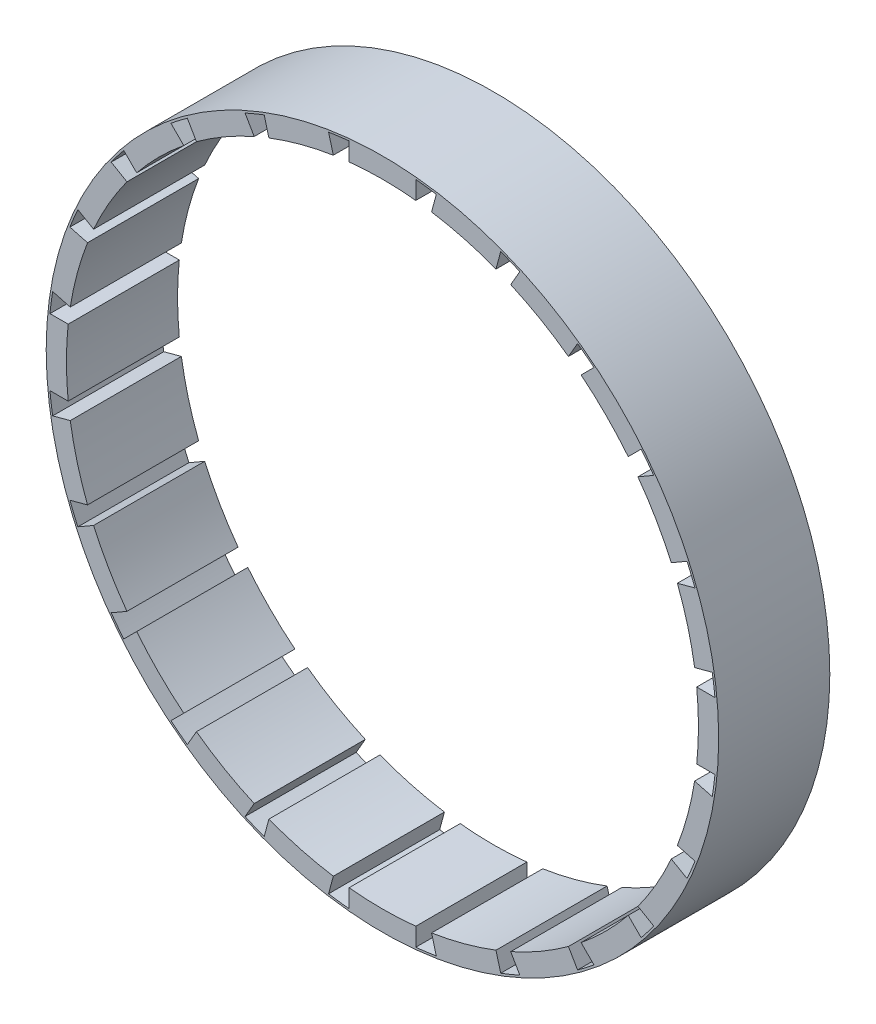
ISO-10303-21;
HEADER;
FILE_DESCRIPTION(('STEP AP214'),'2;1');
FILE_NAME('part.step','',(''),(''),'','','');
FILE_SCHEMA(('AUTOMOTIVE_DESIGN { 1 0 10303 214 1 1 1 1 }'));
ENDSEC;
DATA;
#1=APPLICATION_CONTEXT('core data for automotive mechanical design processes');
#2=APPLICATION_PROTOCOL_DEFINITION('international standard','automotive_design',2000,#1);
#3=PRODUCT_CONTEXT('',#1,'mechanical');
#4=PRODUCT('Part','Part','',(#3));
#5=PRODUCT_RELATED_PRODUCT_CATEGORY('part','',(#4));
#6=PRODUCT_DEFINITION_FORMATION('','',#4);
#7=PRODUCT_DEFINITION_CONTEXT('part definition',#1,'design');
#8=PRODUCT_DEFINITION('design','',#6,#7);
#9=PRODUCT_DEFINITION_SHAPE('','',#8);
#10=(LENGTH_UNIT() NAMED_UNIT(*) SI_UNIT(.MILLI.,.METRE.));
#11=(NAMED_UNIT(*) PLANE_ANGLE_UNIT() SI_UNIT($,.RADIAN.));
#12=(NAMED_UNIT(*) SI_UNIT($,.STERADIAN.) SOLID_ANGLE_UNIT());
#13=UNCERTAINTY_MEASURE_WITH_UNIT(LENGTH_MEASURE(1.E-05),#10,'distance_accuracy_value','');
#14=(GEOMETRIC_REPRESENTATION_CONTEXT(3) GLOBAL_UNCERTAINTY_ASSIGNED_CONTEXT((#13)) GLOBAL_UNIT_ASSIGNED_CONTEXT((#10,
#11,#12)) REPRESENTATION_CONTEXT('',''));
#15=CARTESIAN_POINT('',(0.,0.,0.));
#16=DIRECTION('',(0.,0.,1.));
#17=DIRECTION('',(1.,0.,0.));
#18=AXIS2_PLACEMENT_3D('',#15,#16,#17);
#19=CARTESIAN_POINT('',(0.,0.,-0.635));
#20=DIRECTION('',(0.,0.,-1.));
#21=DIRECTION('',(-1.,0.,0.));
#22=AXIS2_PLACEMENT_3D('',#19,#20,#21);
#23=CYLINDRICAL_SURFACE('',#22,73.025);
#24=CARTESIAN_POINT('',(0.,0.,-0.635));
#25=DIRECTION('',(0.,0.,-1.));
#26=DIRECTION('',(-1.,0.,0.));
#27=AXIS2_PLACEMENT_3D('',#24,#25,#26);
#28=CIRCLE('',#27,73.025);
#29=CARTESIAN_POINT('',(-73.025,0.,-0.635));
#30=VERTEX_POINT('',#29);
#31=EDGE_CURVE('E895',#30,#30,#28,.F.);
#32=ORIENTED_EDGE('',*,*,#31,.F.);
#33=EDGE_LOOP('',(#32));
#34=FACE_BOUND('',#33,.T.);
#35=CARTESIAN_POINT('',(0.,0.,-24.765));
#36=DIRECTION('',(0.,0.,-1.));
#37=DIRECTION('',(-1.,0.,0.));
#38=AXIS2_PLACEMENT_3D('',#35,#36,#37);
#39=CIRCLE('',#38,73.025);
#40=CARTESIAN_POINT('',(-73.025,0.,-24.765));
#41=VERTEX_POINT('',#40);
#42=EDGE_CURVE('E20',#41,#41,#39,.F.);
#43=ORIENTED_EDGE('',*,*,#42,.T.);
#44=EDGE_LOOP('',(#43));
#45=FACE_BOUND('',#44,.T.);
#46=ADVANCED_FACE('F16',(#34,#45),#23,.T.);
#47=CARTESIAN_POINT('',(0.,0.,-24.765));
#48=DIRECTION('',(0.,0.,1.));
#49=DIRECTION('',(0.,-1.,0.));
#50=AXIS2_PLACEMENT_3D('',#47,#48,#49);
#51=CYLINDRICAL_SURFACE('',#50,68.63);
#52=CARTESIAN_POINT('',(0.,0.,-24.765));
#53=DIRECTION('',(0.,0.,1.));
#54=DIRECTION('',(0.,-1.,0.));
#55=AXIS2_PLACEMENT_3D('',#52,#53,#54);
#56=CIRCLE('',#55,68.63);
#57=CARTESIAN_POINT('',(-55.4836756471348,-40.3935469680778,-24.765));
#58=VERTEX_POINT('',#57);
#59=CARTESIAN_POINT('',(-62.7236756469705,-27.8534991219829,-24.765));
#60=VERTEX_POINT('',#59);
#61=EDGE_CURVE('E650',#58,#60,#56,.F.);
#62=ORIENTED_EDGE('',*,*,#61,.T.);
#63=DIRECTION('',(0.,0.,-1.));
#64=VECTOR('',#63,1.);
#65=CARTESIAN_POINT('',(-62.723675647,-27.853499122,-12.7));
#66=LINE('',#65,#64);
#67=CARTESIAN_POINT('',(-62.7236756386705,-27.8534991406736,-0.635));
#68=VERTEX_POINT('',#67);
#69=EDGE_CURVE('E1083',#68,#60,#66,.T.);
#70=ORIENTED_EDGE('',*,*,#69,.F.);
#71=CARTESIAN_POINT('',(0.,0.,-0.635));
#72=DIRECTION('',(0.,0.,1.));
#73=DIRECTION('',(0.,-1.,0.));
#74=AXIS2_PLACEMENT_3D('',#71,#72,#73);
#75=CIRCLE('',#74,68.63);
#76=CARTESIAN_POINT('',(-55.4836756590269,-40.393546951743,-0.635000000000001));
#77=VERTEX_POINT('',#76);
#78=EDGE_CURVE('E898',#77,#68,#75,.F.);
#79=ORIENTED_EDGE('',*,*,#78,.F.);
#80=DIRECTION('',(0.,0.,-1.));
#81=VECTOR('',#80,1.);
#82=CARTESIAN_POINT('',(-55.483675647,-40.393546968,-12.7));
#83=LINE('',#82,#81);
#84=EDGE_CURVE('E1205',#77,#58,#83,.T.);
#85=ORIENTED_EDGE('',*,*,#84,.T.);
#86=EDGE_LOOP('',(#62,#70,#79,#85));
#87=FACE_BOUND('',#86,.T.);
#88=ADVANCED_FACE('F1734',(#87),#51,.F.);
#89=CARTESIAN_POINT('',(-62.723675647,-27.853499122,-24.765));
#90=DIRECTION('',(-0.499999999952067,0.866025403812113,0.));
#91=DIRECTION('',(-0.866025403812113,-0.499999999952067,0.));
#92=AXIS2_PLACEMENT_3D('',#89,#90,#91);
#93=PLANE('',#92);
#94=DIRECTION('',(0.,0.,1.));
#95=VECTOR('',#94,1.);
#96=CARTESIAN_POINT('',(-66.1519998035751,-29.8328429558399,-12.7));
#97=LINE('',#96,#95);
#98=CARTESIAN_POINT('',(-66.1519997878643,-29.8328429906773,-0.635));
#99=VERTEX_POINT('',#98);
#100=CARTESIAN_POINT('',(-66.151999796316,-29.8328429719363,-24.765));
#101=VERTEX_POINT('',#100);
#102=EDGE_CURVE('E1085',#99,#101,#97,.F.);
#103=ORIENTED_EDGE('',*,*,#102,.F.);
#104=DIRECTION('',(-0.866025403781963,-0.500000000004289,0.));
#105=VECTOR('',#104,1.);
#106=CARTESIAN_POINT('',(-62.7236756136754,-27.8534991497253,-0.635));
#107=LINE('',#106,#105);
#108=EDGE_CURVE('E900',#68,#99,#107,.T.);
#109=ORIENTED_EDGE('',*,*,#108,.F.);
#110=ORIENTED_EDGE('',*,*,#69,.T.);
#111=DIRECTION('',(-0.866025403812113,-0.499999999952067,0.));
#112=VECTOR('',#111,1.);
#113=CARTESIAN_POINT('',(-62.723675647,-27.853499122,-24.765));
#114=LINE('',#113,#112);
#115=EDGE_CURVE('E653',#60,#101,#114,.T.);
#116=ORIENTED_EDGE('',*,*,#115,.T.);
#117=EDGE_LOOP('',(#103,#109,#110,#116));
#118=FACE_BOUND('',#117,.T.);
#119=ADVANCED_FACE('F1729',(#118),#93,.T.);
#120=CARTESIAN_POINT('',(0.,0.,-0.635));
#121=DIRECTION('',(0.,0.,-1.));
#122=DIRECTION('',(-1.,0.,0.));
#123=AXIS2_PLACEMENT_3D('',#120,#121,#122);
#124=CYLINDRICAL_SURFACE('',#123,72.5678);
#125=DIRECTION('',(0.,0.,1.));
#126=VECTOR('',#125,1.);
#127=CARTESIAN_POINT('',(-67.871533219,-25.681522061,-12.7));
#128=LINE('',#127,#126);
#129=CARTESIAN_POINT('',(-67.8715332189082,-25.6815220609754,-24.765));
#130=VERTEX_POINT('',#129);
#131=CARTESIAN_POINT('',(-67.8715332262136,-25.6815220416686,-0.635));
#132=VERTEX_POINT('',#131);
#133=EDGE_CURVE('E1087',#130,#132,#128,.T.);
#134=ORIENTED_EDGE('',*,*,#133,.T.);
#135=CARTESIAN_POINT('',(0.,0.,-0.635));
#136=DIRECTION('',(0.,0.,-1.));
#137=DIRECTION('',(-1.,0.,0.));
#138=AXIS2_PLACEMENT_3D('',#135,#136,#137);
#139=CIRCLE('',#138,72.5678);
#140=EDGE_CURVE('E902',#99,#132,#139,.T.);
#141=ORIENTED_EDGE('',*,*,#140,.F.);
#142=ORIENTED_EDGE('',*,*,#102,.T.);
#143=CARTESIAN_POINT('',(0.,0.,-24.765));
#144=DIRECTION('',(0.,0.,-1.));
#145=DIRECTION('',(-1.,0.,0.));
#146=AXIS2_PLACEMENT_3D('',#143,#144,#145);
#147=CIRCLE('',#146,72.5678);
#148=EDGE_CURVE('E656',#101,#130,#147,.T.);
#149=ORIENTED_EDGE('',*,*,#148,.T.);
#150=EDGE_LOOP('',(#134,#141,#142,#149));
#151=FACE_BOUND('',#150,.T.);
#152=ADVANCED_FACE('F1724',(#151),#124,.F.);
#153=CARTESIAN_POINT('',(-67.871533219,-25.681522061,-0.635));
#154=DIRECTION('',(-0.2588190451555,0.965925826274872,0.));
#155=DIRECTION('',(0.965925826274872,0.2588190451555,0.));
#156=AXIS2_PLACEMENT_3D('',#153,#154,#155);
#157=PLANE('',#156);
#158=DIRECTION('',(0.965925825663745,0.258819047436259,0.));
#159=VECTOR('',#158,1.);
#160=CARTESIAN_POINT('',(-67.871533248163,-25.6815220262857,-0.635));
#161=LINE('',#160,#159);
#162=CARTESIAN_POINT('',(-64.0477345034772,-24.656938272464,-0.635));
#163=VERTEX_POINT('',#162);
#164=EDGE_CURVE('E904',#132,#163,#161,.T.);
#165=ORIENTED_EDGE('',*,*,#164,.F.);
#166=ORIENTED_EDGE('',*,*,#133,.F.);
#167=DIRECTION('',(0.965925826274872,0.2588190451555,0.));
#168=VECTOR('',#167,1.);
#169=CARTESIAN_POINT('',(-67.871533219,-25.681522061,-24.765));
#170=LINE('',#169,#168);
#171=CARTESIAN_POINT('',(-64.0477344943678,-24.6569382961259,-24.765));
#172=VERTEX_POINT('',#171);
#173=EDGE_CURVE('E659',#130,#172,#170,.T.);
#174=ORIENTED_EDGE('',*,*,#173,.T.);
#175=DIRECTION('',(0.,0.,1.));
#176=VECTOR('',#175,1.);
#177=CARTESIAN_POINT('',(-64.0477344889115,-24.656938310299,-12.7));
#178=LINE('',#177,#176);
#179=EDGE_CURVE('E1090',#163,#172,#178,.F.);
#180=ORIENTED_EDGE('',*,*,#179,.F.);
#181=EDGE_LOOP('',(#165,#166,#174,#180));
#182=FACE_BOUND('',#181,.T.);
#183=ADVANCED_FACE('F1721',(#182),#157,.F.);
#184=CARTESIAN_POINT('',(0.,0.,-24.765));
#185=DIRECTION('',(0.,0.,1.));
#186=DIRECTION('',(0.,-1.,0.));
#187=AXIS2_PLACEMENT_3D('',#184,#185,#186);
#188=CYLINDRICAL_SURFACE('',#187,68.63);
#189=CARTESIAN_POINT('',(0.,0.,-24.765));
#190=DIRECTION('',(0.,0.,1.));
#191=DIRECTION('',(0.,-1.,0.));
#192=AXIS2_PLACEMENT_3D('',#189,#190,#191);
#193=CIRCLE('',#192,68.63);
#194=CARTESIAN_POINT('',(-67.7954342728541,-10.6703323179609,-24.765));
#195=VERTEX_POINT('',#194);
#196=EDGE_CURVE('E662',#172,#195,#193,.F.);
#197=ORIENTED_EDGE('',*,*,#196,.T.);
#198=DIRECTION('',(0.,0.,-1.));
#199=VECTOR('',#198,1.);
#200=CARTESIAN_POINT('',(-67.795434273,-10.670332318,-12.7));
#201=LINE('',#200,#199);
#202=CARTESIAN_POINT('',(-67.7954342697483,-10.6703323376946,-0.635));
#203=VERTEX_POINT('',#202);
#204=EDGE_CURVE('E1092',#203,#195,#201,.T.);
#205=ORIENTED_EDGE('',*,*,#204,.F.);
#206=CARTESIAN_POINT('',(0.,0.,-0.635));
#207=DIRECTION('',(0.,0.,1.));
#208=DIRECTION('',(0.,-1.,0.));
#209=AXIS2_PLACEMENT_3D('',#206,#207,#208);
#210=CIRCLE('',#209,68.63);
#211=EDGE_CURVE('E906',#163,#203,#210,.F.);
#212=ORIENTED_EDGE('',*,*,#211,.F.);
#213=ORIENTED_EDGE('',*,*,#179,.T.);
#214=EDGE_LOOP('',(#197,#205,#212,#213));
#215=FACE_BOUND('',#214,.T.);
#216=ADVANCED_FACE('F1715',(#215),#188,.F.);
#217=CARTESIAN_POINT('',(-67.795434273,-10.670332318,-24.765));
#218=DIRECTION('',(-0.2588190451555,0.965925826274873,0.));
#219=DIRECTION('',(-0.965925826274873,-0.2588190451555,0.));
#220=AXIS2_PLACEMENT_3D('',#217,#218,#219);
#221=PLANE('',#220);
#222=DIRECTION('',(0.,0.,1.));
#223=VECTOR('',#222,1.);
#224=CARTESIAN_POINT('',(-71.6192329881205,-11.6949161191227,-12.7));
#225=LINE('',#224,#223);
#226=CARTESIAN_POINT('',(-71.6192329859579,-11.6949161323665,-0.635));
#227=VERTEX_POINT('',#226);
#228=CARTESIAN_POINT('',(-71.6192329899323,-11.6949161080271,-24.765));
#229=VERTEX_POINT('',#228);
#230=EDGE_CURVE('E1094',#227,#229,#225,.F.);
#231=ORIENTED_EDGE('',*,*,#230,.F.);
#232=DIRECTION('',(-0.965925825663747,-0.258819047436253,0.));
#233=VECTOR('',#232,1.);
#234=CARTESIAN_POINT('',(-67.795434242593,-10.6703323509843,-0.635));
#235=LINE('',#234,#233);
#236=EDGE_CURVE('E908',#203,#227,#235,.T.);
#237=ORIENTED_EDGE('',*,*,#236,.F.);
#238=ORIENTED_EDGE('',*,*,#204,.T.);
#239=DIRECTION('',(-0.965925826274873,-0.2588190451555,0.));
#240=VECTOR('',#239,1.);
#241=CARTESIAN_POINT('',(-67.795434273,-10.670332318,-24.765));
#242=LINE('',#241,#240);
#243=EDGE_CURVE('E665',#195,#229,#242,.T.);
#244=ORIENTED_EDGE('',*,*,#243,.T.);
#245=EDGE_LOOP('',(#231,#237,#238,#244));
#246=FACE_BOUND('',#245,.T.);
#247=ADVANCED_FACE('F1710',(#246),#221,.T.);
#248=CARTESIAN_POINT('',(0.,0.,-0.635));
#249=DIRECTION('',(0.,0.,-1.));
#250=DIRECTION('',(-1.,0.,0.));
#251=AXIS2_PLACEMENT_3D('',#248,#249,#250);
#252=CYLINDRICAL_SURFACE('',#251,72.5678);
#253=ORIENTED_EDGE('',*,*,#230,.T.);
#254=CARTESIAN_POINT('',(0.,0.,-24.765));
#255=DIRECTION('',(0.,0.,-1.));
#256=DIRECTION('',(-1.,0.,0.));
#257=AXIS2_PLACEMENT_3D('',#254,#255,#256);
#258=CIRCLE('',#257,72.5678);
#259=CARTESIAN_POINT('',(-72.2057338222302,-7.24,-24.765));
#260=VERTEX_POINT('',#259);
#261=EDGE_CURVE('E668',#229,#260,#258,.T.);
#262=ORIENTED_EDGE('',*,*,#261,.T.);
#263=DIRECTION('',(0.,0.,1.));
#264=VECTOR('',#263,1.);
#265=CARTESIAN_POINT('',(-72.205733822,-7.24,-12.7));
#266=LINE('',#265,#264);
#267=CARTESIAN_POINT('',(-72.2057338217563,-7.24000000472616,-0.635));
#268=VERTEX_POINT('',#267);
#269=EDGE_CURVE('E1096',#260,#268,#266,.T.);
#270=ORIENTED_EDGE('',*,*,#269,.T.);
#271=CARTESIAN_POINT('',(0.,0.,-0.635));
#272=DIRECTION('',(0.,0.,-1.));
#273=DIRECTION('',(-1.,0.,0.));
#274=AXIS2_PLACEMENT_3D('',#271,#272,#273);
#275=CIRCLE('',#274,72.5678);
#276=EDGE_CURVE('E910',#227,#268,#275,.T.);
#277=ORIENTED_EDGE('',*,*,#276,.F.);
#278=EDGE_LOOP('',(#253,#262,#270,#277));
#279=FACE_BOUND('',#278,.T.);
#280=ADVANCED_FACE('F1705',(#279),#252,.F.);
#281=CARTESIAN_POINT('',(-72.205733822,-7.24,-0.635));
#282=DIRECTION('',(0.,1.,0.));
#283=DIRECTION('',(1.,0.,0.));
#284=AXIS2_PLACEMENT_3D('',#281,#282,#283);
#285=PLANE('',#284);
#286=DIRECTION('',(1.,-9.73950499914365E-09,0.));
#287=VECTOR('',#286,1.);
#288=CARTESIAN_POINT('',(-72.2057337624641,-7.24000000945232,-0.635));
#289=LINE('',#288,#287);
#290=CARTESIAN_POINT('',(-68.2470460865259,-7.2400000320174,-0.635));
#291=VERTEX_POINT('',#290);
#292=EDGE_CURVE('E912',#268,#291,#289,.T.);
#293=ORIENTED_EDGE('',*,*,#292,.F.);
#294=ORIENTED_EDGE('',*,*,#269,.F.);
#295=DIRECTION('',(1.,0.,0.));
#296=VECTOR('',#295,1.);
#297=CARTESIAN_POINT('',(-72.205733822,-7.24,-24.765));
#298=LINE('',#297,#296);
#299=CARTESIAN_POINT('',(-68.2470460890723,-7.24000000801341,-24.765));
#300=VERTEX_POINT('',#299);
#301=EDGE_CURVE('E671',#260,#300,#298,.T.);
#302=ORIENTED_EDGE('',*,*,#301,.T.);
#303=DIRECTION('',(0.,0.,1.));
#304=VECTOR('',#303,1.);
#305=CARTESIAN_POINT('',(-68.2470460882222,-7.24000001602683,-12.7));
#306=LINE('',#305,#304);
#307=EDGE_CURVE('E1099',#291,#300,#306,.F.);
#308=ORIENTED_EDGE('',*,*,#307,.F.);
#309=EDGE_LOOP('',(#293,#294,#302,#308));
#310=FACE_BOUND('',#309,.T.);
#311=ADVANCED_FACE('F1702',(#310),#285,.F.);
#312=CARTESIAN_POINT('',(0.,0.,-24.765));
#313=DIRECTION('',(0.,0.,1.));
#314=DIRECTION('',(0.,-1.,0.));
#315=AXIS2_PLACEMENT_3D('',#312,#313,#314);
#316=CYLINDRICAL_SURFACE('',#315,68.63);
#317=CARTESIAN_POINT('',(0.,0.,-24.765));
#318=DIRECTION('',(0.,0.,1.));
#319=DIRECTION('',(0.,-1.,0.));
#320=AXIS2_PLACEMENT_3D('',#317,#318,#319);
#321=CIRCLE('',#320,68.63);
#322=CARTESIAN_POINT('',(-68.2470460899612,7.24,-24.765));
#323=VERTEX_POINT('',#322);
#324=EDGE_CURVE('E674',#300,#323,#321,.F.);
#325=ORIENTED_EDGE('',*,*,#324,.T.);
#326=DIRECTION('',(0.,0.,-1.));
#327=VECTOR('',#326,1.);
#328=CARTESIAN_POINT('',(-68.24704609,7.24,-12.7));
#329=LINE('',#328,#327);
#330=CARTESIAN_POINT('',(-68.2470460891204,7.24000000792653,-0.635));
#331=VERTEX_POINT('',#330);
#332=EDGE_CURVE('E1101',#331,#323,#329,.T.);
#333=ORIENTED_EDGE('',*,*,#332,.F.);
#334=CARTESIAN_POINT('',(0.,0.,-0.635));
#335=DIRECTION('',(0.,0.,1.));
#336=DIRECTION('',(0.,-1.,0.));
#337=AXIS2_PLACEMENT_3D('',#334,#335,#336);
#338=CIRCLE('',#337,68.63);
#339=EDGE_CURVE('E914',#291,#331,#338,.F.);
#340=ORIENTED_EDGE('',*,*,#339,.F.);
#341=ORIENTED_EDGE('',*,*,#307,.T.);
#342=EDGE_LOOP('',(#325,#333,#340,#341));
#343=FACE_BOUND('',#342,.T.);
#344=ADVANCED_FACE('F1696',(#343),#316,.F.);
#345=CARTESIAN_POINT('',(-68.24704609,7.24,-24.765));
#346=DIRECTION('',(0.,1.,0.));
#347=DIRECTION('',(-1.,0.,0.));
#348=AXIS2_PLACEMENT_3D('',#345,#346,#347);
#349=PLANE('',#348);
#350=DIRECTION('',(0.,0.,1.));
#351=VECTOR('',#350,1.);
#352=CARTESIAN_POINT('',(-72.2057338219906,7.24000000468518,-12.7));
#353=LINE('',#352,#351);
#354=CARTESIAN_POINT('',(-72.2057338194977,7.24000002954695,-0.635));
#355=VERTEX_POINT('',#354);
#356=CARTESIAN_POINT('',(-72.2057338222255,7.24000000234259,-24.765));
#357=VERTEX_POINT('',#356);
#358=EDGE_CURVE('E1103',#355,#357,#353,.F.);
#359=ORIENTED_EDGE('',*,*,#358,.F.);
#360=DIRECTION('',(-1.,9.73950149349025E-09,0.));
#361=VECTOR('',#360,1.);
#362=CARTESIAN_POINT('',(-68.2470461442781,7.24000001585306,-0.635));
#363=LINE('',#362,#361);
#364=EDGE_CURVE('E916',#331,#355,#363,.T.);
#365=ORIENTED_EDGE('',*,*,#364,.F.);
#366=ORIENTED_EDGE('',*,*,#332,.T.);
#367=DIRECTION('',(-1.,0.,0.));
#368=VECTOR('',#367,1.);
#369=CARTESIAN_POINT('',(-68.24704609,7.24,-24.765));
#370=LINE('',#369,#368);
#371=EDGE_CURVE('E677',#323,#357,#370,.T.);
#372=ORIENTED_EDGE('',*,*,#371,.T.);
#373=EDGE_LOOP('',(#359,#365,#366,#372));
#374=FACE_BOUND('',#373,.T.);
#375=ADVANCED_FACE('F1691',(#374),#349,.T.);
#376=CARTESIAN_POINT('',(0.,0.,-0.635));
#377=DIRECTION('',(0.,0.,-1.));
#378=DIRECTION('',(-1.,0.,0.));
#379=AXIS2_PLACEMENT_3D('',#376,#377,#378);
#380=CYLINDRICAL_SURFACE('',#379,72.5678);
#381=DIRECTION('',(0.,0.,1.));
#382=VECTOR('',#381,1.);
#383=CARTESIAN_POINT('',(-71.619232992,11.694916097,-12.7));
#384=LINE('',#383,#382);
#385=CARTESIAN_POINT('',(-71.6192329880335,11.6949161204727,-24.765));
#386=VERTEX_POINT('',#385);
#387=CARTESIAN_POINT('',(-71.6192329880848,11.6949161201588,-0.635));
#388=VERTEX_POINT('',#387);
#389=EDGE_CURVE('E1105',#386,#388,#384,.T.);
#390=ORIENTED_EDGE('',*,*,#389,.T.);
#391=CARTESIAN_POINT('',(0.,0.,-0.635));
#392=DIRECTION('',(0.,0.,-1.));
#393=DIRECTION('',(-1.,0.,0.));
#394=AXIS2_PLACEMENT_3D('',#391,#392,#393);
#395=CIRCLE('',#394,72.5678);
#396=EDGE_CURVE('E918',#355,#388,#395,.T.);
#397=ORIENTED_EDGE('',*,*,#396,.F.);
#398=ORIENTED_EDGE('',*,*,#358,.T.);
#399=CARTESIAN_POINT('',(0.,0.,-24.765));
#400=DIRECTION('',(0.,0.,-1.));
#401=DIRECTION('',(-1.,0.,0.));
#402=AXIS2_PLACEMENT_3D('',#399,#400,#401);
#403=CIRCLE('',#402,72.5678);
#404=EDGE_CURVE('E680',#357,#386,#403,.T.);
#405=ORIENTED_EDGE('',*,*,#404,.T.);
#406=EDGE_LOOP('',(#390,#397,#398,#405));
#407=FACE_BOUND('',#406,.T.);
#408=ADVANCED_FACE('F1686',(#407),#380,.F.);
#409=CARTESIAN_POINT('',(-71.619232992,11.694916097,-0.635));
#410=DIRECTION('',(0.2588190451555,0.965925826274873,0.));
#411=DIRECTION('',(0.965925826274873,-0.2588190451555,0.));
#412=AXIS2_PLACEMENT_3D('',#409,#410,#411);
#413=PLANE('',#412);
#414=DIRECTION('',(0.96592582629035,-0.258819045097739,0.));
#415=VECTOR('',#414,1.);
#416=CARTESIAN_POINT('',(-1.87384987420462,-6.99330293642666,-0.635));
#417=LINE('',#416,#415);
#418=CARTESIAN_POINT('',(-67.7954342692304,10.6703323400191,-0.635));
#419=VERTEX_POINT('',#418);
#420=EDGE_CURVE('E920',#388,#419,#417,.T.);
#421=ORIENTED_EDGE('',*,*,#420,.F.);
#422=ORIENTED_EDGE('',*,*,#389,.F.);
#423=DIRECTION('',(0.965925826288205,-0.258819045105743,0.));
#424=VECTOR('',#423,1.);
#425=CARTESIAN_POINT('',(-1.8738498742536,-6.99330293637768,-24.765));
#426=LINE('',#425,#424);
#427=CARTESIAN_POINT('',(-67.7954342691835,10.6703323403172,-24.765));
#428=VERTEX_POINT('',#427);
#429=EDGE_CURVE('E683',#386,#428,#426,.T.);
#430=ORIENTED_EDGE('',*,*,#429,.T.);
#431=DIRECTION('',(0.,0.,1.));
#432=VECTOR('',#431,1.);
#433=CARTESIAN_POINT('',(-67.7954342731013,10.6703323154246,-12.7));
#434=LINE('',#433,#432);
#435=EDGE_CURVE('E1108',#419,#428,#434,.F.);
#436=ORIENTED_EDGE('',*,*,#435,.F.);
#437=EDGE_LOOP('',(#421,#422,#430,#436));
#438=FACE_BOUND('',#437,.T.);
#439=ADVANCED_FACE('F1683',(#438),#413,.F.);
#440=CARTESIAN_POINT('',(0.,0.,-24.765));
#441=DIRECTION('',(0.,0.,1.));
#442=DIRECTION('',(0.,-1.,0.));
#443=AXIS2_PLACEMENT_3D('',#440,#441,#442);
#444=CYLINDRICAL_SURFACE('',#443,68.63);
#445=CARTESIAN_POINT('',(0.,0.,-24.765));
#446=DIRECTION('',(0.,0.,1.));
#447=DIRECTION('',(0.,-1.,0.));
#448=AXIS2_PLACEMENT_3D('',#445,#446,#447);
#449=CIRCLE('',#448,68.63);
#450=CARTESIAN_POINT('',(-64.0477345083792,24.6569382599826,-24.765));
#451=VERTEX_POINT('',#450);
#452=EDGE_CURVE('E684',#428,#451,#449,.F.);
#453=ORIENTED_EDGE('',*,*,#452,.T.);
#454=DIRECTION('',(0.,0.,-1.));
#455=VECTOR('',#454,1.);
#456=CARTESIAN_POINT('',(-64.0477345,24.656938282,-12.7));
#457=LINE('',#456,#455);
#458=CARTESIAN_POINT('',(-64.0477345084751,24.6569382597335,-0.635));
#459=VERTEX_POINT('',#458);
#460=EDGE_CURVE('E1110',#459,#451,#457,.T.);
#461=ORIENTED_EDGE('',*,*,#460,.F.);
#462=CARTESIAN_POINT('',(0.,0.,-0.635));
#463=DIRECTION('',(0.,0.,1.));
#464=DIRECTION('',(0.,-1.,0.));
#465=AXIS2_PLACEMENT_3D('',#462,#463,#464);
#466=CIRCLE('',#465,68.63);
#467=EDGE_CURVE('E921',#419,#459,#466,.F.);
#468=ORIENTED_EDGE('',*,*,#467,.F.);
#469=ORIENTED_EDGE('',*,*,#435,.T.);
#470=EDGE_LOOP('',(#453,#461,#468,#469));
#471=FACE_BOUND('',#470,.T.);
#472=ADVANCED_FACE('F1677',(#471),#444,.F.);
#473=CARTESIAN_POINT('',(-64.0477345,24.656938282,-24.765));
#474=DIRECTION('',(0.2588190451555,0.965925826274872,0.));
#475=DIRECTION('',(-0.965925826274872,0.2588190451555,0.));
#476=AXIS2_PLACEMENT_3D('',#473,#474,#475);
#477=PLANE('',#476);
#478=DIRECTION('',(0.,0.,1.));
#479=VECTOR('',#478,1.);
#480=CARTESIAN_POINT('',(-67.8715332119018,25.6815220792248,-12.7));
#481=LINE('',#480,#479);
#482=CARTESIAN_POINT('',(-67.8715332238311,25.6815220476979,-0.635));
#483=VERTEX_POINT('',#482);
#484=CARTESIAN_POINT('',(-67.8715332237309,25.6815220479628,-24.765));
#485=VERTEX_POINT('',#484);
#486=EDGE_CURVE('E1112',#483,#485,#481,.F.);
#487=ORIENTED_EDGE('',*,*,#486,.F.);
#488=DIRECTION('',(-0.96592582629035,0.258819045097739,0.));
#489=VECTOR('',#488,1.);
#490=CARTESIAN_POINT('',(1.87384987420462,6.99330293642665,-0.635));
#491=LINE('',#490,#489);
#492=EDGE_CURVE('E923',#459,#483,#491,.T.);
#493=ORIENTED_EDGE('',*,*,#492,.F.);
#494=ORIENTED_EDGE('',*,*,#460,.T.);
#495=DIRECTION('',(-0.965925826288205,0.258819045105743,0.));
#496=VECTOR('',#495,1.);
#497=CARTESIAN_POINT('',(1.8738498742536,6.99330293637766,-24.765));
#498=LINE('',#497,#496);
#499=EDGE_CURVE('E687',#451,#485,#498,.T.);
#500=ORIENTED_EDGE('',*,*,#499,.T.);
#501=EDGE_LOOP('',(#487,#493,#494,#500));
#502=FACE_BOUND('',#501,.T.);
#503=ADVANCED_FACE('F1672',(#502),#477,.T.);
#504=CARTESIAN_POINT('',(0.,0.,-0.635));
#505=DIRECTION('',(0.,0.,-1.));
#506=DIRECTION('',(-1.,0.,0.));
#507=AXIS2_PLACEMENT_3D('',#504,#505,#506);
#508=CYLINDRICAL_SURFACE('',#507,72.5678);
#509=ORIENTED_EDGE('',*,*,#486,.T.);
#510=CARTESIAN_POINT('',(0.,0.,-24.765));
#511=DIRECTION('',(0.,0.,-1.));
#512=DIRECTION('',(-1.,0.,0.));
#513=AXIS2_PLACEMENT_3D('',#510,#511,#512);
#514=CIRCLE('',#513,72.5678);
#515=CARTESIAN_POINT('',(-66.1519997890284,29.8328429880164,-24.765));
#516=VERTEX_POINT('',#515);
#517=EDGE_CURVE('E688',#485,#516,#514,.T.);
#518=ORIENTED_EDGE('',*,*,#517,.T.);
#519=DIRECTION('',(0.,0.,1.));
#520=VECTOR('',#519,1.);
#521=CARTESIAN_POINT('',(-66.151999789,29.832842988,-12.7));
#522=LINE('',#521,#520);
#523=CARTESIAN_POINT('',(-66.1519998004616,29.8328429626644,-0.635));
#524=VERTEX_POINT('',#523);
#525=EDGE_CURVE('E1114',#516,#524,#522,.T.);
#526=ORIENTED_EDGE('',*,*,#525,.T.);
#527=CARTESIAN_POINT('',(0.,0.,-0.635));
#528=DIRECTION('',(0.,0.,-1.));
#529=DIRECTION('',(-1.,0.,0.));
#530=AXIS2_PLACEMENT_3D('',#527,#528,#529);
#531=CIRCLE('',#530,72.5678);
#532=EDGE_CURVE('E924',#483,#524,#531,.T.);
#533=ORIENTED_EDGE('',*,*,#532,.F.);
#534=EDGE_LOOP('',(#509,#518,#526,#533));
#535=FACE_BOUND('',#534,.T.);
#536=ADVANCED_FACE('F1667',(#535),#508,.F.);
#537=CARTESIAN_POINT('',(-66.151999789,29.832842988,-0.635));
#538=DIRECTION('',(0.499999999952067,0.866025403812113,0.));
#539=DIRECTION('',(0.866025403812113,-0.499999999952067,0.));
#540=AXIS2_PLACEMENT_3D('',#537,#538,#539);
#541=PLANE('',#540);
#542=DIRECTION('',(0.86602540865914,-0.49999999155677,0.));
#543=VECTOR('',#542,1.);
#544=CARTESIAN_POINT('',(-66.1519998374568,29.8328429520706,-0.635));
#545=LINE('',#544,#543);
#546=CARTESIAN_POINT('',(-62.7236756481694,27.8534991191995,-0.635));
#547=VERTEX_POINT('',#546);
#548=EDGE_CURVE('E926',#524,#547,#545,.T.);
#549=ORIENTED_EDGE('',*,*,#548,.F.);
#550=ORIENTED_EDGE('',*,*,#525,.F.);
#551=DIRECTION('',(0.866025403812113,-0.499999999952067,0.));
#552=VECTOR('',#551,1.);
#553=CARTESIAN_POINT('',(-66.151999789,29.832842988,-24.765));
#554=LINE('',#553,#552);
#555=CARTESIAN_POINT('',(-62.7236756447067,27.8534991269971,-24.765));
#556=VERTEX_POINT('',#555);
#557=EDGE_CURVE('E691',#516,#556,#554,.T.);
#558=ORIENTED_EDGE('',*,*,#557,.T.);
#559=DIRECTION('',(0.,0.,1.));
#560=VECTOR('',#559,1.);
#561=CARTESIAN_POINT('',(-62.7236756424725,27.8534991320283,-12.7));
#562=LINE('',#561,#560);
#563=EDGE_CURVE('E1117',#547,#556,#562,.F.);
#564=ORIENTED_EDGE('',*,*,#563,.F.);
#565=EDGE_LOOP('',(#549,#550,#558,#564));
#566=FACE_BOUND('',#565,.T.);
#567=ADVANCED_FACE('F1664',(#566),#541,.F.);
#568=CARTESIAN_POINT('',(0.,0.,-24.765));
#569=DIRECTION('',(0.,0.,1.));
#570=DIRECTION('',(0.,-1.,0.));
#571=AXIS2_PLACEMENT_3D('',#568,#569,#570);
#572=CYLINDRICAL_SURFACE('',#571,68.63);
#573=CARTESIAN_POINT('',(0.,0.,-24.765));
#574=DIRECTION('',(0.,0.,1.));
#575=DIRECTION('',(0.,-1.,0.));
#576=AXIS2_PLACEMENT_3D('',#573,#574,#575);
#577=CIRCLE('',#576,68.63);
#578=CARTESIAN_POINT('',(-55.4836756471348,40.3935469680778,-24.765));
#579=VERTEX_POINT('',#578);
#580=EDGE_CURVE('E694',#556,#579,#577,.F.);
#581=ORIENTED_EDGE('',*,*,#580,.T.);
#582=DIRECTION('',(0.,0.,-1.));
#583=VECTOR('',#582,1.);
#584=CARTESIAN_POINT('',(-55.483675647,40.393546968,-12.7));
#585=LINE('',#584,#583);
#586=CARTESIAN_POINT('',(-55.4836756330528,40.3935469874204,-0.634999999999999));
#587=VERTEX_POINT('',#586);
#588=EDGE_CURVE('E1119',#587,#579,#585,.T.);
#589=ORIENTED_EDGE('',*,*,#588,.F.);
#590=CARTESIAN_POINT('',(0.,0.,-0.635));
#591=DIRECTION('',(0.,0.,1.));
#592=DIRECTION('',(0.,-1.,0.));
#593=AXIS2_PLACEMENT_3D('',#590,#591,#592);
#594=CIRCLE('',#593,68.63);
#595=EDGE_CURVE('E928',#547,#587,#594,.F.);
#596=ORIENTED_EDGE('',*,*,#595,.F.);
#597=ORIENTED_EDGE('',*,*,#563,.T.);
#598=EDGE_LOOP('',(#581,#589,#596,#597));
#599=FACE_BOUND('',#598,.T.);
#600=ADVANCED_FACE('F1658',(#599),#572,.F.);
#601=CARTESIAN_POINT('',(-55.483675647,40.393546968,-24.765));
#602=DIRECTION('',(0.500000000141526,0.866025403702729,0.));
#603=DIRECTION('',(-0.866025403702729,0.500000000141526,0.));
#604=AXIS2_PLACEMENT_3D('',#601,#602,#603);
#605=PLANE('',#604);
#606=DIRECTION('',(0.,0.,1.));
#607=VECTOR('',#606,1.);
#608=CARTESIAN_POINT('',(-58.9119997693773,42.3728908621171,-12.7));
#609=LINE('',#608,#607);
#610=CARTESIAN_POINT('',(-58.9119997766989,42.3728908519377,-0.635));
#611=VERTEX_POINT('',#610);
#612=CARTESIAN_POINT('',(-58.9119997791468,42.3728908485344,-24.765));
#613=VERTEX_POINT('',#612);
#614=EDGE_CURVE('E1121',#611,#613,#609,.F.);
#615=ORIENTED_EDGE('',*,*,#614,.F.);
#616=DIRECTION('',(-0.866025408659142,0.499999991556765,0.));
#617=VECTOR('',#616,1.);
#618=CARTESIAN_POINT('',(-55.4836755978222,40.3935469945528,-0.635));
#619=LINE('',#618,#617);
#620=EDGE_CURVE('E930',#587,#611,#619,.T.);
#621=ORIENTED_EDGE('',*,*,#620,.F.);
#622=ORIENTED_EDGE('',*,*,#588,.T.);
#623=DIRECTION('',(-0.866025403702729,0.500000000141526,0.));
#624=VECTOR('',#623,1.);
#625=CARTESIAN_POINT('',(-55.483675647,40.393546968,-24.765));
#626=LINE('',#625,#624);
#627=EDGE_CURVE('E697',#579,#613,#626,.T.);
#628=ORIENTED_EDGE('',*,*,#627,.T.);
#629=EDGE_LOOP('',(#615,#621,#622,#628));
#630=FACE_BOUND('',#629,.T.);
#631=ADVANCED_FACE('F1653',(#630),#605,.T.);
#632=CARTESIAN_POINT('',(0.,0.,-0.635));
#633=DIRECTION('',(0.,0.,-1.));
#634=DIRECTION('',(-1.,0.,0.));
#635=AXIS2_PLACEMENT_3D('',#632,#633,#634);
#636=CYLINDRICAL_SURFACE('',#635,72.5678);
#637=DIRECTION('',(0.,0.,1.));
#638=VECTOR('',#637,1.);
#639=CARTESIAN_POINT('',(-56.176617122,45.937710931,-12.7));
#640=LINE('',#639,#638);
#641=CARTESIAN_POINT('',(-56.1766171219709,45.9377109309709,-24.765));
#642=VERTEX_POINT('',#641);
#643=CARTESIAN_POINT('',(-56.1766171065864,45.9377109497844,-0.635));
#644=VERTEX_POINT('',#643);
#645=EDGE_CURVE('E1123',#642,#644,#640,.T.);
#646=ORIENTED_EDGE('',*,*,#645,.T.);
#647=CARTESIAN_POINT('',(0.,0.,-0.635));
#648=DIRECTION('',(0.,0.,-1.));
#649=DIRECTION('',(-1.,0.,0.));
#650=AXIS2_PLACEMENT_3D('',#647,#648,#649);
#651=CIRCLE('',#650,72.5678);
#652=EDGE_CURVE('E932',#611,#644,#651,.T.);
#653=ORIENTED_EDGE('',*,*,#652,.F.);
#654=ORIENTED_EDGE('',*,*,#614,.T.);
#655=CARTESIAN_POINT('',(0.,0.,-24.765));
#656=DIRECTION('',(0.,0.,-1.));
#657=DIRECTION('',(-1.,0.,0.));
#658=AXIS2_PLACEMENT_3D('',#655,#656,#657);
#659=CIRCLE('',#658,72.5678);
#660=EDGE_CURVE('E700',#613,#642,#659,.T.);
#661=ORIENTED_EDGE('',*,*,#660,.T.);
#662=EDGE_LOOP('',(#646,#653,#654,#661));
#663=FACE_BOUND('',#662,.T.);
#664=ADVANCED_FACE('F1648',(#663),#636,.F.);
#665=CARTESIAN_POINT('',(-56.176617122,45.937710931,-0.635));
#666=DIRECTION('',(0.70710678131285,0.707106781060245,0.));
#667=DIRECTION('',(0.707106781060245,-0.70710678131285,0.));
#668=AXIS2_PLACEMENT_3D('',#665,#666,#667);
#669=PLANE('',#668);
#670=DIRECTION('',(0.707106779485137,-0.707106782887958,0.));
#671=VECTOR('',#670,1.);
#672=CARTESIAN_POINT('',(-56.176617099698,45.937710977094,-0.635));
#673=LINE('',#672,#671);
#674=CARTESIAN_POINT('',(-53.3774021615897,43.138496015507,-0.634999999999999));
#675=VERTEX_POINT('',#674);
#676=EDGE_CURVE('E934',#644,#675,#673,.T.);
#677=ORIENTED_EDGE('',*,*,#676,.F.);
#678=ORIENTED_EDGE('',*,*,#645,.F.);
#679=DIRECTION('',(0.707106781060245,-0.70710678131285,0.));
#680=VECTOR('',#679,1.);
#681=CARTESIAN_POINT('',(-56.176617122,45.937710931,-24.765));
#682=LINE('',#681,#680);
#683=CARTESIAN_POINT('',(-53.3774021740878,43.1384960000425,-24.765));
#684=VERTEX_POINT('',#683);
#685=EDGE_CURVE('E703',#642,#684,#682,.T.);
#686=ORIENTED_EDGE('',*,*,#685,.T.);
#687=DIRECTION('',(0.,0.,1.));
#688=VECTOR('',#687,1.);
#689=CARTESIAN_POINT('',(-53.3774021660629,43.1384960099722,-12.7));
#690=LINE('',#689,#688);
#691=EDGE_CURVE('E1126',#675,#684,#690,.F.);
#692=ORIENTED_EDGE('',*,*,#691,.F.);
#693=EDGE_LOOP('',(#677,#678,#686,#692));
#694=FACE_BOUND('',#693,.T.);
#695=ADVANCED_FACE('F1645',(#694),#669,.F.);
#696=CARTESIAN_POINT('',(0.,0.,-24.765));
#697=DIRECTION('',(0.,0.,1.));
#698=DIRECTION('',(0.,-1.,0.));
#699=AXIS2_PLACEMENT_3D('',#696,#697,#698);
#700=CYLINDRICAL_SURFACE('',#699,68.63);
#701=CARTESIAN_POINT('',(0.,0.,-24.765));
#702=DIRECTION('',(0.,0.,1.));
#703=DIRECTION('',(0.,-1.,0.));
#704=AXIS2_PLACEMENT_3D('',#701,#702,#703);
#705=CIRCLE('',#704,68.63);
#706=CARTESIAN_POINT('',(-43.1384959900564,53.3774021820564,-24.765));
#707=VERTEX_POINT('',#706);
#708=EDGE_CURVE('E706',#684,#707,#705,.F.);
#709=ORIENTED_EDGE('',*,*,#708,.T.);
#710=DIRECTION('',(0.,0.,-1.));
#711=VECTOR('',#710,1.);
#712=CARTESIAN_POINT('',(-43.13849599,53.377402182,-12.7));
#713=LINE('',#712,#711);
#714=CARTESIAN_POINT('',(-43.1384960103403,53.3774021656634,-0.634999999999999));
#715=VERTEX_POINT('',#714);
#716=EDGE_CURVE('E1128',#715,#707,#713,.T.);
#717=ORIENTED_EDGE('',*,*,#716,.F.);
#718=CARTESIAN_POINT('',(0.,0.,-0.635));
#719=DIRECTION('',(0.,0.,1.));
#720=DIRECTION('',(0.,-1.,0.));
#721=AXIS2_PLACEMENT_3D('',#718,#719,#720);
#722=CIRCLE('',#721,68.63);
#723=EDGE_CURVE('E936',#675,#715,#722,.F.);
#724=ORIENTED_EDGE('',*,*,#723,.F.);
#725=ORIENTED_EDGE('',*,*,#691,.T.);
#726=EDGE_LOOP('',(#709,#717,#724,#725));
#727=FACE_BOUND('',#726,.T.);
#728=ADVANCED_FACE('F1639',(#727),#700,.F.);
#729=CARTESIAN_POINT('',(-43.13849599,53.377402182,-24.765));
#730=DIRECTION('',(0.707106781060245,0.70710678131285,0.));
#731=DIRECTION('',(-0.70710678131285,0.707106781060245,0.));
#732=AXIS2_PLACEMENT_3D('',#729,#730,#731);
#733=PLANE('',#732);
#734=DIRECTION('',(0.,0.,1.));
#735=VECTOR('',#734,1.);
#736=CARTESIAN_POINT('',(-45.9377109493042,56.1766171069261,-12.7));
#737=LINE('',#736,#735);
#738=CARTESIAN_POINT('',(-45.9377109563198,56.1766171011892,-0.635));
#739=VERTEX_POINT('',#738);
#740=CARTESIAN_POINT('',(-45.937710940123,56.1766171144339,-24.765));
#741=VERTEX_POINT('',#740);
#742=EDGE_CURVE('E1130',#739,#741,#737,.F.);
#743=ORIENTED_EDGE('',*,*,#742,.F.);
#744=DIRECTION('',(-0.707106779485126,0.707106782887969,0.));
#745=VECTOR('',#744,1.);
#746=CARTESIAN_POINT('',(-43.1384960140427,53.3774021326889,-0.635));
#747=LINE('',#746,#745);
#748=EDGE_CURVE('E938',#715,#739,#747,.T.);
#749=ORIENTED_EDGE('',*,*,#748,.F.);
#750=ORIENTED_EDGE('',*,*,#716,.T.);
#751=DIRECTION('',(-0.70710678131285,0.707106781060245,0.));
#752=VECTOR('',#751,1.);
#753=CARTESIAN_POINT('',(-43.13849599,53.377402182,-24.765));
#754=LINE('',#753,#752);
#755=EDGE_CURVE('E709',#707,#741,#754,.T.);
#756=ORIENTED_EDGE('',*,*,#755,.T.);
#757=EDGE_LOOP('',(#743,#749,#750,#756));
#758=FACE_BOUND('',#757,.T.);
#759=ADVANCED_FACE('F1634',(#758),#733,.T.);
#760=CARTESIAN_POINT('',(0.,0.,-0.635));
#761=DIRECTION('',(0.,0.,-1.));
#762=DIRECTION('',(-1.,0.,0.));
#763=AXIS2_PLACEMENT_3D('',#760,#761,#762);
#764=CYLINDRICAL_SURFACE('',#763,72.5678);
#765=ORIENTED_EDGE('',*,*,#742,.T.);
#766=CARTESIAN_POINT('',(0.,0.,-24.765));
#767=DIRECTION('',(0.,0.,-1.));
#768=DIRECTION('',(-1.,0.,0.));
#769=AXIS2_PLACEMENT_3D('',#766,#767,#768);
#770=CIRCLE('',#769,72.5678);
#771=CARTESIAN_POINT('',(-42.3728908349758,58.9119997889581,-24.765));
#772=VERTEX_POINT('',#771);
#773=EDGE_CURVE('E712',#741,#772,#770,.T.);
#774=ORIENTED_EDGE('',*,*,#773,.T.);
#775=DIRECTION('',(0.,0.,1.));
#776=VECTOR('',#775,1.);
#777=CARTESIAN_POINT('',(-42.372890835,58.911999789,-12.7));
#778=LINE('',#777,#776);
#779=CARTESIAN_POINT('',(-42.3728908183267,58.9119998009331,-0.635));
#780=VERTEX_POINT('',#779);
#781=EDGE_CURVE('E1132',#772,#780,#778,.T.);
#782=ORIENTED_EDGE('',*,*,#781,.T.);
#783=CARTESIAN_POINT('',(0.,0.,-0.635));
#784=DIRECTION('',(0.,0.,-1.));
#785=DIRECTION('',(-1.,0.,0.));
#786=AXIS2_PLACEMENT_3D('',#783,#784,#785);
#787=CIRCLE('',#786,72.5678);
#788=EDGE_CURVE('E940',#739,#780,#787,.T.);
#789=ORIENTED_EDGE('',*,*,#788,.F.);
#790=EDGE_LOOP('',(#765,#774,#782,#789));
#791=FACE_BOUND('',#790,.T.);
#792=ADVANCED_FACE('F1629',(#791),#764,.F.);
#793=CARTESIAN_POINT('',(-42.372890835,58.911999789,-0.635));
#794=DIRECTION('',(0.866025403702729,0.500000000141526,0.));
#795=DIRECTION('',(0.500000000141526,-0.866025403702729,0.));
#796=AXIS2_PLACEMENT_3D('',#793,#794,#795);
#797=PLANE('',#796);
#798=DIRECTION('',(0.50000000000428,-0.866025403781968,0.));
#799=VECTOR('',#798,1.);
#800=CARTESIAN_POINT('',(-42.3728908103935,58.9119998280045,-0.635));
#801=LINE('',#800,#799);
#802=CARTESIAN_POINT('',(-40.3935469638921,55.4836756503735,-0.634999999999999));
#803=VERTEX_POINT('',#802);
#804=EDGE_CURVE('E942',#780,#803,#801,.T.);
#805=ORIENTED_EDGE('',*,*,#804,.F.);
#806=ORIENTED_EDGE('',*,*,#781,.F.);
#807=DIRECTION('',(0.500000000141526,-0.866025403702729,0.));
#808=VECTOR('',#807,1.);
#809=CARTESIAN_POINT('',(-42.372890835,58.911999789,-24.765));
#810=LINE('',#809,#808);
#811=CARTESIAN_POINT('',(-40.3935469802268,55.4836756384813,-24.765));
#812=VERTEX_POINT('',#811);
#813=EDGE_CURVE('E715',#772,#812,#810,.T.);
#814=ORIENTED_EDGE('',*,*,#813,.T.);
#815=DIRECTION('',(0.,0.,1.));
#816=VECTOR('',#815,1.);
#817=CARTESIAN_POINT('',(-40.3935469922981,55.4836756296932,-12.7));
#818=LINE('',#817,#816);
#819=EDGE_CURVE('E1135',#803,#812,#818,.F.);
#820=ORIENTED_EDGE('',*,*,#819,.F.);
#821=EDGE_LOOP('',(#805,#806,#814,#820));
#822=FACE_BOUND('',#821,.T.);
#823=ADVANCED_FACE('F1626',(#822),#797,.F.);
#824=CARTESIAN_POINT('',(0.,0.,-24.765));
#825=DIRECTION('',(0.,0.,1.));
#826=DIRECTION('',(0.,-1.,0.));
#827=AXIS2_PLACEMENT_3D('',#824,#825,#826);
#828=CYLINDRICAL_SURFACE('',#827,68.63);
#829=CARTESIAN_POINT('',(0.,0.,-24.765));
#830=DIRECTION('',(0.,0.,1.));
#831=DIRECTION('',(0.,-1.,0.));
#832=AXIS2_PLACEMENT_3D('',#829,#830,#831);
#833=CIRCLE('',#832,68.63);
#834=CARTESIAN_POINT('',(-27.8534991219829,62.7236756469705,-24.765));
#835=VERTEX_POINT('',#834);
#836=EDGE_CURVE('E718',#812,#835,#833,.F.);
#837=ORIENTED_EDGE('',*,*,#836,.T.);
#838=DIRECTION('',(0.,0.,-1.));
#839=VECTOR('',#838,1.);
#840=CARTESIAN_POINT('',(-27.853499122,62.723675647,-12.7));
#841=LINE('',#840,#839);
#842=CARTESIAN_POINT('',(-27.8534991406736,62.7236756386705,-0.634999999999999));
#843=VERTEX_POINT('',#842);
#844=EDGE_CURVE('E1137',#843,#835,#841,.T.);
#845=ORIENTED_EDGE('',*,*,#844,.F.);
#846=CARTESIAN_POINT('',(0.,0.,-0.635));
#847=DIRECTION('',(0.,0.,1.));
#848=DIRECTION('',(0.,-1.,0.));
#849=AXIS2_PLACEMENT_3D('',#846,#847,#848);
#850=CIRCLE('',#849,68.63);
#851=EDGE_CURVE('E944',#803,#843,#850,.F.);
#852=ORIENTED_EDGE('',*,*,#851,.F.);
#853=ORIENTED_EDGE('',*,*,#819,.T.);
#854=EDGE_LOOP('',(#837,#845,#852,#853));
#855=FACE_BOUND('',#854,.T.);
#856=ADVANCED_FACE('F1620',(#855),#828,.F.);
#857=CARTESIAN_POINT('',(-27.853499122,62.723675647,-24.765));
#858=DIRECTION('',(0.866025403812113,0.499999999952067,0.));
#859=DIRECTION('',(-0.499999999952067,0.866025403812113,0.));
#860=AXIS2_PLACEMENT_3D('',#857,#858,#859);
#861=PLANE('',#860);
#862=DIRECTION('',(0.,0.,1.));
#863=VECTOR('',#862,1.);
#864=CARTESIAN_POINT('',(-29.8328429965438,66.1519997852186,-12.7));
#865=LINE('',#864,#863);
#866=CARTESIAN_POINT('',(-29.8328430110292,66.1519997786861,-0.635));
#867=VERTEX_POINT('',#866);
#868=CARTESIAN_POINT('',(-29.8328429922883,66.1519997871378,-24.765));
#869=VERTEX_POINT('',#868);
#870=EDGE_CURVE('E1139',#867,#869,#865,.F.);
#871=ORIENTED_EDGE('',*,*,#870,.F.);
#872=DIRECTION('',(-0.500000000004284,0.866025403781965,0.));
#873=VECTOR('',#872,1.);
#874=CARTESIAN_POINT('',(-27.8534991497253,62.7236756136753,-0.635));
#875=LINE('',#874,#873);
#876=EDGE_CURVE('E946',#843,#867,#875,.T.);
#877=ORIENTED_EDGE('',*,*,#876,.F.);
#878=ORIENTED_EDGE('',*,*,#844,.T.);
#879=DIRECTION('',(-0.499999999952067,0.866025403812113,0.));
#880=VECTOR('',#879,1.);
#881=CARTESIAN_POINT('',(-27.853499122,62.723675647,-24.765));
#882=LINE('',#881,#880);
#883=EDGE_CURVE('E721',#835,#869,#882,.T.);
#884=ORIENTED_EDGE('',*,*,#883,.T.);
#885=EDGE_LOOP('',(#871,#877,#878,#884));
#886=FACE_BOUND('',#885,.T.);
#887=ADVANCED_FACE('F1615',(#886),#861,.T.);
#888=CARTESIAN_POINT('',(0.,0.,-0.635));
#889=DIRECTION('',(0.,0.,-1.));
#890=DIRECTION('',(-1.,0.,0.));
#891=AXIS2_PLACEMENT_3D('',#888,#889,#890);
#892=CYLINDRICAL_SURFACE('',#891,72.5678);
#893=DIRECTION('',(0.,0.,1.));
#894=VECTOR('',#893,1.);
#895=CARTESIAN_POINT('',(-25.681522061,67.871533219,-12.7));
#896=LINE('',#895,#894);
#897=CARTESIAN_POINT('',(-25.6815220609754,67.8715332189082,-24.765));
#898=VERTEX_POINT('',#897);
#899=CARTESIAN_POINT('',(-25.6815220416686,67.8715332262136,-0.635));
#900=VERTEX_POINT('',#899);
#901=EDGE_CURVE('E1141',#898,#900,#896,.T.);
#902=ORIENTED_EDGE('',*,*,#901,.T.);
#903=CARTESIAN_POINT('',(0.,0.,-0.635));
#904=DIRECTION('',(0.,0.,-1.));
#905=DIRECTION('',(-1.,0.,0.));
#906=AXIS2_PLACEMENT_3D('',#903,#904,#905);
#907=CIRCLE('',#906,72.5678);
#908=EDGE_CURVE('E948',#867,#900,#907,.T.);
#909=ORIENTED_EDGE('',*,*,#908,.F.);
#910=ORIENTED_EDGE('',*,*,#870,.T.);
#911=CARTESIAN_POINT('',(0.,0.,-24.765));
#912=DIRECTION('',(0.,0.,-1.));
#913=DIRECTION('',(-1.,0.,0.));
#914=AXIS2_PLACEMENT_3D('',#911,#912,#913);
#915=CIRCLE('',#914,72.5678);
#916=EDGE_CURVE('E724',#869,#898,#915,.T.);
#917=ORIENTED_EDGE('',*,*,#916,.T.);
#918=EDGE_LOOP('',(#902,#909,#910,#917));
#919=FACE_BOUND('',#918,.T.);
#920=ADVANCED_FACE('F1610',(#919),#892,.F.);
#921=CARTESIAN_POINT('',(-25.681522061,67.871533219,-0.635));
#922=DIRECTION('',(0.965925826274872,0.2588190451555,0.));
#923=DIRECTION('',(0.2588190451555,-0.965925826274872,0.));
#924=AXIS2_PLACEMENT_3D('',#921,#922,#923);
#925=PLANE('',#924);
#926=DIRECTION('',(0.258819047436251,-0.965925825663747,0.));
#927=VECTOR('',#926,1.);
#928=CARTESIAN_POINT('',(-25.6815220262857,67.871533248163,-0.635));
#929=LINE('',#928,#927);
#930=CARTESIAN_POINT('',(-24.6569382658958,64.0477345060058,-0.634999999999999));
#931=VERTEX_POINT('',#930);
#932=EDGE_CURVE('E950',#900,#931,#929,.T.);
#933=ORIENTED_EDGE('',*,*,#932,.F.);
#934=ORIENTED_EDGE('',*,*,#901,.F.);
#935=DIRECTION('',(0.2588190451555,-0.965925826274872,0.));
#936=VECTOR('',#935,1.);
#937=CARTESIAN_POINT('',(-25.681522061,67.871533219,-24.765));
#938=LINE('',#937,#936);
#939=CARTESIAN_POINT('',(-24.6569382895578,64.0477344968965,-24.765));
#940=VERTEX_POINT('',#939);
#941=EDGE_CURVE('E727',#898,#940,#938,.T.);
#942=ORIENTED_EDGE('',*,*,#941,.T.);
#943=DIRECTION('',(0.,0.,1.));
#944=VECTOR('',#943,1.);
#945=CARTESIAN_POINT('',(-24.6569382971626,64.0477344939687,-12.7));
#946=LINE('',#945,#944);
#947=EDGE_CURVE('E1144',#931,#940,#946,.F.);
#948=ORIENTED_EDGE('',*,*,#947,.F.);
#949=EDGE_LOOP('',(#933,#934,#942,#948));
#950=FACE_BOUND('',#949,.T.);
#951=ADVANCED_FACE('F1607',(#950),#925,.F.);
#952=CARTESIAN_POINT('',(0.,0.,-24.765));
#953=DIRECTION('',(0.,0.,1.));
#954=DIRECTION('',(0.,-1.,0.));
#955=AXIS2_PLACEMENT_3D('',#952,#953,#954);
#956=CYLINDRICAL_SURFACE('',#955,68.63);
#957=CARTESIAN_POINT('',(0.,0.,-24.765));
#958=DIRECTION('',(0.,0.,1.));
#959=DIRECTION('',(0.,-1.,0.));
#960=AXIS2_PLACEMENT_3D('',#957,#958,#959);
#961=CIRCLE('',#960,68.63);
#962=CARTESIAN_POINT('',(-10.6703323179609,67.7954342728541,-24.765));
#963=VERTEX_POINT('',#962);
#964=EDGE_CURVE('E730',#940,#963,#961,.F.);
#965=ORIENTED_EDGE('',*,*,#964,.T.);
#966=DIRECTION('',(0.,0.,-1.));
#967=VECTOR('',#966,1.);
#968=CARTESIAN_POINT('',(-10.670332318,67.795434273,-12.7));
#969=LINE('',#968,#967);
#970=CARTESIAN_POINT('',(-10.6703323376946,67.7954342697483,-0.634999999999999));
#971=VERTEX_POINT('',#970);
#972=EDGE_CURVE('E1146',#971,#963,#969,.T.);
#973=ORIENTED_EDGE('',*,*,#972,.F.);
#974=CARTESIAN_POINT('',(0.,0.,-0.635));
#975=DIRECTION('',(0.,0.,1.));
#976=DIRECTION('',(0.,-1.,0.));
#977=AXIS2_PLACEMENT_3D('',#974,#975,#976);
#978=CIRCLE('',#977,68.63);
#979=EDGE_CURVE('E952',#931,#971,#978,.F.);
#980=ORIENTED_EDGE('',*,*,#979,.F.);
#981=ORIENTED_EDGE('',*,*,#947,.T.);
#982=EDGE_LOOP('',(#965,#973,#980,#981));
#983=FACE_BOUND('',#982,.T.);
#984=ADVANCED_FACE('F1601',(#983),#956,.F.);
#985=CARTESIAN_POINT('',(-10.670332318,67.795434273,-24.765));
#986=DIRECTION('',(0.965925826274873,0.2588190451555,0.));
#987=DIRECTION('',(-0.2588190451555,0.965925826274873,0.));
#988=AXIS2_PLACEMENT_3D('',#985,#986,#987);
#989=PLANE('',#988);
#990=DIRECTION('',(0.,0.,1.));
#991=VECTOR('',#990,1.);
#992=CARTESIAN_POINT('',(-11.6949160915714,71.6192329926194,-12.7));
#993=LINE('',#992,#991);
#994=CARTESIAN_POINT('',(-11.6949161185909,71.6192329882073,-0.635));
#995=VERTEX_POINT('',#994);
#996=CARTESIAN_POINT('',(-11.6949160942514,71.6192329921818,-24.765));
#997=VERTEX_POINT('',#996);
#998=EDGE_CURVE('E1148',#995,#997,#993,.F.);
#999=ORIENTED_EDGE('',*,*,#998,.F.);
#1000=DIRECTION('',(-0.258819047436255,0.965925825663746,0.));
#1001=VECTOR('',#1000,1.);
#1002=CARTESIAN_POINT('',(-10.6703323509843,67.795434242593,-0.635));
#1003=LINE('',#1002,#1001);
#1004=EDGE_CURVE('E954',#971,#995,#1003,.T.);
#1005=ORIENTED_EDGE('',*,*,#1004,.F.);
#1006=ORIENTED_EDGE('',*,*,#972,.T.);
#1007=DIRECTION('',(-0.2588190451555,0.965925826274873,0.));
#1008=VECTOR('',#1007,1.);
#1009=CARTESIAN_POINT('',(-10.670332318,67.795434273,-24.765));
#1010=LINE('',#1009,#1008);
#1011=EDGE_CURVE('E733',#963,#997,#1010,.T.);
#1012=ORIENTED_EDGE('',*,*,#1011,.T.);
#1013=EDGE_LOOP('',(#999,#1005,#1006,#1012));
#1014=FACE_BOUND('',#1013,.T.);
#1015=ADVANCED_FACE('F1596',(#1014),#989,.T.);
#1016=CARTESIAN_POINT('',(0.,0.,-0.635));
#1017=DIRECTION('',(0.,0.,-1.));
#1018=DIRECTION('',(-1.,0.,0.));
#1019=AXIS2_PLACEMENT_3D('',#1016,#1017,#1018);
#1020=CYLINDRICAL_SURFACE('',#1019,72.5678);
#1021=ORIENTED_EDGE('',*,*,#998,.T.);
#1022=CARTESIAN_POINT('',(0.,0.,-24.765));
#1023=DIRECTION('',(0.,0.,-1.));
#1024=DIRECTION('',(-1.,0.,0.));
#1025=AXIS2_PLACEMENT_3D('',#1022,#1023,#1024);
#1026=CIRCLE('',#1025,72.5678);
#1027=CARTESIAN_POINT('',(-7.24,72.2057338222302,-24.765));
#1028=VERTEX_POINT('',#1027);
#1029=EDGE_CURVE('E736',#997,#1028,#1026,.T.);
#1030=ORIENTED_EDGE('',*,*,#1029,.T.);
#1031=DIRECTION('',(0.,0.,1.));
#1032=VECTOR('',#1031,1.);
#1033=CARTESIAN_POINT('',(-7.24,72.205733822,-12.7));
#1034=LINE('',#1033,#1032);
#1035=CARTESIAN_POINT('',(-7.24000000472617,72.2057338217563,-0.635));
#1036=VERTEX_POINT('',#1035);
#1037=EDGE_CURVE('E1150',#1028,#1036,#1034,.T.);
#1038=ORIENTED_EDGE('',*,*,#1037,.T.);
#1039=CARTESIAN_POINT('',(0.,0.,-0.635));
#1040=DIRECTION('',(0.,0.,-1.));
#1041=DIRECTION('',(-1.,0.,0.));
#1042=AXIS2_PLACEMENT_3D('',#1039,#1040,#1041);
#1043=CIRCLE('',#1042,72.5678);
#1044=EDGE_CURVE('E956',#995,#1036,#1043,.T.);
#1045=ORIENTED_EDGE('',*,*,#1044,.F.);
#1046=EDGE_LOOP('',(#1021,#1030,#1038,#1045));
#1047=FACE_BOUND('',#1046,.T.);
#1048=ADVANCED_FACE('F1591',(#1047),#1020,.F.);
#1049=CARTESIAN_POINT('',(-7.24,72.205733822,-0.635));
#1050=DIRECTION('',(1.,0.,0.));
#1051=DIRECTION('',(0.,-1.,0.));
#1052=AXIS2_PLACEMENT_3D('',#1049,#1050,#1051);
#1053=PLANE('',#1052);
#1054=DIRECTION('',(-9.73949930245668E-09,-1.,0.));
#1055=VECTOR('',#1054,1.);
#1056=CARTESIAN_POINT('',(-7.24000000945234,72.205733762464,-0.635));
#1057=LINE('',#1056,#1055);
#1058=CARTESIAN_POINT('',(-7.24000002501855,68.2470460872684,-0.634999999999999));
#1059=VERTEX_POINT('',#1058);
#1060=EDGE_CURVE('E958',#1036,#1059,#1057,.T.);
#1061=ORIENTED_EDGE('',*,*,#1060,.F.);
#1062=ORIENTED_EDGE('',*,*,#1037,.F.);
#1063=DIRECTION('',(0.,-1.,0.));
#1064=VECTOR('',#1063,1.);
#1065=CARTESIAN_POINT('',(-7.24,72.205733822,-24.765));
#1066=LINE('',#1065,#1064);
#1067=CARTESIAN_POINT('',(-7.24000000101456,68.2470460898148,-24.765));
#1068=VERTEX_POINT('',#1067);
#1069=EDGE_CURVE('E739',#1028,#1068,#1066,.T.);
#1070=ORIENTED_EDGE('',*,*,#1069,.T.);
#1071=DIRECTION('',(0.,0.,1.));
#1072=VECTOR('',#1071,1.);
#1073=CARTESIAN_POINT('',(-7.24000000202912,68.2470460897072,-12.7));
#1074=LINE('',#1073,#1072);
#1075=EDGE_CURVE('E1153',#1059,#1068,#1074,.F.);
#1076=ORIENTED_EDGE('',*,*,#1075,.F.);
#1077=EDGE_LOOP('',(#1061,#1062,#1070,#1076));
#1078=FACE_BOUND('',#1077,.T.);
#1079=ADVANCED_FACE('F1588',(#1078),#1053,.F.);
#1080=CARTESIAN_POINT('',(0.,0.,-24.765));
#1081=DIRECTION('',(0.,0.,1.));
#1082=DIRECTION('',(0.,-1.,0.));
#1083=AXIS2_PLACEMENT_3D('',#1080,#1081,#1082);
#1084=CYLINDRICAL_SURFACE('',#1083,68.63);
#1085=CARTESIAN_POINT('',(0.,0.,-24.765));
#1086=DIRECTION('',(0.,0.,1.));
#1087=DIRECTION('',(0.,-1.,0.));
#1088=AXIS2_PLACEMENT_3D('',#1085,#1086,#1087);
#1089=CIRCLE('',#1088,68.63);
#1090=CARTESIAN_POINT('',(7.24,68.2470460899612,-24.765));
#1091=VERTEX_POINT('',#1090);
#1092=EDGE_CURVE('E742',#1068,#1091,#1089,.F.);
#1093=ORIENTED_EDGE('',*,*,#1092,.T.);
#1094=DIRECTION('',(0.,0.,-1.));
#1095=VECTOR('',#1094,1.);
#1096=CARTESIAN_POINT('',(7.24,68.24704609,-12.7));
#1097=LINE('',#1096,#1095);
#1098=CARTESIAN_POINT('',(7.24000000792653,68.2470460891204,-0.634999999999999));
#1099=VERTEX_POINT('',#1098);
#1100=EDGE_CURVE('E1155',#1099,#1091,#1097,.T.);
#1101=ORIENTED_EDGE('',*,*,#1100,.F.);
#1102=CARTESIAN_POINT('',(0.,0.,-0.635));
#1103=DIRECTION('',(0.,0.,1.));
#1104=DIRECTION('',(0.,-1.,0.));
#1105=AXIS2_PLACEMENT_3D('',#1102,#1103,#1104);
#1106=CIRCLE('',#1105,68.63);
#1107=EDGE_CURVE('E960',#1059,#1099,#1106,.F.);
#1108=ORIENTED_EDGE('',*,*,#1107,.F.);
#1109=ORIENTED_EDGE('',*,*,#1075,.T.);
#1110=EDGE_LOOP('',(#1093,#1101,#1108,#1109));
#1111=FACE_BOUND('',#1110,.T.);
#1112=ADVANCED_FACE('F1582',(#1111),#1084,.F.);
#1113=CARTESIAN_POINT('',(7.24,68.24704609,-24.765));
#1114=DIRECTION('',(1.,0.,0.));
#1115=DIRECTION('',(0.,1.,0.));
#1116=AXIS2_PLACEMENT_3D('',#1113,#1114,#1115);
#1117=PLANE('',#1116);
#1118=DIRECTION('',(0.,0.,1.));
#1119=VECTOR('',#1118,1.);
#1120=CARTESIAN_POINT('',(7.24000001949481,72.2057338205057,-12.7));
#1121=LINE('',#1120,#1119);
#1122=CARTESIAN_POINT('',(7.24000003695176,72.2057338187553,-0.635));
#1123=VERTEX_POINT('',#1122);
#1124=CARTESIAN_POINT('',(7.24000000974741,72.205733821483,-24.765));
#1125=VERTEX_POINT('',#1124);
#1126=EDGE_CURVE('E1157',#1123,#1125,#1121,.F.);
#1127=ORIENTED_EDGE('',*,*,#1126,.F.);
#1128=DIRECTION('',(9.73950193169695E-09,1.,0.));
#1129=VECTOR('',#1128,1.);
#1130=CARTESIAN_POINT('',(7.24000001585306,68.2470461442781,-0.635));
#1131=LINE('',#1130,#1129);
#1132=EDGE_CURVE('E962',#1099,#1123,#1131,.T.);
#1133=ORIENTED_EDGE('',*,*,#1132,.F.);
#1134=ORIENTED_EDGE('',*,*,#1100,.T.);
#1135=DIRECTION('',(0.,1.,0.));
#1136=VECTOR('',#1135,1.);
#1137=CARTESIAN_POINT('',(7.24,68.24704609,-24.765));
#1138=LINE('',#1137,#1136);
#1139=EDGE_CURVE('E745',#1091,#1125,#1138,.T.);
#1140=ORIENTED_EDGE('',*,*,#1139,.T.);
#1141=EDGE_LOOP('',(#1127,#1133,#1134,#1140));
#1142=FACE_BOUND('',#1141,.T.);
#1143=ADVANCED_FACE('F1577',(#1142),#1117,.T.);
#1144=CARTESIAN_POINT('',(0.,0.,-0.635));
#1145=DIRECTION('',(0.,0.,-1.));
#1146=DIRECTION('',(-1.,0.,0.));
#1147=AXIS2_PLACEMENT_3D('',#1144,#1145,#1146);
#1148=CYLINDRICAL_SURFACE('',#1147,72.5678);
#1149=DIRECTION('',(0.,0.,1.));
#1150=VECTOR('',#1149,1.);
#1151=CARTESIAN_POINT('',(11.694916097,71.619232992,-12.7));
#1152=LINE('',#1151,#1150);
#1153=CARTESIAN_POINT('',(11.6949161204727,71.6192329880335,-24.765));
#1154=VERTEX_POINT('',#1153);
#1155=CARTESIAN_POINT('',(11.6949161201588,71.6192329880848,-0.635));
#1156=VERTEX_POINT('',#1155);
#1157=EDGE_CURVE('E1159',#1154,#1156,#1152,.T.);
#1158=ORIENTED_EDGE('',*,*,#1157,.T.);
#1159=CARTESIAN_POINT('',(0.,0.,-0.635));
#1160=DIRECTION('',(0.,0.,-1.));
#1161=DIRECTION('',(-1.,0.,0.));
#1162=AXIS2_PLACEMENT_3D('',#1159,#1160,#1161);
#1163=CIRCLE('',#1162,72.5678);
#1164=EDGE_CURVE('E964',#1123,#1156,#1163,.T.);
#1165=ORIENTED_EDGE('',*,*,#1164,.F.);
#1166=ORIENTED_EDGE('',*,*,#1126,.T.);
#1167=CARTESIAN_POINT('',(0.,0.,-24.765));
#1168=DIRECTION('',(0.,0.,-1.));
#1169=DIRECTION('',(-1.,0.,0.));
#1170=AXIS2_PLACEMENT_3D('',#1167,#1168,#1169);
#1171=CIRCLE('',#1170,72.5678);
#1172=EDGE_CURVE('E748',#1125,#1154,#1171,.T.);
#1173=ORIENTED_EDGE('',*,*,#1172,.T.);
#1174=EDGE_LOOP('',(#1158,#1165,#1166,#1173));
#1175=FACE_BOUND('',#1174,.T.);
#1176=ADVANCED_FACE('F1572',(#1175),#1148,.F.);
#1177=CARTESIAN_POINT('',(11.694916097,71.619232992,-0.635));
#1178=DIRECTION('',(0.965925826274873,-0.2588190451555,0.));
#1179=DIRECTION('',(-0.2588190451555,-0.965925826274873,0.));
#1180=AXIS2_PLACEMENT_3D('',#1177,#1178,#1179);
#1181=PLANE('',#1180);
#1182=DIRECTION('',(-0.258819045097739,-0.96592582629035,0.));
#1183=VECTOR('',#1182,1.);
#1184=CARTESIAN_POINT('',(-6.99330293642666,1.87384987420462,-0.635));
#1185=LINE('',#1184,#1183);
#1186=CARTESIAN_POINT('',(10.6703323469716,67.7954342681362,-0.634999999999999));
#1187=VERTEX_POINT('',#1186);
#1188=EDGE_CURVE('E966',#1156,#1187,#1185,.T.);
#1189=ORIENTED_EDGE('',*,*,#1188,.F.);
#1190=ORIENTED_EDGE('',*,*,#1157,.F.);
#1191=DIRECTION('',(-0.258819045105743,-0.965925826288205,0.));
#1192=VECTOR('',#1191,1.);
#1193=CARTESIAN_POINT('',(-6.99330293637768,1.8738498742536,-24.765));
#1194=LINE('',#1193,#1192);
#1195=CARTESIAN_POINT('',(10.6703323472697,67.7954342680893,-24.765));
#1196=VERTEX_POINT('',#1195);
#1197=EDGE_CURVE('E751',#1154,#1196,#1194,.T.);
#1198=ORIENTED_EDGE('',*,*,#1197,.T.);
#1199=DIRECTION('',(0.,0.,1.));
#1200=VECTOR('',#1199,1.);
#1201=CARTESIAN_POINT('',(10.6703323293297,67.7954342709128,-12.7));
#1202=LINE('',#1201,#1200);
#1203=EDGE_CURVE('E1162',#1187,#1196,#1202,.F.);
#1204=ORIENTED_EDGE('',*,*,#1203,.F.);
#1205=EDGE_LOOP('',(#1189,#1190,#1198,#1204));
#1206=FACE_BOUND('',#1205,.T.);
#1207=ADVANCED_FACE('F1569',(#1206),#1181,.F.);
#1208=CARTESIAN_POINT('',(0.,0.,-24.765));
#1209=DIRECTION('',(0.,0.,1.));
#1210=DIRECTION('',(0.,-1.,0.));
#1211=AXIS2_PLACEMENT_3D('',#1208,#1209,#1210);
#1212=CYLINDRICAL_SURFACE('',#1211,68.63);
#1213=CARTESIAN_POINT('',(0.,0.,-24.765));
#1214=DIRECTION('',(0.,0.,1.));
#1215=DIRECTION('',(0.,-1.,0.));
#1216=AXIS2_PLACEMENT_3D('',#1213,#1214,#1215);
#1217=CIRCLE('',#1216,68.63);
#1218=CARTESIAN_POINT('',(24.6569382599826,64.0477345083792,-24.765));
#1219=VERTEX_POINT('',#1218);
#1220=EDGE_CURVE('E752',#1196,#1219,#1217,.F.);
#1221=ORIENTED_EDGE('',*,*,#1220,.T.);
#1222=DIRECTION('',(0.,0.,-1.));
#1223=VECTOR('',#1222,1.);
#1224=CARTESIAN_POINT('',(24.656938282,64.0477345,-12.7));
#1225=LINE('',#1224,#1223);
#1226=CARTESIAN_POINT('',(24.6569382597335,64.0477345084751,-0.634999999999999));
#1227=VERTEX_POINT('',#1226);
#1228=EDGE_CURVE('E1164',#1227,#1219,#1225,.T.);
#1229=ORIENTED_EDGE('',*,*,#1228,.F.);
#1230=CARTESIAN_POINT('',(0.,0.,-0.635));
#1231=DIRECTION('',(0.,0.,1.));
#1232=DIRECTION('',(0.,-1.,0.));
#1233=AXIS2_PLACEMENT_3D('',#1230,#1231,#1232);
#1234=CIRCLE('',#1233,68.63);
#1235=EDGE_CURVE('E967',#1187,#1227,#1234,.F.);
#1236=ORIENTED_EDGE('',*,*,#1235,.F.);
#1237=ORIENTED_EDGE('',*,*,#1203,.T.);
#1238=EDGE_LOOP('',(#1221,#1229,#1236,#1237));
#1239=FACE_BOUND('',#1238,.T.);
#1240=ADVANCED_FACE('F1563',(#1239),#1212,.F.);
#1241=CARTESIAN_POINT('',(24.656938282,64.0477345,-24.765));
#1242=DIRECTION('',(0.965925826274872,-0.2588190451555,0.));
#1243=DIRECTION('',(0.2588190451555,0.965925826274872,0.));
#1244=AXIS2_PLACEMENT_3D('',#1241,#1242,#1243);
#1245=PLANE('',#1244);
#1246=DIRECTION('',(0.,0.,1.));
#1247=VECTOR('',#1246,1.);
#1248=CARTESIAN_POINT('',(25.6815220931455,67.8715332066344,-12.7));
#1249=LINE('',#1248,#1247);
#1250=CARTESIAN_POINT('',(25.6815220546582,67.8715332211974,-0.635));
#1251=VERTEX_POINT('',#1250);
#1252=CARTESIAN_POINT('',(25.6815220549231,67.8715332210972,-24.765));
#1253=VERTEX_POINT('',#1252);
#1254=EDGE_CURVE('E1166',#1251,#1253,#1249,.F.);
#1255=ORIENTED_EDGE('',*,*,#1254,.F.);
#1256=DIRECTION('',(0.258819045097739,0.96592582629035,0.));
#1257=VECTOR('',#1256,1.);
#1258=CARTESIAN_POINT('',(6.99330293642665,-1.87384987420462,-0.635));
#1259=LINE('',#1258,#1257);
#1260=EDGE_CURVE('E969',#1227,#1251,#1259,.T.);
#1261=ORIENTED_EDGE('',*,*,#1260,.F.);
#1262=ORIENTED_EDGE('',*,*,#1228,.T.);
#1263=DIRECTION('',(0.258819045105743,0.965925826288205,0.));
#1264=VECTOR('',#1263,1.);
#1265=CARTESIAN_POINT('',(6.99330293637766,-1.8738498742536,-24.765));
#1266=LINE('',#1265,#1264);
#1267=EDGE_CURVE('E755',#1219,#1253,#1266,.T.);
#1268=ORIENTED_EDGE('',*,*,#1267,.T.);
#1269=EDGE_LOOP('',(#1255,#1261,#1262,#1268));
#1270=FACE_BOUND('',#1269,.T.);
#1271=ADVANCED_FACE('F1558',(#1270),#1245,.T.);
#1272=CARTESIAN_POINT('',(0.,0.,-0.635));
#1273=DIRECTION('',(0.,0.,-1.));
#1274=DIRECTION('',(-1.,0.,0.));
#1275=AXIS2_PLACEMENT_3D('',#1272,#1273,#1274);
#1276=CYLINDRICAL_SURFACE('',#1275,72.5678);
#1277=ORIENTED_EDGE('',*,*,#1254,.T.);
#1278=CARTESIAN_POINT('',(0.,0.,-24.765));
#1279=DIRECTION('',(0.,0.,-1.));
#1280=DIRECTION('',(-1.,0.,0.));
#1281=AXIS2_PLACEMENT_3D('',#1278,#1279,#1280);
#1282=CIRCLE('',#1281,72.5678);
#1283=CARTESIAN_POINT('',(29.8328429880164,66.1519997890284,-24.765));
#1284=VERTEX_POINT('',#1283);
#1285=EDGE_CURVE('E756',#1253,#1284,#1282,.T.);
#1286=ORIENTED_EDGE('',*,*,#1285,.T.);
#1287=DIRECTION('',(0.,0.,1.));
#1288=VECTOR('',#1287,1.);
#1289=CARTESIAN_POINT('',(29.832842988,66.151999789,-12.7));
#1290=LINE('',#1289,#1288);
#1291=CARTESIAN_POINT('',(29.8328429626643,66.1519998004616,-0.635));
#1292=VERTEX_POINT('',#1291);
#1293=EDGE_CURVE('E1168',#1284,#1292,#1290,.T.);
#1294=ORIENTED_EDGE('',*,*,#1293,.T.);
#1295=CARTESIAN_POINT('',(0.,0.,-0.635));
#1296=DIRECTION('',(0.,0.,-1.));
#1297=DIRECTION('',(-1.,0.,0.));
#1298=AXIS2_PLACEMENT_3D('',#1295,#1296,#1297);
#1299=CIRCLE('',#1298,72.5678);
#1300=EDGE_CURVE('E970',#1251,#1292,#1299,.T.);
#1301=ORIENTED_EDGE('',*,*,#1300,.F.);
#1302=EDGE_LOOP('',(#1277,#1286,#1294,#1301));
#1303=FACE_BOUND('',#1302,.T.);
#1304=ADVANCED_FACE('F1553',(#1303),#1276,.F.);
#1305=CARTESIAN_POINT('',(29.832842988,66.151999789,-0.635));
#1306=DIRECTION('',(0.866025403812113,-0.499999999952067,0.));
#1307=DIRECTION('',(-0.499999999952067,-0.866025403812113,0.));
#1308=AXIS2_PLACEMENT_3D('',#1305,#1306,#1307);
#1309=PLANE('',#1308);
#1310=DIRECTION('',(-0.499999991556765,-0.866025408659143,0.));
#1311=VECTOR('',#1310,1.);
#1312=CARTESIAN_POINT('',(29.8328429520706,66.1519998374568,-0.635));
#1313=LINE('',#1312,#1311);
#1314=CARTESIAN_POINT('',(27.8534991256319,62.7236756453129,-0.634999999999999));
#1315=VERTEX_POINT('',#1314);
#1316=EDGE_CURVE('E972',#1292,#1315,#1313,.T.);
#1317=ORIENTED_EDGE('',*,*,#1316,.F.);
#1318=ORIENTED_EDGE('',*,*,#1293,.F.);
#1319=DIRECTION('',(-0.499999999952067,-0.866025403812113,0.));
#1320=VECTOR('',#1319,1.);
#1321=CARTESIAN_POINT('',(29.832842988,66.151999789,-24.765));
#1322=LINE('',#1321,#1320);
#1323=CARTESIAN_POINT('',(27.8534991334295,62.7236756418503,-24.765));
#1324=VERTEX_POINT('',#1323);
#1325=EDGE_CURVE('E759',#1284,#1324,#1322,.T.);
#1326=ORIENTED_EDGE('',*,*,#1325,.T.);
#1327=DIRECTION('',(0.,0.,1.));
#1328=VECTOR('',#1327,1.);
#1329=CARTESIAN_POINT('',(27.8534991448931,62.7236756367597,-12.7));
#1330=LINE('',#1329,#1328);
#1331=EDGE_CURVE('E1171',#1315,#1324,#1330,.F.);
#1332=ORIENTED_EDGE('',*,*,#1331,.F.);
#1333=EDGE_LOOP('',(#1317,#1318,#1326,#1332));
#1334=FACE_BOUND('',#1333,.T.);
#1335=ADVANCED_FACE('F1550',(#1334),#1309,.F.);
#1336=CARTESIAN_POINT('',(0.,0.,-24.765));
#1337=DIRECTION('',(0.,0.,1.));
#1338=DIRECTION('',(0.,-1.,0.));
#1339=AXIS2_PLACEMENT_3D('',#1336,#1337,#1338);
#1340=CYLINDRICAL_SURFACE('',#1339,68.63);
#1341=CARTESIAN_POINT('',(0.,0.,-24.765));
#1342=DIRECTION('',(0.,0.,1.));
#1343=DIRECTION('',(0.,-1.,0.));
#1344=AXIS2_PLACEMENT_3D('',#1341,#1342,#1343);
#1345=CIRCLE('',#1344,68.63);
#1346=CARTESIAN_POINT('',(40.3935469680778,55.4836756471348,-24.765));
#1347=VERTEX_POINT('',#1346);
#1348=EDGE_CURVE('E762',#1324,#1347,#1345,.F.);
#1349=ORIENTED_EDGE('',*,*,#1348,.T.);
#1350=DIRECTION('',(0.,0.,-1.));
#1351=VECTOR('',#1350,1.);
#1352=CARTESIAN_POINT('',(40.393546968,55.483675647,-12.7));
#1353=LINE('',#1352,#1351);
#1354=CARTESIAN_POINT('',(40.3935469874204,55.4836756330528,-0.634999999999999));
#1355=VERTEX_POINT('',#1354);
#1356=EDGE_CURVE('E1173',#1355,#1347,#1353,.T.);
#1357=ORIENTED_EDGE('',*,*,#1356,.F.);
#1358=CARTESIAN_POINT('',(0.,0.,-0.635));
#1359=DIRECTION('',(0.,0.,1.));
#1360=DIRECTION('',(0.,-1.,0.));
#1361=AXIS2_PLACEMENT_3D('',#1358,#1359,#1360);
#1362=CIRCLE('',#1361,68.63);
#1363=EDGE_CURVE('E974',#1315,#1355,#1362,.F.);
#1364=ORIENTED_EDGE('',*,*,#1363,.F.);
#1365=ORIENTED_EDGE('',*,*,#1331,.T.);
#1366=EDGE_LOOP('',(#1349,#1357,#1364,#1365));
#1367=FACE_BOUND('',#1366,.T.);
#1368=ADVANCED_FACE('F1544',(#1367),#1340,.F.);
#1369=CARTESIAN_POINT('',(40.393546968,55.483675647,-24.765));
#1370=DIRECTION('',(0.866025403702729,-0.500000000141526,0.));
#1371=DIRECTION('',(0.500000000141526,0.866025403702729,0.));
#1372=AXIS2_PLACEMENT_3D('',#1369,#1370,#1371);
#1373=PLANE('',#1372);
#1374=DIRECTION('',(0.,0.,1.));
#1375=VECTOR('',#1374,1.);
#1376=CARTESIAN_POINT('',(42.3728908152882,58.9119998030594,-12.7));
#1377=LINE('',#1376,#1375);
#1378=CARTESIAN_POINT('',(42.3728908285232,58.91199979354,-0.635));
#1379=VERTEX_POINT('',#1378);
#1380=CARTESIAN_POINT('',(42.3728908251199,58.9119997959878,-24.765));
#1381=VERTEX_POINT('',#1380);
#1382=EDGE_CURVE('E1175',#1379,#1381,#1377,.F.);
#1383=ORIENTED_EDGE('',*,*,#1382,.F.);
#1384=DIRECTION('',(0.499999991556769,0.86602540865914,0.));
#1385=VECTOR('',#1384,1.);
#1386=CARTESIAN_POINT('',(40.3935469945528,55.4836755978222,-0.635));
#1387=LINE('',#1386,#1385);
#1388=EDGE_CURVE('E976',#1355,#1379,#1387,.T.);
#1389=ORIENTED_EDGE('',*,*,#1388,.F.);
#1390=ORIENTED_EDGE('',*,*,#1356,.T.);
#1391=DIRECTION('',(0.500000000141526,0.866025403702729,0.));
#1392=VECTOR('',#1391,1.);
#1393=CARTESIAN_POINT('',(40.393546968,55.483675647,-24.765));
#1394=LINE('',#1393,#1392);
#1395=EDGE_CURVE('E765',#1347,#1381,#1394,.T.);
#1396=ORIENTED_EDGE('',*,*,#1395,.T.);
#1397=EDGE_LOOP('',(#1383,#1389,#1390,#1396));
#1398=FACE_BOUND('',#1397,.T.);
#1399=ADVANCED_FACE('F1539',(#1398),#1373,.T.);
#1400=CARTESIAN_POINT('',(0.,0.,-0.635));
#1401=DIRECTION('',(0.,0.,-1.));
#1402=DIRECTION('',(-1.,0.,0.));
#1403=AXIS2_PLACEMENT_3D('',#1400,#1401,#1402);
#1404=CYLINDRICAL_SURFACE('',#1403,72.5678);
#1405=DIRECTION('',(0.,0.,1.));
#1406=VECTOR('',#1405,1.);
#1407=CARTESIAN_POINT('',(45.937710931,56.176617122,-12.7));
#1408=LINE('',#1407,#1406);
#1409=CARTESIAN_POINT('',(45.9377109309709,56.1766171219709,-24.765));
#1410=VERTEX_POINT('',#1409);
#1411=CARTESIAN_POINT('',(45.9377109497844,56.1766171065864,-0.635));
#1412=VERTEX_POINT('',#1411);
#1413=EDGE_CURVE('E1177',#1410,#1412,#1408,.T.);
#1414=ORIENTED_EDGE('',*,*,#1413,.T.);
#1415=CARTESIAN_POINT('',(0.,0.,-0.635));
#1416=DIRECTION('',(0.,0.,-1.));
#1417=DIRECTION('',(-1.,0.,0.));
#1418=AXIS2_PLACEMENT_3D('',#1415,#1416,#1417);
#1419=CIRCLE('',#1418,72.5678);
#1420=EDGE_CURVE('E978',#1379,#1412,#1419,.T.);
#1421=ORIENTED_EDGE('',*,*,#1420,.F.);
#1422=ORIENTED_EDGE('',*,*,#1382,.T.);
#1423=CARTESIAN_POINT('',(0.,0.,-24.765));
#1424=DIRECTION('',(0.,0.,-1.));
#1425=DIRECTION('',(-1.,0.,0.));
#1426=AXIS2_PLACEMENT_3D('',#1423,#1424,#1425);
#1427=CIRCLE('',#1426,72.5678);
#1428=EDGE_CURVE('E768',#1381,#1410,#1427,.T.);
#1429=ORIENTED_EDGE('',*,*,#1428,.T.);
#1430=EDGE_LOOP('',(#1414,#1421,#1422,#1429));
#1431=FACE_BOUND('',#1430,.T.);
#1432=ADVANCED_FACE('F1534',(#1431),#1404,.F.);
#1433=CARTESIAN_POINT('',(45.937710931,56.176617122,-0.635));
#1434=DIRECTION('',(0.707106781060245,-0.70710678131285,0.));
#1435=DIRECTION('',(-0.70710678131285,-0.707106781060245,0.));
#1436=AXIS2_PLACEMENT_3D('',#1433,#1434,#1435);
#1437=PLANE('',#1436);
#1438=DIRECTION('',(-0.707106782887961,-0.707106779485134,0.));
#1439=VECTOR('',#1438,1.);
#1440=CARTESIAN_POINT('',(45.937710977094,56.176617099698,-0.635));
#1441=LINE('',#1440,#1439);
#1442=CARTESIAN_POINT('',(43.1384959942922,53.3774021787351,-0.634999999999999));
#1443=VERTEX_POINT('',#1442);
#1444=EDGE_CURVE('E980',#1412,#1443,#1441,.T.);
#1445=ORIENTED_EDGE('',*,*,#1444,.F.);
#1446=ORIENTED_EDGE('',*,*,#1413,.F.);
#1447=DIRECTION('',(-0.70710678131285,-0.707106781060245,0.));
#1448=VECTOR('',#1447,1.);
#1449=CARTESIAN_POINT('',(45.937710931,56.176617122,-24.765));
#1450=LINE('',#1449,#1448);
#1451=CARTESIAN_POINT('',(43.1384959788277,53.3774021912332,-24.765));
#1452=VERTEX_POINT('',#1451);
#1453=EDGE_CURVE('E771',#1410,#1452,#1450,.T.);
#1454=ORIENTED_EDGE('',*,*,#1453,.T.);
#1455=DIRECTION('',(0.,0.,1.));
#1456=VECTOR('',#1455,1.);
#1457=CARTESIAN_POINT('',(43.1384959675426,53.3774022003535,-12.7));
#1458=LINE('',#1457,#1456);
#1459=EDGE_CURVE('E1180',#1443,#1452,#1458,.F.);
#1460=ORIENTED_EDGE('',*,*,#1459,.F.);
#1461=EDGE_LOOP('',(#1445,#1446,#1454,#1460));
#1462=FACE_BOUND('',#1461,.T.);
#1463=ADVANCED_FACE('F1531',(#1462),#1437,.F.);
#1464=CARTESIAN_POINT('',(0.,0.,-24.765));
#1465=DIRECTION('',(0.,0.,1.));
#1466=DIRECTION('',(0.,-1.,0.));
#1467=AXIS2_PLACEMENT_3D('',#1464,#1465,#1466);
#1468=CYLINDRICAL_SURFACE('',#1467,68.63);
#1469=CARTESIAN_POINT('',(0.,0.,-24.765));
#1470=DIRECTION('',(0.,0.,1.));
#1471=DIRECTION('',(0.,-1.,0.));
#1472=AXIS2_PLACEMENT_3D('',#1469,#1470,#1471);
#1473=CIRCLE('',#1472,68.63);
#1474=CARTESIAN_POINT('',(53.3774021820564,43.1384959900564,-24.765));
#1475=VERTEX_POINT('',#1474);
#1476=EDGE_CURVE('E774',#1452,#1475,#1473,.F.);
#1477=ORIENTED_EDGE('',*,*,#1476,.T.);
#1478=DIRECTION('',(0.,0.,1.));
#1479=VECTOR('',#1478,1.);
#1480=CARTESIAN_POINT('',(53.377402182,43.13849599,-12.7));
#1481=LINE('',#1480,#1479);
#1482=CARTESIAN_POINT('',(53.3774021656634,43.1384960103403,-0.634999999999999));
#1483=VERTEX_POINT('',#1482);
#1484=EDGE_CURVE('E1182',#1475,#1483,#1481,.T.);
#1485=ORIENTED_EDGE('',*,*,#1484,.T.);
#1486=CARTESIAN_POINT('',(0.,0.,-0.635));
#1487=DIRECTION('',(0.,0.,1.));
#1488=DIRECTION('',(0.,-1.,0.));
#1489=AXIS2_PLACEMENT_3D('',#1486,#1487,#1488);
#1490=CIRCLE('',#1489,68.63);
#1491=EDGE_CURVE('E982',#1443,#1483,#1490,.F.);
#1492=ORIENTED_EDGE('',*,*,#1491,.F.);
#1493=ORIENTED_EDGE('',*,*,#1459,.T.);
#1494=EDGE_LOOP('',(#1477,#1485,#1492,#1493));
#1495=FACE_BOUND('',#1494,.T.);
#1496=ADVANCED_FACE('F1525',(#1495),#1468,.F.);
#1497=CARTESIAN_POINT('',(53.377402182,43.13849599,-0.635));
#1498=DIRECTION('',(-0.70710678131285,0.707106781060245,0.));
#1499=DIRECTION('',(0.707106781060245,0.70710678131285,0.));
#1500=AXIS2_PLACEMENT_3D('',#1497,#1498,#1499);
#1501=PLANE('',#1500);
#1502=DIRECTION('',(0.707106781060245,0.70710678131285,0.));
#1503=VECTOR('',#1502,1.);
#1504=CARTESIAN_POINT('',(53.377402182,43.13849599,-24.765));
#1505=LINE('',#1504,#1503);
#1506=CARTESIAN_POINT('',(56.1766171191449,45.937710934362,-24.765));
#1507=VERTEX_POINT('',#1506);
#1508=EDGE_CURVE('E777',#1475,#1507,#1505,.T.);
#1509=ORIENTED_EDGE('',*,*,#1508,.T.);
#1510=DIRECTION('',(0.,0.,1.));
#1511=VECTOR('',#1510,1.);
#1512=CARTESIAN_POINT('',(56.176617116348,45.9377109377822,-12.7));
#1513=LINE('',#1512,#1511);
#1514=CARTESIAN_POINT('',(56.1766171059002,45.9377109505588,-0.635));
#1515=VERTEX_POINT('',#1514);
#1516=EDGE_CURVE('E1185',#1515,#1507,#1513,.F.);
#1517=ORIENTED_EDGE('',*,*,#1516,.F.);
#1518=DIRECTION('',(0.70710678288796,0.707106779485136,0.));
#1519=VECTOR('',#1518,1.);
#1520=CARTESIAN_POINT('',(53.3774021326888,43.1384960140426,-0.635));
#1521=LINE('',#1520,#1519);
#1522=EDGE_CURVE('E984',#1483,#1515,#1521,.T.);
#1523=ORIENTED_EDGE('',*,*,#1522,.F.);
#1524=ORIENTED_EDGE('',*,*,#1484,.F.);
#1525=EDGE_LOOP('',(#1509,#1517,#1523,#1524));
#1526=FACE_BOUND('',#1525,.T.);
#1527=ADVANCED_FACE('F1521',(#1526),#1501,.F.);
#1528=CARTESIAN_POINT('',(0.,0.,-0.635));
#1529=DIRECTION('',(0.,0.,-1.));
#1530=DIRECTION('',(-1.,0.,0.));
#1531=AXIS2_PLACEMENT_3D('',#1528,#1529,#1530);
#1532=CYLINDRICAL_SURFACE('',#1531,72.5678);
#1533=ORIENTED_EDGE('',*,*,#1516,.T.);
#1534=CARTESIAN_POINT('',(0.,0.,-24.765));
#1535=DIRECTION('',(0.,0.,-1.));
#1536=DIRECTION('',(-1.,0.,0.));
#1537=AXIS2_PLACEMENT_3D('',#1534,#1535,#1536);
#1538=CIRCLE('',#1537,72.5678);
#1539=CARTESIAN_POINT('',(58.9119997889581,42.3728908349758,-24.765));
#1540=VERTEX_POINT('',#1539);
#1541=EDGE_CURVE('E780',#1507,#1540,#1538,.T.);
#1542=ORIENTED_EDGE('',*,*,#1541,.T.);
#1543=DIRECTION('',(0.,0.,-1.));
#1544=VECTOR('',#1543,1.);
#1545=CARTESIAN_POINT('',(58.911999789,42.372890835,-12.7));
#1546=LINE('',#1545,#1544);
#1547=CARTESIAN_POINT('',(58.9119998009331,42.3728908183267,-0.635));
#1548=VERTEX_POINT('',#1547);
#1549=EDGE_CURVE('E1187',#1548,#1540,#1546,.T.);
#1550=ORIENTED_EDGE('',*,*,#1549,.F.);
#1551=CARTESIAN_POINT('',(0.,0.,-0.635));
#1552=DIRECTION('',(0.,0.,-1.));
#1553=DIRECTION('',(-1.,0.,0.));
#1554=AXIS2_PLACEMENT_3D('',#1551,#1552,#1553);
#1555=CIRCLE('',#1554,72.5678);
#1556=EDGE_CURVE('E986',#1515,#1548,#1555,.T.);
#1557=ORIENTED_EDGE('',*,*,#1556,.F.);
#1558=EDGE_LOOP('',(#1533,#1542,#1550,#1557));
#1559=FACE_BOUND('',#1558,.T.);
#1560=ADVANCED_FACE('F1516',(#1559),#1532,.F.);
#1561=CARTESIAN_POINT('',(58.911999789,42.372890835,-24.765));
#1562=DIRECTION('',(-0.500000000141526,0.866025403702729,0.));
#1563=DIRECTION('',(-0.866025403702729,-0.500000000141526,0.));
#1564=AXIS2_PLACEMENT_3D('',#1561,#1562,#1563);
#1565=PLANE('',#1564);
#1566=ORIENTED_EDGE('',*,*,#1549,.T.);
#1567=DIRECTION('',(-0.866025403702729,-0.500000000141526,0.));
#1568=VECTOR('',#1567,1.);
#1569=CARTESIAN_POINT('',(58.911999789,42.372890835,-24.765));
#1570=LINE('',#1569,#1568);
#1571=CARTESIAN_POINT('',(55.4836756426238,40.3935469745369,-24.765));
#1572=VERTEX_POINT('',#1571);
#1573=EDGE_CURVE('E783',#1540,#1572,#1570,.T.);
#1574=ORIENTED_EDGE('',*,*,#1573,.T.);
#1575=DIRECTION('',(0.,0.,1.));
#1576=VECTOR('',#1575,1.);
#1577=CARTESIAN_POINT('',(55.483675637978,40.3935469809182,-12.7));
#1578=LINE('',#1577,#1576);
#1579=CARTESIAN_POINT('',(55.4836756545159,40.3935469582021,-0.634999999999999));
#1580=VERTEX_POINT('',#1579);
#1581=EDGE_CURVE('E1189',#1580,#1572,#1578,.F.);
#1582=ORIENTED_EDGE('',*,*,#1581,.F.);
#1583=DIRECTION('',(-0.866025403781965,-0.500000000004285,0.));
#1584=VECTOR('',#1583,1.);
#1585=CARTESIAN_POINT('',(58.9119998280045,42.3728908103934,-0.635));
#1586=LINE('',#1585,#1584);
#1587=EDGE_CURVE('E988',#1548,#1580,#1586,.T.);
#1588=ORIENTED_EDGE('',*,*,#1587,.F.);
#1589=EDGE_LOOP('',(#1566,#1574,#1582,#1588));
#1590=FACE_BOUND('',#1589,.T.);
#1591=ADVANCED_FACE('F1511',(#1590),#1565,.T.);
#1592=CARTESIAN_POINT('',(0.,0.,-24.765));
#1593=DIRECTION('',(0.,0.,1.));
#1594=DIRECTION('',(0.,-1.,0.));
#1595=AXIS2_PLACEMENT_3D('',#1592,#1593,#1594);
#1596=CYLINDRICAL_SURFACE('',#1595,68.63);
#1597=CARTESIAN_POINT('',(0.,0.,-24.765));
#1598=DIRECTION('',(0.,0.,1.));
#1599=DIRECTION('',(0.,-1.,0.));
#1600=AXIS2_PLACEMENT_3D('',#1597,#1598,#1599);
#1601=CIRCLE('',#1600,68.63);
#1602=CARTESIAN_POINT('',(62.7236756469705,27.8534991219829,-24.765));
#1603=VERTEX_POINT('',#1602);
#1604=EDGE_CURVE('E786',#1572,#1603,#1601,.F.);
#1605=ORIENTED_EDGE('',*,*,#1604,.T.);
#1606=DIRECTION('',(0.,0.,1.));
#1607=VECTOR('',#1606,1.);
#1608=CARTESIAN_POINT('',(62.723675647,27.853499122,-12.7));
#1609=LINE('',#1608,#1607);
#1610=CARTESIAN_POINT('',(62.7236756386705,27.8534991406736,-0.635));
#1611=VERTEX_POINT('',#1610);
#1612=EDGE_CURVE('E1191',#1603,#1611,#1609,.T.);
#1613=ORIENTED_EDGE('',*,*,#1612,.T.);
#1614=CARTESIAN_POINT('',(0.,0.,-0.635));
#1615=DIRECTION('',(0.,0.,1.));
#1616=DIRECTION('',(0.,-1.,0.));
#1617=AXIS2_PLACEMENT_3D('',#1614,#1615,#1616);
#1618=CIRCLE('',#1617,68.63);
#1619=EDGE_CURVE('E990',#1580,#1611,#1618,.F.);
#1620=ORIENTED_EDGE('',*,*,#1619,.F.);
#1621=ORIENTED_EDGE('',*,*,#1581,.T.);
#1622=EDGE_LOOP('',(#1605,#1613,#1620,#1621));
#1623=FACE_BOUND('',#1622,.T.);
#1624=ADVANCED_FACE('F1506',(#1623),#1596,.F.);
#1625=CARTESIAN_POINT('',(62.723675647,27.853499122,-0.635));
#1626=DIRECTION('',(-0.499999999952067,0.866025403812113,0.));
#1627=DIRECTION('',(0.866025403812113,0.499999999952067,0.));
#1628=AXIS2_PLACEMENT_3D('',#1625,#1626,#1627);
#1629=PLANE('',#1628);
#1630=DIRECTION('',(0.866025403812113,0.499999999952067,0.));
#1631=VECTOR('',#1630,1.);
#1632=CARTESIAN_POINT('',(62.723675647,27.853499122,-24.765));
#1633=LINE('',#1632,#1631);
#1634=CARTESIAN_POINT('',(66.1519997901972,29.8328429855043,-24.765));
#1635=VERTEX_POINT('',#1634);
#1636=EDGE_CURVE('E789',#1603,#1635,#1633,.T.);
#1637=ORIENTED_EDGE('',*,*,#1636,.T.);
#1638=DIRECTION('',(0.,0.,1.));
#1639=VECTOR('',#1638,1.);
#1640=CARTESIAN_POINT('',(66.1519997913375,29.8328429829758,-12.7));
#1641=LINE('',#1640,#1639);
#1642=CARTESIAN_POINT('',(66.1519997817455,29.8328430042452,-0.635));
#1643=VERTEX_POINT('',#1642);
#1644=EDGE_CURVE('E1194',#1643,#1635,#1641,.F.);
#1645=ORIENTED_EDGE('',*,*,#1644,.F.);
#1646=DIRECTION('',(0.866025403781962,0.500000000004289,0.));
#1647=VECTOR('',#1646,1.);
#1648=CARTESIAN_POINT('',(62.7236756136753,27.8534991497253,-0.635));
#1649=LINE('',#1648,#1647);
#1650=EDGE_CURVE('E992',#1611,#1643,#1649,.T.);
#1651=ORIENTED_EDGE('',*,*,#1650,.F.);
#1652=ORIENTED_EDGE('',*,*,#1612,.F.);
#1653=EDGE_LOOP('',(#1637,#1645,#1651,#1652));
#1654=FACE_BOUND('',#1653,.T.);
#1655=ADVANCED_FACE('F1502',(#1654),#1629,.F.);
#1656=CARTESIAN_POINT('',(0.,0.,-0.635));
#1657=DIRECTION('',(0.,0.,-1.));
#1658=DIRECTION('',(-1.,0.,0.));
#1659=AXIS2_PLACEMENT_3D('',#1656,#1657,#1658);
#1660=CYLINDRICAL_SURFACE('',#1659,72.5678);
#1661=DIRECTION('',(0.,0.,-1.));
#1662=VECTOR('',#1661,1.);
#1663=CARTESIAN_POINT('',(67.871533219,25.681522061,-12.7));
#1664=LINE('',#1663,#1662);
#1665=CARTESIAN_POINT('',(67.8715332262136,25.6815220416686,-0.635));
#1666=VERTEX_POINT('',#1665);
#1667=CARTESIAN_POINT('',(67.8715332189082,25.6815220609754,-24.765));
#1668=VERTEX_POINT('',#1667);
#1669=EDGE_CURVE('E1196',#1666,#1668,#1664,.T.);
#1670=ORIENTED_EDGE('',*,*,#1669,.F.);
#1671=CARTESIAN_POINT('',(0.,0.,-0.635));
#1672=DIRECTION('',(0.,0.,-1.));
#1673=DIRECTION('',(-1.,0.,0.));
#1674=AXIS2_PLACEMENT_3D('',#1671,#1672,#1673);
#1675=CIRCLE('',#1674,72.5678);
#1676=EDGE_CURVE('E994',#1643,#1666,#1675,.T.);
#1677=ORIENTED_EDGE('',*,*,#1676,.F.);
#1678=ORIENTED_EDGE('',*,*,#1644,.T.);
#1679=CARTESIAN_POINT('',(0.,0.,-24.765));
#1680=DIRECTION('',(0.,0.,-1.));
#1681=DIRECTION('',(-1.,0.,0.));
#1682=AXIS2_PLACEMENT_3D('',#1679,#1680,#1681);
#1683=CIRCLE('',#1682,72.5678);
#1684=EDGE_CURVE('E792',#1635,#1668,#1683,.T.);
#1685=ORIENTED_EDGE('',*,*,#1684,.T.);
#1686=EDGE_LOOP('',(#1670,#1677,#1678,#1685));
#1687=FACE_BOUND('',#1686,.T.);
#1688=ADVANCED_FACE('F1497',(#1687),#1660,.F.);
#1689=CARTESIAN_POINT('',(67.871533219,25.681522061,-24.765));
#1690=DIRECTION('',(-0.2588190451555,0.965925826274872,0.));
#1691=DIRECTION('',(-0.965925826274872,-0.2588190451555,0.));
#1692=AXIS2_PLACEMENT_3D('',#1689,#1690,#1691);
#1693=PLANE('',#1692);
#1694=ORIENTED_EDGE('',*,*,#1669,.T.);
#1695=DIRECTION('',(-0.965925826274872,-0.2588190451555,0.));
#1696=VECTOR('',#1695,1.);
#1697=CARTESIAN_POINT('',(67.871533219,25.681522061,-24.765));
#1698=LINE('',#1697,#1696);
#1699=CARTESIAN_POINT('',(64.0477344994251,24.6569382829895,-24.765));
#1700=VERTEX_POINT('',#1699);
#1701=EDGE_CURVE('E795',#1668,#1700,#1698,.T.);
#1702=ORIENTED_EDGE('',*,*,#1701,.T.);
#1703=DIRECTION('',(0.,0.,1.));
#1704=VECTOR('',#1703,1.);
#1705=CARTESIAN_POINT('',(64.047734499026,24.6569382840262,-12.7));
#1706=LINE('',#1705,#1704);
#1707=CARTESIAN_POINT('',(64.0477345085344,24.6569382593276,-0.635));
#1708=VERTEX_POINT('',#1707);
#1709=EDGE_CURVE('E1198',#1708,#1700,#1706,.F.);
#1710=ORIENTED_EDGE('',*,*,#1709,.F.);
#1711=DIRECTION('',(-0.965925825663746,-0.258819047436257,0.));
#1712=VECTOR('',#1711,1.);
#1713=CARTESIAN_POINT('',(67.8715332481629,25.6815220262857,-0.635));
#1714=LINE('',#1713,#1712);
#1715=EDGE_CURVE('E996',#1666,#1708,#1714,.T.);
#1716=ORIENTED_EDGE('',*,*,#1715,.F.);
#1717=EDGE_LOOP('',(#1694,#1702,#1710,#1716));
#1718=FACE_BOUND('',#1717,.T.);
#1719=ADVANCED_FACE('F1492',(#1718),#1693,.T.);
#1720=CARTESIAN_POINT('',(0.,0.,-24.765));
#1721=DIRECTION('',(0.,0.,1.));
#1722=DIRECTION('',(0.,-1.,0.));
#1723=AXIS2_PLACEMENT_3D('',#1720,#1721,#1722);
#1724=CYLINDRICAL_SURFACE('',#1723,68.63);
#1725=CARTESIAN_POINT('',(0.,0.,-24.765));
#1726=DIRECTION('',(0.,0.,1.));
#1727=DIRECTION('',(0.,-1.,0.));
#1728=AXIS2_PLACEMENT_3D('',#1725,#1726,#1727);
#1729=CIRCLE('',#1728,68.63);
#1730=CARTESIAN_POINT('',(67.7954342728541,10.6703323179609,-24.765));
#1731=VERTEX_POINT('',#1730);
#1732=EDGE_CURVE('E798',#1700,#1731,#1729,.F.);
#1733=ORIENTED_EDGE('',*,*,#1732,.T.);
#1734=DIRECTION('',(0.,0.,1.));
#1735=VECTOR('',#1734,1.);
#1736=CARTESIAN_POINT('',(67.795434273,10.670332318,-12.7));
#1737=LINE('',#1736,#1735);
#1738=CARTESIAN_POINT('',(67.7954342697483,10.6703323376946,-0.635));
#1739=VERTEX_POINT('',#1738);
#1740=EDGE_CURVE('E1200',#1731,#1739,#1737,.T.);
#1741=ORIENTED_EDGE('',*,*,#1740,.T.);
#1742=CARTESIAN_POINT('',(0.,0.,-0.635));
#1743=DIRECTION('',(0.,0.,1.));
#1744=DIRECTION('',(0.,-1.,0.));
#1745=AXIS2_PLACEMENT_3D('',#1742,#1743,#1744);
#1746=CIRCLE('',#1745,68.63);
#1747=EDGE_CURVE('E998',#1708,#1739,#1746,.F.);
#1748=ORIENTED_EDGE('',*,*,#1747,.F.);
#1749=ORIENTED_EDGE('',*,*,#1709,.T.);
#1750=EDGE_LOOP('',(#1733,#1741,#1748,#1749));
#1751=FACE_BOUND('',#1750,.T.);
#1752=ADVANCED_FACE('F1487',(#1751),#1724,.F.);
#1753=CARTESIAN_POINT('',(67.795434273,10.670332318,-0.635));
#1754=DIRECTION('',(-0.2588190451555,0.965925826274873,0.));
#1755=DIRECTION('',(0.965925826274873,0.2588190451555,0.));
#1756=AXIS2_PLACEMENT_3D('',#1753,#1754,#1755);
#1757=PLANE('',#1756);
#1758=DIRECTION('',(0.965925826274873,0.2588190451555,0.));
#1759=VECTOR('',#1758,1.);
#1760=CARTESIAN_POINT('',(67.795434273,10.670332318,-24.765));
#1761=LINE('',#1760,#1759);
#1762=CARTESIAN_POINT('',(71.6192329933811,11.6949160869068,-24.765));
#1763=VERTEX_POINT('',#1762);
#1764=EDGE_CURVE('E801',#1731,#1763,#1761,.T.);
#1765=ORIENTED_EDGE('',*,*,#1764,.T.);
#1766=DIRECTION('',(0.,0.,1.));
#1767=VECTOR('',#1766,1.);
#1768=CARTESIAN_POINT('',(71.6192329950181,11.6949160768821,-12.7));
#1769=LINE('',#1768,#1767);
#1770=CARTESIAN_POINT('',(71.6192329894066,11.6949161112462,-0.635));
#1771=VERTEX_POINT('',#1770);
#1772=EDGE_CURVE('E635',#1771,#1763,#1769,.F.);
#1773=ORIENTED_EDGE('',*,*,#1772,.F.);
#1774=DIRECTION('',(0.965925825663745,0.25881904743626,0.));
#1775=VECTOR('',#1774,1.);
#1776=CARTESIAN_POINT('',(67.7954342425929,10.6703323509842,-0.635));
#1777=LINE('',#1776,#1775);
#1778=EDGE_CURVE('E1000',#1739,#1771,#1777,.T.);
#1779=ORIENTED_EDGE('',*,*,#1778,.F.);
#1780=ORIENTED_EDGE('',*,*,#1740,.F.);
#1781=EDGE_LOOP('',(#1765,#1773,#1779,#1780));
#1782=FACE_BOUND('',#1781,.T.);
#1783=ADVANCED_FACE('F1483',(#1782),#1757,.F.);
#1784=CARTESIAN_POINT('',(68.24704609,-7.24,-0.635));
#1785=DIRECTION('',(0.,1.,0.));
#1786=DIRECTION('',(1.,0.,0.));
#1787=AXIS2_PLACEMENT_3D('',#1784,#1785,#1786);
#1788=PLANE('',#1787);
#1789=DIRECTION('',(1.,0.,0.));
#1790=VECTOR('',#1789,1.);
#1791=CARTESIAN_POINT('',(68.24704609,-7.24,-24.765));
#1792=LINE('',#1791,#1790);
#1793=CARTESIAN_POINT('',(68.2470460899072,-7.24000000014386,-24.765));
#1794=VERTEX_POINT('',#1793);
#1795=CARTESIAN_POINT('',(72.2057338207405,-7.24000001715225,-24.765));
#1796=VERTEX_POINT('',#1795);
#1797=EDGE_CURVE('E807',#1794,#1796,#1792,.T.);
#1798=ORIENTED_EDGE('',*,*,#1797,.T.);
#1799=DIRECTION('',(0.,0.,1.));
#1800=VECTOR('',#1799,1.);
#1801=CARTESIAN_POINT('',(72.2057338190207,-7.24000003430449,-12.7));
#1802=LINE('',#1801,#1800);
#1803=CARTESIAN_POINT('',(72.2057338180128,-7.24000004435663,-0.635));
#1804=VERTEX_POINT('',#1803);
#1805=EDGE_CURVE('E1203',#1804,#1796,#1802,.F.);
#1806=ORIENTED_EDGE('',*,*,#1805,.F.);
#1807=DIRECTION('',(1.,-9.73950149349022E-09,0.));
#1808=VECTOR('',#1807,1.);
#1809=CARTESIAN_POINT('',(68.2470461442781,-7.24000001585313,-0.635));
#1810=LINE('',#1809,#1808);
#1811=CARTESIAN_POINT('',(68.2470460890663,-7.24000000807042,-0.635));
#1812=VERTEX_POINT('',#1811);
#1813=EDGE_CURVE('E1004',#1812,#1804,#1810,.T.);
#1814=ORIENTED_EDGE('',*,*,#1813,.F.);
#1815=DIRECTION('',(0.,0.,-1.));
#1816=VECTOR('',#1815,1.);
#1817=CARTESIAN_POINT('',(68.2470460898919,-7.24000000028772,-12.7));
#1818=LINE('',#1817,#1816);
#1819=EDGE_CURVE('E894',#1794,#1812,#1818,.F.);
#1820=ORIENTED_EDGE('',*,*,#1819,.F.);
#1821=EDGE_LOOP('',(#1798,#1806,#1814,#1820));
#1822=FACE_BOUND('',#1821,.T.);
#1823=ADVANCED_FACE('F1467',(#1822),#1788,.F.);
#1824=CARTESIAN_POINT('',(0.,0.,-0.635));
#1825=DIRECTION('',(0.,0.,-1.));
#1826=DIRECTION('',(-1.,0.,0.));
#1827=AXIS2_PLACEMENT_3D('',#1824,#1825,#1826);
#1828=CYLINDRICAL_SURFACE('',#1827,72.5678);
#1829=DIRECTION('',(0.,0.,-1.));
#1830=VECTOR('',#1829,1.);
#1831=CARTESIAN_POINT('',(71.619232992,-11.694916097,-12.7));
#1832=LINE('',#1831,#1830);
#1833=CARTESIAN_POINT('',(71.6192329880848,-11.6949161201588,-0.635));
#1834=VERTEX_POINT('',#1833);
#1835=CARTESIAN_POINT('',(71.6192329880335,-11.6949161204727,-24.765));
#1836=VERTEX_POINT('',#1835);
#1837=EDGE_CURVE('E1208',#1834,#1836,#1832,.T.);
#1838=ORIENTED_EDGE('',*,*,#1837,.F.);
#1839=CARTESIAN_POINT('',(0.,0.,-0.635));
#1840=DIRECTION('',(0.,0.,-1.));
#1841=DIRECTION('',(-1.,0.,0.));
#1842=AXIS2_PLACEMENT_3D('',#1839,#1840,#1841);
#1843=CIRCLE('',#1842,72.5678);
#1844=EDGE_CURVE('E1006',#1804,#1834,#1843,.T.);
#1845=ORIENTED_EDGE('',*,*,#1844,.F.);
#1846=ORIENTED_EDGE('',*,*,#1805,.T.);
#1847=CARTESIAN_POINT('',(0.,0.,-24.765));
#1848=DIRECTION('',(0.,0.,-1.));
#1849=DIRECTION('',(-1.,0.,0.));
#1850=AXIS2_PLACEMENT_3D('',#1847,#1848,#1849);
#1851=CIRCLE('',#1850,72.5678);
#1852=EDGE_CURVE('E810',#1796,#1836,#1851,.T.);
#1853=ORIENTED_EDGE('',*,*,#1852,.T.);
#1854=EDGE_LOOP('',(#1838,#1845,#1846,#1853));
#1855=FACE_BOUND('',#1854,.T.);
#1856=ADVANCED_FACE('F1462',(#1855),#1828,.F.);
#1857=CARTESIAN_POINT('',(71.619232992,-11.694916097,-24.765));
#1858=DIRECTION('',(0.2588190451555,0.965925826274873,0.));
#1859=DIRECTION('',(-0.965925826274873,0.2588190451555,0.));
#1860=AXIS2_PLACEMENT_3D('',#1857,#1858,#1859);
#1861=PLANE('',#1860);
#1862=ORIENTED_EDGE('',*,*,#1837,.T.);
#1863=DIRECTION('',(-0.965925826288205,0.258819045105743,0.));
#1864=VECTOR('',#1863,1.);
#1865=CARTESIAN_POINT('',(1.8738498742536,6.99330293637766,-24.765));
#1866=LINE('',#1865,#1864);
#1867=CARTESIAN_POINT('',(67.795434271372,-10.6703323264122,-24.765));
#1868=VERTEX_POINT('',#1867);
#1869=EDGE_CURVE('E813',#1836,#1868,#1866,.T.);
#1870=ORIENTED_EDGE('',*,*,#1869,.T.);
#1871=DIRECTION('',(0.,0.,1.));
#1872=VECTOR('',#1871,1.);
#1873=CARTESIAN_POINT('',(67.7954342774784,-10.6703322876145,-12.7));
#1874=LINE('',#1873,#1872);
#1875=CARTESIAN_POINT('',(67.7954342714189,-10.6703323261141,-0.635));
#1876=VERTEX_POINT('',#1875);
#1877=EDGE_CURVE('E1210',#1876,#1868,#1874,.F.);
#1878=ORIENTED_EDGE('',*,*,#1877,.F.);
#1879=DIRECTION('',(-0.96592582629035,0.258819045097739,0.));
#1880=VECTOR('',#1879,1.);
#1881=CARTESIAN_POINT('',(1.87384987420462,6.99330293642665,-0.635));
#1882=LINE('',#1881,#1880);
#1883=EDGE_CURVE('E1008',#1834,#1876,#1882,.T.);
#1884=ORIENTED_EDGE('',*,*,#1883,.F.);
#1885=EDGE_LOOP('',(#1862,#1870,#1878,#1884));
#1886=FACE_BOUND('',#1885,.T.);
#1887=ADVANCED_FACE('F1457',(#1886),#1861,.T.);
#1888=CARTESIAN_POINT('',(0.,0.,-24.765));
#1889=DIRECTION('',(0.,0.,1.));
#1890=DIRECTION('',(0.,-1.,0.));
#1891=AXIS2_PLACEMENT_3D('',#1888,#1889,#1890);
#1892=CYLINDRICAL_SURFACE('',#1891,68.63);
#1893=CARTESIAN_POINT('',(0.,0.,-24.765));
#1894=DIRECTION('',(0.,0.,1.));
#1895=DIRECTION('',(0.,-1.,0.));
#1896=AXIS2_PLACEMENT_3D('',#1893,#1894,#1895);
#1897=CIRCLE('',#1896,68.63);
#1898=CARTESIAN_POINT('',(64.0477345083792,-24.6569382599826,-24.765));
#1899=VERTEX_POINT('',#1898);
#1900=EDGE_CURVE('E814',#1868,#1899,#1897,.F.);
#1901=ORIENTED_EDGE('',*,*,#1900,.T.);
#1902=DIRECTION('',(0.,0.,1.));
#1903=VECTOR('',#1902,1.);
#1904=CARTESIAN_POINT('',(64.0477345,-24.656938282,-12.7));
#1905=LINE('',#1904,#1903);
#1906=CARTESIAN_POINT('',(64.0477345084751,-24.6569382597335,-0.635));
#1907=VERTEX_POINT('',#1906);
#1908=EDGE_CURVE('E1212',#1899,#1907,#1905,.T.);
#1909=ORIENTED_EDGE('',*,*,#1908,.T.);
#1910=CARTESIAN_POINT('',(0.,0.,-0.635));
#1911=DIRECTION('',(0.,0.,1.));
#1912=DIRECTION('',(0.,-1.,0.));
#1913=AXIS2_PLACEMENT_3D('',#1910,#1911,#1912);
#1914=CIRCLE('',#1913,68.63);
#1915=EDGE_CURVE('E1009',#1876,#1907,#1914,.F.);
#1916=ORIENTED_EDGE('',*,*,#1915,.F.);
#1917=ORIENTED_EDGE('',*,*,#1877,.T.);
#1918=EDGE_LOOP('',(#1901,#1909,#1916,#1917));
#1919=FACE_BOUND('',#1918,.T.);
#1920=ADVANCED_FACE('F1452',(#1919),#1892,.F.);
#1921=CARTESIAN_POINT('',(64.0477345,-24.656938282,-0.635));
#1922=DIRECTION('',(0.2588190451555,0.965925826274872,0.));
#1923=DIRECTION('',(0.965925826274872,-0.2588190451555,0.));
#1924=AXIS2_PLACEMENT_3D('',#1921,#1922,#1923);
#1925=PLANE('',#1924);
#1926=DIRECTION('',(0.965925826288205,-0.258819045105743,0.));
#1927=VECTOR('',#1926,1.);
#1928=CARTESIAN_POINT('',(-1.8738498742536,-6.99330293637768,-24.765));
#1929=LINE('',#1928,#1927);
#1930=CARTESIAN_POINT('',(67.8715332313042,-25.6815220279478,-24.765));
#1931=VERTEX_POINT('',#1930);
#1932=EDGE_CURVE('E817',#1899,#1931,#1929,.T.);
#1933=ORIENTED_EDGE('',*,*,#1932,.T.);
#1934=DIRECTION('',(0.,0.,1.));
#1935=VECTOR('',#1934,1.);
#1936=CARTESIAN_POINT('',(67.8715332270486,-25.6815220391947,-12.7));
#1937=LINE('',#1936,#1935);
#1938=CARTESIAN_POINT('',(67.8715332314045,-25.6815220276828,-0.635));
#1939=VERTEX_POINT('',#1938);
#1940=EDGE_CURVE('E1215',#1939,#1931,#1937,.F.);
#1941=ORIENTED_EDGE('',*,*,#1940,.F.);
#1942=DIRECTION('',(0.96592582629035,-0.258819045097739,0.));
#1943=VECTOR('',#1942,1.);
#1944=CARTESIAN_POINT('',(-1.87384987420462,-6.99330293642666,-0.635));
#1945=LINE('',#1944,#1943);
#1946=EDGE_CURVE('E1011',#1907,#1939,#1945,.T.);
#1947=ORIENTED_EDGE('',*,*,#1946,.F.);
#1948=ORIENTED_EDGE('',*,*,#1908,.F.);
#1949=EDGE_LOOP('',(#1933,#1941,#1947,#1948));
#1950=FACE_BOUND('',#1949,.T.);
#1951=ADVANCED_FACE('F1448',(#1950),#1925,.F.);
#1952=CARTESIAN_POINT('',(0.,0.,-0.635));
#1953=DIRECTION('',(0.,0.,-1.));
#1954=DIRECTION('',(-1.,0.,0.));
#1955=AXIS2_PLACEMENT_3D('',#1952,#1953,#1954);
#1956=CYLINDRICAL_SURFACE('',#1955,72.5678);
#1957=ORIENTED_EDGE('',*,*,#1940,.T.);
#1958=CARTESIAN_POINT('',(0.,0.,-24.765));
#1959=DIRECTION('',(0.,0.,-1.));
#1960=DIRECTION('',(-1.,0.,0.));
#1961=AXIS2_PLACEMENT_3D('',#1958,#1959,#1960);
#1962=CIRCLE('',#1961,72.5678);
#1963=CARTESIAN_POINT('',(66.1519997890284,-29.8328429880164,-24.765));
#1964=VERTEX_POINT('',#1963);
#1965=EDGE_CURVE('E818',#1931,#1964,#1962,.T.);
#1966=ORIENTED_EDGE('',*,*,#1965,.T.);
#1967=DIRECTION('',(0.,0.,-1.));
#1968=VECTOR('',#1967,1.);
#1969=CARTESIAN_POINT('',(66.151999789,-29.832842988,-12.7));
#1970=LINE('',#1969,#1968);
#1971=CARTESIAN_POINT('',(66.1519998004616,-29.8328429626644,-0.635));
#1972=VERTEX_POINT('',#1971);
#1973=EDGE_CURVE('E1217',#1972,#1964,#1970,.T.);
#1974=ORIENTED_EDGE('',*,*,#1973,.F.);
#1975=CARTESIAN_POINT('',(0.,0.,-0.635));
#1976=DIRECTION('',(0.,0.,-1.));
#1977=DIRECTION('',(-1.,0.,0.));
#1978=AXIS2_PLACEMENT_3D('',#1975,#1976,#1977);
#1979=CIRCLE('',#1978,72.5678);
#1980=EDGE_CURVE('E1012',#1939,#1972,#1979,.T.);
#1981=ORIENTED_EDGE('',*,*,#1980,.F.);
#1982=EDGE_LOOP('',(#1957,#1966,#1974,#1981));
#1983=FACE_BOUND('',#1982,.T.);
#1984=ADVANCED_FACE('F1443',(#1983),#1956,.F.);
#1985=CARTESIAN_POINT('',(66.151999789,-29.832842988,-24.765));
#1986=DIRECTION('',(0.499999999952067,0.866025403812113,0.));
#1987=DIRECTION('',(-0.866025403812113,0.499999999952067,0.));
#1988=AXIS2_PLACEMENT_3D('',#1985,#1986,#1987);
#1989=PLANE('',#1988);
#1990=ORIENTED_EDGE('',*,*,#1973,.T.);
#1991=DIRECTION('',(-0.866025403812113,0.499999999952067,0.));
#1992=VECTOR('',#1991,1.);
#1993=CARTESIAN_POINT('',(66.151999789,-29.832842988,-24.765));
#1994=LINE('',#1993,#1992);
#1995=CARTESIAN_POINT('',(62.7236756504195,-27.8534991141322,-24.765));
#1996=VERTEX_POINT('',#1995);
#1997=EDGE_CURVE('E821',#1964,#1996,#1994,.T.);
#1998=ORIENTED_EDGE('',*,*,#1997,.T.);
#1999=DIRECTION('',(0.,0.,1.));
#2000=VECTOR('',#1999,1.);
#2001=CARTESIAN_POINT('',(62.7236756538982,-27.8534991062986,-12.7));
#2002=LINE('',#2001,#2000);
#2003=CARTESIAN_POINT('',(62.7236756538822,-27.8534991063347,-0.635));
#2004=VERTEX_POINT('',#2003);
#2005=EDGE_CURVE('E1219',#2004,#1996,#2002,.F.);
#2006=ORIENTED_EDGE('',*,*,#2005,.F.);
#2007=DIRECTION('',(-0.866025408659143,0.499999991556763,0.));
#2008=VECTOR('',#2007,1.);
#2009=CARTESIAN_POINT('',(66.1519998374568,-29.8328429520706,-0.635));
#2010=LINE('',#2009,#2008);
#2011=EDGE_CURVE('E1014',#1972,#2004,#2010,.T.);
#2012=ORIENTED_EDGE('',*,*,#2011,.F.);
#2013=EDGE_LOOP('',(#1990,#1998,#2006,#2012));
#2014=FACE_BOUND('',#2013,.T.);
#2015=ADVANCED_FACE('F1438',(#2014),#1989,.T.);
#2016=CARTESIAN_POINT('',(0.,0.,-24.765));
#2017=DIRECTION('',(0.,0.,1.));
#2018=DIRECTION('',(0.,-1.,0.));
#2019=AXIS2_PLACEMENT_3D('',#2016,#2017,#2018);
#2020=CYLINDRICAL_SURFACE('',#2019,68.63);
#2021=CARTESIAN_POINT('',(0.,0.,-24.765));
#2022=DIRECTION('',(0.,0.,1.));
#2023=DIRECTION('',(0.,-1.,0.));
#2024=AXIS2_PLACEMENT_3D('',#2021,#2022,#2023);
#2025=CIRCLE('',#2024,68.63);
#2026=CARTESIAN_POINT('',(55.4836756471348,-40.3935469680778,-24.765));
#2027=VERTEX_POINT('',#2026);
#2028=EDGE_CURVE('E824',#1996,#2027,#2025,.F.);
#2029=ORIENTED_EDGE('',*,*,#2028,.T.);
#2030=DIRECTION('',(0.,0.,1.));
#2031=VECTOR('',#2030,1.);
#2032=CARTESIAN_POINT('',(55.483675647,-40.393546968,-12.7));
#2033=LINE('',#2032,#2031);
#2034=CARTESIAN_POINT('',(55.4836756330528,-40.3935469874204,-0.635000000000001));
#2035=VERTEX_POINT('',#2034);
#2036=EDGE_CURVE('E1221',#2027,#2035,#2033,.T.);
#2037=ORIENTED_EDGE('',*,*,#2036,.T.);
#2038=CARTESIAN_POINT('',(0.,0.,-0.635));
#2039=DIRECTION('',(0.,0.,1.));
#2040=DIRECTION('',(0.,-1.,0.));
#2041=AXIS2_PLACEMENT_3D('',#2038,#2039,#2040);
#2042=CIRCLE('',#2041,68.63);
#2043=EDGE_CURVE('E1016',#2004,#2035,#2042,.F.);
#2044=ORIENTED_EDGE('',*,*,#2043,.F.);
#2045=ORIENTED_EDGE('',*,*,#2005,.T.);
#2046=EDGE_LOOP('',(#2029,#2037,#2044,#2045));
#2047=FACE_BOUND('',#2046,.T.);
#2048=ADVANCED_FACE('F1433',(#2047),#2020,.F.);
#2049=CARTESIAN_POINT('',(55.483675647,-40.393546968,-0.635));
#2050=DIRECTION('',(0.500000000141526,0.866025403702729,0.));
#2051=DIRECTION('',(0.866025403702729,-0.500000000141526,0.));
#2052=AXIS2_PLACEMENT_3D('',#2049,#2050,#2051);
#2053=PLANE('',#2052);
#2054=DIRECTION('',(0.866025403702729,-0.500000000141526,0.));
#2055=VECTOR('',#2054,1.);
#2056=CARTESIAN_POINT('',(55.483675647,-40.393546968,-24.765));
#2057=LINE('',#2056,#2055);
#2058=CARTESIAN_POINT('',(58.9119997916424,-42.3728908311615,-24.765));
#2059=VERTEX_POINT('',#2058);
#2060=EDGE_CURVE('E827',#2027,#2059,#2057,.T.);
#2061=ORIENTED_EDGE('',*,*,#2060,.T.);
#2062=DIRECTION('',(0.,0.,1.));
#2063=VECTOR('',#2062,1.);
#2064=CARTESIAN_POINT('',(58.9119997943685,-42.3728908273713,-12.7));
#2065=LINE('',#2064,#2063);
#2066=CARTESIAN_POINT('',(58.9119997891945,-42.3728908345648,-0.635));
#2067=VERTEX_POINT('',#2066);
#2068=EDGE_CURVE('E1224',#2067,#2059,#2065,.F.);
#2069=ORIENTED_EDGE('',*,*,#2068,.F.);
#2070=DIRECTION('',(0.866025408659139,-0.499999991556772,0.));
#2071=VECTOR('',#2070,1.);
#2072=CARTESIAN_POINT('',(55.4836755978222,-40.3935469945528,-0.635));
#2073=LINE('',#2072,#2071);
#2074=EDGE_CURVE('E1018',#2035,#2067,#2073,.T.);
#2075=ORIENTED_EDGE('',*,*,#2074,.F.);
#2076=ORIENTED_EDGE('',*,*,#2036,.F.);
#2077=EDGE_LOOP('',(#2061,#2069,#2075,#2076));
#2078=FACE_BOUND('',#2077,.T.);
#2079=ADVANCED_FACE('F1429',(#2078),#2053,.F.);
#2080=CARTESIAN_POINT('',(0.,0.,-0.635));
#2081=DIRECTION('',(0.,0.,-1.));
#2082=DIRECTION('',(-1.,0.,0.));
#2083=AXIS2_PLACEMENT_3D('',#2080,#2081,#2082);
#2084=CYLINDRICAL_SURFACE('',#2083,72.5678);
#2085=DIRECTION('',(0.,0.,-1.));
#2086=VECTOR('',#2085,1.);
#2087=CARTESIAN_POINT('',(56.176617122,-45.937710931,-12.7));
#2088=LINE('',#2087,#2086);
#2089=CARTESIAN_POINT('',(56.1766171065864,-45.9377109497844,-0.635));
#2090=VERTEX_POINT('',#2089);
#2091=CARTESIAN_POINT('',(56.1766171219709,-45.9377109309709,-24.765));
#2092=VERTEX_POINT('',#2091);
#2093=EDGE_CURVE('E1226',#2090,#2092,#2088,.T.);
#2094=ORIENTED_EDGE('',*,*,#2093,.F.);
#2095=CARTESIAN_POINT('',(0.,0.,-0.635));
#2096=DIRECTION('',(0.,0.,-1.));
#2097=DIRECTION('',(-1.,0.,0.));
#2098=AXIS2_PLACEMENT_3D('',#2095,#2096,#2097);
#2099=CIRCLE('',#2098,72.5678);
#2100=EDGE_CURVE('E1020',#2067,#2090,#2099,.T.);
#2101=ORIENTED_EDGE('',*,*,#2100,.F.);
#2102=ORIENTED_EDGE('',*,*,#2068,.T.);
#2103=CARTESIAN_POINT('',(0.,0.,-24.765));
#2104=DIRECTION('',(0.,0.,-1.));
#2105=DIRECTION('',(-1.,0.,0.));
#2106=AXIS2_PLACEMENT_3D('',#2103,#2104,#2105);
#2107=CIRCLE('',#2106,72.5678);
#2108=EDGE_CURVE('E830',#2059,#2092,#2107,.T.);
#2109=ORIENTED_EDGE('',*,*,#2108,.T.);
#2110=EDGE_LOOP('',(#2094,#2101,#2102,#2109));
#2111=FACE_BOUND('',#2110,.T.);
#2112=ADVANCED_FACE('F1424',(#2111),#2084,.F.);
#2113=CARTESIAN_POINT('',(56.176617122,-45.937710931,-24.765));
#2114=DIRECTION('',(0.70710678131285,0.707106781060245,0.));
#2115=DIRECTION('',(-0.707106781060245,0.70710678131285,0.));
#2116=AXIS2_PLACEMENT_3D('',#2113,#2114,#2115);
#2117=PLANE('',#2116);
#2118=ORIENTED_EDGE('',*,*,#2093,.T.);
#2119=DIRECTION('',(-0.707106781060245,0.70710678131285,0.));
#2120=VECTOR('',#2119,1.);
#2121=CARTESIAN_POINT('',(56.176617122,-45.937710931,-24.765));
#2122=LINE('',#2121,#2120);
#2123=CARTESIAN_POINT('',(53.3774021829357,-43.1384959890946,-24.765));
#2124=VERTEX_POINT('',#2123);
#2125=EDGE_CURVE('E833',#2092,#2124,#2122,.T.);
#2126=ORIENTED_EDGE('',*,*,#2125,.T.);
#2127=DIRECTION('',(0.,0.,1.));
#2128=VECTOR('',#2127,1.);
#2129=CARTESIAN_POINT('',(53.3774021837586,-43.1384959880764,-12.7));
#2130=LINE('',#2129,#2128);
#2131=CARTESIAN_POINT('',(53.3774021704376,-43.1384960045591,-0.635000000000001));
#2132=VERTEX_POINT('',#2131);
#2133=EDGE_CURVE('E1228',#2132,#2124,#2130,.F.);
#2134=ORIENTED_EDGE('',*,*,#2133,.F.);
#2135=DIRECTION('',(-0.707106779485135,0.707106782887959,0.));
#2136=VECTOR('',#2135,1.);
#2137=CARTESIAN_POINT('',(56.176617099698,-45.937710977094,-0.635));
#2138=LINE('',#2137,#2136);
#2139=EDGE_CURVE('E1022',#2090,#2132,#2138,.T.);
#2140=ORIENTED_EDGE('',*,*,#2139,.F.);
#2141=EDGE_LOOP('',(#2118,#2126,#2134,#2140));
#2142=FACE_BOUND('',#2141,.T.);
#2143=ADVANCED_FACE('F1419',(#2142),#2117,.T.);
#2144=CARTESIAN_POINT('',(0.,0.,-24.765));
#2145=DIRECTION('',(0.,0.,1.));
#2146=DIRECTION('',(0.,-1.,0.));
#2147=AXIS2_PLACEMENT_3D('',#2144,#2145,#2146);
#2148=CYLINDRICAL_SURFACE('',#2147,68.63);
#2149=CARTESIAN_POINT('',(0.,0.,-24.765));
#2150=DIRECTION('',(0.,0.,1.));
#2151=DIRECTION('',(0.,-1.,0.));
#2152=AXIS2_PLACEMENT_3D('',#2149,#2150,#2151);
#2153=CIRCLE('',#2152,68.63);
#2154=CARTESIAN_POINT('',(43.1384959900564,-53.3774021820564,-24.765));
#2155=VERTEX_POINT('',#2154);
#2156=EDGE_CURVE('E836',#2124,#2155,#2153,.F.);
#2157=ORIENTED_EDGE('',*,*,#2156,.T.);
#2158=DIRECTION('',(0.,0.,1.));
#2159=VECTOR('',#2158,1.);
#2160=CARTESIAN_POINT('',(43.13849599,-53.377402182,-12.7));
#2161=LINE('',#2160,#2159);
#2162=CARTESIAN_POINT('',(43.1384960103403,-53.3774021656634,-0.635000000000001));
#2163=VERTEX_POINT('',#2162);
#2164=EDGE_CURVE('E1230',#2155,#2163,#2161,.T.);
#2165=ORIENTED_EDGE('',*,*,#2164,.T.);
#2166=CARTESIAN_POINT('',(0.,0.,-0.635));
#2167=DIRECTION('',(0.,0.,1.));
#2168=DIRECTION('',(0.,-1.,0.));
#2169=AXIS2_PLACEMENT_3D('',#2166,#2167,#2168);
#2170=CIRCLE('',#2169,68.63);
#2171=EDGE_CURVE('E1024',#2132,#2163,#2170,.F.);
#2172=ORIENTED_EDGE('',*,*,#2171,.F.);
#2173=ORIENTED_EDGE('',*,*,#2133,.T.);
#2174=EDGE_LOOP('',(#2157,#2165,#2172,#2173));
#2175=FACE_BOUND('',#2174,.T.);
#2176=ADVANCED_FACE('F1414',(#2175),#2148,.F.);
#2177=CARTESIAN_POINT('',(43.13849599,-53.377402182,-0.635));
#2178=DIRECTION('',(0.707106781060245,0.70710678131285,0.));
#2179=DIRECTION('',(0.70710678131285,-0.707106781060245,0.));
#2180=AXIS2_PLACEMENT_3D('',#2177,#2178,#2179);
#2181=PLANE('',#2180);
#2182=DIRECTION('',(0.70710678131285,-0.707106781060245,0.));
#2183=VECTOR('',#2182,1.);
#2184=CARTESIAN_POINT('',(43.13849599,-53.377402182,-24.765));
#2185=LINE('',#2184,#2183);
#2186=CARTESIAN_POINT('',(45.937710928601,-56.1766171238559,-24.765));
#2187=VERTEX_POINT('',#2186);
#2188=EDGE_CURVE('E839',#2155,#2187,#2185,.T.);
#2189=ORIENTED_EDGE('',*,*,#2188,.T.);
#2190=DIRECTION('',(0.,0.,1.));
#2191=VECTOR('',#2190,1.);
#2192=CARTESIAN_POINT('',(45.9377109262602,-56.17661712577,-12.7));
#2193=LINE('',#2192,#2191);
#2194=CARTESIAN_POINT('',(45.9377109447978,-56.1766171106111,-0.635));
#2195=VERTEX_POINT('',#2194);
#2196=EDGE_CURVE('E1233',#2195,#2187,#2193,.F.);
#2197=ORIENTED_EDGE('',*,*,#2196,.F.);
#2198=DIRECTION('',(0.707106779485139,-0.707106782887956,0.));
#2199=VECTOR('',#2198,1.);
#2200=CARTESIAN_POINT('',(43.1384960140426,-53.3774021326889,-0.635));
#2201=LINE('',#2200,#2199);
#2202=EDGE_CURVE('E1026',#2163,#2195,#2201,.T.);
#2203=ORIENTED_EDGE('',*,*,#2202,.F.);
#2204=ORIENTED_EDGE('',*,*,#2164,.F.);
#2205=EDGE_LOOP('',(#2189,#2197,#2203,#2204));
#2206=FACE_BOUND('',#2205,.T.);
#2207=ADVANCED_FACE('F1410',(#2206),#2181,.F.);
#2208=CARTESIAN_POINT('',(0.,0.,-0.635));
#2209=DIRECTION('',(0.,0.,-1.));
#2210=DIRECTION('',(-1.,0.,0.));
#2211=AXIS2_PLACEMENT_3D('',#2208,#2209,#2210);
#2212=CYLINDRICAL_SURFACE('',#2211,72.5678);
#2213=ORIENTED_EDGE('',*,*,#2196,.T.);
#2214=CARTESIAN_POINT('',(0.,0.,-24.765));
#2215=DIRECTION('',(0.,0.,-1.));
#2216=DIRECTION('',(-1.,0.,0.));
#2217=AXIS2_PLACEMENT_3D('',#2214,#2215,#2216);
#2218=CIRCLE('',#2217,72.5678);
#2219=CARTESIAN_POINT('',(42.3728908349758,-58.9119997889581,-24.765));
#2220=VERTEX_POINT('',#2219);
#2221=EDGE_CURVE('E842',#2187,#2220,#2218,.T.);
#2222=ORIENTED_EDGE('',*,*,#2221,.T.);
#2223=DIRECTION('',(0.,0.,-1.));
#2224=VECTOR('',#2223,1.);
#2225=CARTESIAN_POINT('',(42.372890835,-58.911999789,-12.7));
#2226=LINE('',#2225,#2224);
#2227=CARTESIAN_POINT('',(42.3728908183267,-58.9119998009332,-0.635));
#2228=VERTEX_POINT('',#2227);
#2229=EDGE_CURVE('E1235',#2228,#2220,#2226,.T.);
#2230=ORIENTED_EDGE('',*,*,#2229,.F.);
#2231=CARTESIAN_POINT('',(0.,0.,-0.635));
#2232=DIRECTION('',(0.,0.,-1.));
#2233=DIRECTION('',(-1.,0.,0.));
#2234=AXIS2_PLACEMENT_3D('',#2231,#2232,#2233);
#2235=CIRCLE('',#2234,72.5678);
#2236=EDGE_CURVE('E1028',#2195,#2228,#2235,.T.);
#2237=ORIENTED_EDGE('',*,*,#2236,.F.);
#2238=EDGE_LOOP('',(#2213,#2222,#2230,#2237));
#2239=FACE_BOUND('',#2238,.T.);
#2240=ADVANCED_FACE('F1405',(#2239),#2212,.F.);
#2241=CARTESIAN_POINT('',(42.372890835,-58.911999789,-24.765));
#2242=DIRECTION('',(0.866025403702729,0.500000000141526,0.));
#2243=DIRECTION('',(-0.500000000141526,0.866025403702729,0.));
#2244=AXIS2_PLACEMENT_3D('',#2241,#2242,#2243);
#2245=PLANE('',#2244);
#2246=ORIENTED_EDGE('',*,*,#2229,.T.);
#2247=DIRECTION('',(-0.500000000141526,0.866025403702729,0.));
#2248=VECTOR('',#2247,1.);
#2249=CARTESIAN_POINT('',(42.372890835,-58.911999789,-24.765));
#2250=LINE('',#2249,#2248);
#2251=CARTESIAN_POINT('',(40.3935469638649,-55.4836756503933,-24.765));
#2252=VERTEX_POINT('',#2251);
#2253=EDGE_CURVE('E845',#2220,#2252,#2250,.T.);
#2254=ORIENTED_EDGE('',*,*,#2253,.T.);
#2255=DIRECTION('',(0.,0.,1.));
#2256=VECTOR('',#2255,1.);
#2257=CARTESIAN_POINT('',(40.3935469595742,-55.483675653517,-12.7));
#2258=LINE('',#2257,#2256);
#2259=CARTESIAN_POINT('',(40.3935469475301,-55.4836756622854,-0.635000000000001));
#2260=VERTEX_POINT('',#2259);
#2261=EDGE_CURVE('E1237',#2260,#2252,#2258,.F.);
#2262=ORIENTED_EDGE('',*,*,#2261,.F.);
#2263=DIRECTION('',(-0.500000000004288,0.866025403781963,0.));
#2264=VECTOR('',#2263,1.);
#2265=CARTESIAN_POINT('',(42.3728908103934,-58.9119998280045,-0.635));
#2266=LINE('',#2265,#2264);
#2267=EDGE_CURVE('E1030',#2228,#2260,#2266,.T.);
#2268=ORIENTED_EDGE('',*,*,#2267,.F.);
#2269=EDGE_LOOP('',(#2246,#2254,#2262,#2268));
#2270=FACE_BOUND('',#2269,.T.);
#2271=ADVANCED_FACE('F1400',(#2270),#2245,.T.);
#2272=CARTESIAN_POINT('',(0.,0.,-24.765));
#2273=DIRECTION('',(0.,0.,1.));
#2274=DIRECTION('',(0.,-1.,0.));
#2275=AXIS2_PLACEMENT_3D('',#2272,#2273,#2274);
#2276=CYLINDRICAL_SURFACE('',#2275,68.63);
#2277=CARTESIAN_POINT('',(0.,0.,-24.765));
#2278=DIRECTION('',(0.,0.,1.));
#2279=DIRECTION('',(0.,-1.,0.));
#2280=AXIS2_PLACEMENT_3D('',#2277,#2278,#2279);
#2281=CIRCLE('',#2280,68.63);
#2282=CARTESIAN_POINT('',(27.8534991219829,-62.7236756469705,-24.765));
#2283=VERTEX_POINT('',#2282);
#2284=EDGE_CURVE('E848',#2252,#2283,#2281,.F.);
#2285=ORIENTED_EDGE('',*,*,#2284,.T.);
#2286=DIRECTION('',(0.,0.,1.));
#2287=VECTOR('',#2286,1.);
#2288=CARTESIAN_POINT('',(27.853499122,-62.723675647,-12.7));
#2289=LINE('',#2288,#2287);
#2290=CARTESIAN_POINT('',(27.8534991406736,-62.7236756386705,-0.635000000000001));
#2291=VERTEX_POINT('',#2290);
#2292=EDGE_CURVE('E1239',#2283,#2291,#2289,.T.);
#2293=ORIENTED_EDGE('',*,*,#2292,.T.);
#2294=CARTESIAN_POINT('',(0.,0.,-0.635));
#2295=DIRECTION('',(0.,0.,1.));
#2296=DIRECTION('',(0.,-1.,0.));
#2297=AXIS2_PLACEMENT_3D('',#2294,#2295,#2296);
#2298=CIRCLE('',#2297,68.63);
#2299=EDGE_CURVE('E1032',#2260,#2291,#2298,.F.);
#2300=ORIENTED_EDGE('',*,*,#2299,.F.);
#2301=ORIENTED_EDGE('',*,*,#2261,.T.);
#2302=EDGE_LOOP('',(#2285,#2293,#2300,#2301));
#2303=FACE_BOUND('',#2302,.T.);
#2304=ADVANCED_FACE('F1395',(#2303),#2276,.F.);
#2305=CARTESIAN_POINT('',(27.853499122,-62.723675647,-0.635));
#2306=DIRECTION('',(0.866025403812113,0.499999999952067,0.));
#2307=DIRECTION('',(0.499999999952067,-0.866025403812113,0.));
#2308=AXIS2_PLACEMENT_3D('',#2305,#2306,#2307);
#2309=PLANE('',#2308);
#2310=DIRECTION('',(0.499999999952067,-0.866025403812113,0.));
#2311=VECTOR('',#2310,1.);
#2312=CARTESIAN_POINT('',(27.853499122,-62.723675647,-24.765));
#2313=LINE('',#2312,#2311);
#2314=CARTESIAN_POINT('',(29.8328429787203,-66.1519997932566,-24.765));
#2315=VERTEX_POINT('',#2314);
#2316=EDGE_CURVE('E851',#2283,#2315,#2313,.T.);
#2317=ORIENTED_EDGE('',*,*,#2316,.T.);
#2318=DIRECTION('',(0.,0.,1.));
#2319=VECTOR('',#2318,1.);
#2320=CARTESIAN_POINT('',(29.8328429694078,-66.1519997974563,-12.7));
#2321=LINE('',#2320,#2319);
#2322=CARTESIAN_POINT('',(29.8328429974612,-66.1519997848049,-0.635));
#2323=VERTEX_POINT('',#2322);
#2324=EDGE_CURVE('E1242',#2323,#2315,#2321,.F.);
#2325=ORIENTED_EDGE('',*,*,#2324,.F.);
#2326=DIRECTION('',(0.500000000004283,-0.866025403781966,0.));
#2327=VECTOR('',#2326,1.);
#2328=CARTESIAN_POINT('',(27.8534991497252,-62.7236756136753,-0.635));
#2329=LINE('',#2328,#2327);
#2330=EDGE_CURVE('E1034',#2291,#2323,#2329,.T.);
#2331=ORIENTED_EDGE('',*,*,#2330,.F.);
#2332=ORIENTED_EDGE('',*,*,#2292,.F.);
#2333=EDGE_LOOP('',(#2317,#2325,#2331,#2332));
#2334=FACE_BOUND('',#2333,.T.);
#2335=ADVANCED_FACE('F1391',(#2334),#2309,.F.);
#2336=CARTESIAN_POINT('',(0.,0.,-0.635));
#2337=DIRECTION('',(0.,0.,-1.));
#2338=DIRECTION('',(-1.,0.,0.));
#2339=AXIS2_PLACEMENT_3D('',#2336,#2337,#2338);
#2340=CYLINDRICAL_SURFACE('',#2339,72.5678);
#2341=DIRECTION('',(0.,0.,-1.));
#2342=VECTOR('',#2341,1.);
#2343=CARTESIAN_POINT('',(25.681522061,-67.871533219,-12.7));
#2344=LINE('',#2343,#2342);
#2345=CARTESIAN_POINT('',(25.6815220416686,-67.8715332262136,-0.635));
#2346=VERTEX_POINT('',#2345);
#2347=CARTESIAN_POINT('',(25.6815220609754,-67.8715332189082,-24.765));
#2348=VERTEX_POINT('',#2347);
#2349=EDGE_CURVE('E1244',#2346,#2348,#2344,.T.);
#2350=ORIENTED_EDGE('',*,*,#2349,.F.);
#2351=CARTESIAN_POINT('',(0.,0.,-0.635));
#2352=DIRECTION('',(0.,0.,-1.));
#2353=DIRECTION('',(-1.,0.,0.));
#2354=AXIS2_PLACEMENT_3D('',#2351,#2352,#2353);
#2355=CIRCLE('',#2354,72.5678);
#2356=EDGE_CURVE('E1036',#2323,#2346,#2355,.T.);
#2357=ORIENTED_EDGE('',*,*,#2356,.F.);
#2358=ORIENTED_EDGE('',*,*,#2324,.T.);
#2359=CARTESIAN_POINT('',(0.,0.,-24.765));
#2360=DIRECTION('',(0.,0.,-1.));
#2361=DIRECTION('',(-1.,0.,0.));
#2362=AXIS2_PLACEMENT_3D('',#2359,#2360,#2361);
#2363=CIRCLE('',#2362,72.5678);
#2364=EDGE_CURVE('E854',#2315,#2348,#2363,.T.);
#2365=ORIENTED_EDGE('',*,*,#2364,.T.);
#2366=EDGE_LOOP('',(#2350,#2357,#2358,#2365));
#2367=FACE_BOUND('',#2366,.T.);
#2368=ADVANCED_FACE('F1386',(#2367),#2340,.F.);
#2369=CARTESIAN_POINT('',(25.681522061,-67.871533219,-24.765));
#2370=DIRECTION('',(0.965925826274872,0.2588190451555,0.));
#2371=DIRECTION('',(-0.2588190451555,0.965925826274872,0.));
#2372=AXIS2_PLACEMENT_3D('',#2369,#2370,#2371);
#2373=PLANE('',#2372);
#2374=ORIENTED_EDGE('',*,*,#2349,.T.);
#2375=DIRECTION('',(-0.2588190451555,0.965925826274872,0.));
#2376=VECTOR('',#2375,1.);
#2377=CARTESIAN_POINT('',(25.681522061,-67.871533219,-24.765));
#2378=LINE('',#2377,#2376);
#2379=CARTESIAN_POINT('',(24.6569382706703,-64.0477345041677,-24.765));
#2380=VERTEX_POINT('',#2379);
#2381=EDGE_CURVE('E857',#2348,#2380,#2378,.T.);
#2382=ORIENTED_EDGE('',*,*,#2381,.T.);
#2383=DIRECTION('',(0.,0.,1.));
#2384=VECTOR('',#2383,1.);
#2385=CARTESIAN_POINT('',(24.6569382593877,-64.0477345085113,-12.7));
#2386=LINE('',#2385,#2384);
#2387=CARTESIAN_POINT('',(24.6569382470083,-64.047734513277,-0.635000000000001));
#2388=VERTEX_POINT('',#2387);
#2389=EDGE_CURVE('E1246',#2388,#2380,#2386,.F.);
#2390=ORIENTED_EDGE('',*,*,#2389,.F.);
#2391=DIRECTION('',(-0.258819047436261,0.965925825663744,0.));
#2392=VECTOR('',#2391,1.);
#2393=CARTESIAN_POINT('',(25.6815220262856,-67.8715332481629,-0.635));
#2394=LINE('',#2393,#2392);
#2395=EDGE_CURVE('E1038',#2346,#2388,#2394,.T.);
#2396=ORIENTED_EDGE('',*,*,#2395,.F.);
#2397=EDGE_LOOP('',(#2374,#2382,#2390,#2396));
#2398=FACE_BOUND('',#2397,.T.);
#2399=ADVANCED_FACE('F1381',(#2398),#2373,.T.);
#2400=CARTESIAN_POINT('',(0.,0.,-24.765));
#2401=DIRECTION('',(0.,0.,1.));
#2402=DIRECTION('',(0.,-1.,0.));
#2403=AXIS2_PLACEMENT_3D('',#2400,#2401,#2402);
#2404=CYLINDRICAL_SURFACE('',#2403,68.63);
#2405=CARTESIAN_POINT('',(0.,0.,-24.765));
#2406=DIRECTION('',(0.,0.,1.));
#2407=DIRECTION('',(0.,-1.,0.));
#2408=AXIS2_PLACEMENT_3D('',#2405,#2406,#2407);
#2409=CIRCLE('',#2408,68.63);
#2410=CARTESIAN_POINT('',(10.6703323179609,-67.7954342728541,-24.765));
#2411=VERTEX_POINT('',#2410);
#2412=EDGE_CURVE('E860',#2380,#2411,#2409,.F.);
#2413=ORIENTED_EDGE('',*,*,#2412,.T.);
#2414=DIRECTION('',(0.,0.,1.));
#2415=VECTOR('',#2414,1.);
#2416=CARTESIAN_POINT('',(10.670332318,-67.795434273,-12.7));
#2417=LINE('',#2416,#2415);
#2418=CARTESIAN_POINT('',(10.6703323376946,-67.7954342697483,-0.635000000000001));
#2419=VERTEX_POINT('',#2418);
#2420=EDGE_CURVE('E1248',#2411,#2419,#2417,.T.);
#2421=ORIENTED_EDGE('',*,*,#2420,.T.);
#2422=CARTESIAN_POINT('',(0.,0.,-0.635));
#2423=DIRECTION('',(0.,0.,1.));
#2424=DIRECTION('',(0.,-1.,0.));
#2425=AXIS2_PLACEMENT_3D('',#2422,#2423,#2424);
#2426=CIRCLE('',#2425,68.63);
#2427=EDGE_CURVE('E1040',#2388,#2419,#2426,.F.);
#2428=ORIENTED_EDGE('',*,*,#2427,.F.);
#2429=ORIENTED_EDGE('',*,*,#2389,.T.);
#2430=EDGE_LOOP('',(#2413,#2421,#2428,#2429));
#2431=FACE_BOUND('',#2430,.T.);
#2432=ADVANCED_FACE('F1376',(#2431),#2404,.F.);
#2433=CARTESIAN_POINT('',(10.670332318,-67.795434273,-0.635));
#2434=DIRECTION('',(0.965925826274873,0.2588190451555,0.));
#2435=DIRECTION('',(0.2588190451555,-0.965925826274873,0.));
#2436=AXIS2_PLACEMENT_3D('',#2433,#2434,#2435);
#2437=PLANE('',#2436);
#2438=DIRECTION('',(0.2588190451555,-0.965925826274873,0.));
#2439=VECTOR('',#2438,1.);
#2440=CARTESIAN_POINT('',(10.670332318,-67.795434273,-24.765));
#2441=LINE('',#2440,#2439);
#2442=CARTESIAN_POINT('',(11.6949160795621,-71.6192329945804,-24.765));
#2443=VERTEX_POINT('',#2442);
#2444=EDGE_CURVE('E863',#2411,#2443,#2441,.T.);
#2445=ORIENTED_EDGE('',*,*,#2444,.T.);
#2446=DIRECTION('',(0.,0.,1.));
#2447=VECTOR('',#2446,1.);
#2448=CARTESIAN_POINT('',(11.6949160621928,-71.6192329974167,-12.7));
#2449=LINE('',#2448,#2447);
#2450=CARTESIAN_POINT('',(11.6949161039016,-71.619232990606,-0.635));
#2451=VERTEX_POINT('',#2450);
#2452=EDGE_CURVE('E1251',#2451,#2443,#2449,.F.);
#2453=ORIENTED_EDGE('',*,*,#2452,.F.);
#2454=DIRECTION('',(0.258819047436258,-0.965925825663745,0.));
#2455=VECTOR('',#2454,1.);
#2456=CARTESIAN_POINT('',(10.6703323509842,-67.795434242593,-0.635));
#2457=LINE('',#2456,#2455);
#2458=EDGE_CURVE('E1042',#2419,#2451,#2457,.T.);
#2459=ORIENTED_EDGE('',*,*,#2458,.F.);
#2460=ORIENTED_EDGE('',*,*,#2420,.F.);
#2461=EDGE_LOOP('',(#2445,#2453,#2459,#2460));
#2462=FACE_BOUND('',#2461,.T.);
#2463=ADVANCED_FACE('F1372',(#2462),#2437,.F.);
#2464=CARTESIAN_POINT('',(0.,0.,-0.635));
#2465=DIRECTION('',(0.,0.,-1.));
#2466=DIRECTION('',(-1.,0.,0.));
#2467=AXIS2_PLACEMENT_3D('',#2464,#2465,#2466);
#2468=CYLINDRICAL_SURFACE('',#2467,72.5678);
#2469=ORIENTED_EDGE('',*,*,#2452,.T.);
#2470=CARTESIAN_POINT('',(0.,0.,-24.765));
#2471=DIRECTION('',(0.,0.,-1.));
#2472=DIRECTION('',(-1.,0.,0.));
#2473=AXIS2_PLACEMENT_3D('',#2470,#2471,#2472);
#2474=CIRCLE('',#2473,72.5678);
#2475=CARTESIAN_POINT('',(7.24,-72.2057338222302,-24.765));
#2476=VERTEX_POINT('',#2475);
#2477=EDGE_CURVE('E866',#2443,#2476,#2474,.T.);
#2478=ORIENTED_EDGE('',*,*,#2477,.T.);
#2479=DIRECTION('',(0.,0.,-1.));
#2480=VECTOR('',#2479,1.);
#2481=CARTESIAN_POINT('',(7.24,-72.205733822,-12.7));
#2482=LINE('',#2481,#2480);
#2483=CARTESIAN_POINT('',(7.24000000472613,-72.2057338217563,-0.635));
#2484=VERTEX_POINT('',#2483);
#2485=EDGE_CURVE('E1253',#2484,#2476,#2482,.T.);
#2486=ORIENTED_EDGE('',*,*,#2485,.F.);
#2487=CARTESIAN_POINT('',(0.,0.,-0.635));
#2488=DIRECTION('',(0.,0.,-1.));
#2489=DIRECTION('',(-1.,0.,0.));
#2490=AXIS2_PLACEMENT_3D('',#2487,#2488,#2489);
#2491=CIRCLE('',#2490,72.5678);
#2492=EDGE_CURVE('E1044',#2451,#2484,#2491,.T.);
#2493=ORIENTED_EDGE('',*,*,#2492,.F.);
#2494=EDGE_LOOP('',(#2469,#2478,#2486,#2493));
#2495=FACE_BOUND('',#2494,.T.);
#2496=ADVANCED_FACE('F1367',(#2495),#2468,.F.);
#2497=CARTESIAN_POINT('',(7.24,-72.205733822,-24.765));
#2498=DIRECTION('',(1.,0.,0.));
#2499=DIRECTION('',(0.,1.,0.));
#2500=AXIS2_PLACEMENT_3D('',#2497,#2498,#2499);
#2501=PLANE('',#2500);
#2502=ORIENTED_EDGE('',*,*,#2485,.T.);
#2503=DIRECTION('',(0.,1.,0.));
#2504=VECTOR('',#2503,1.);
#2505=CARTESIAN_POINT('',(7.24,-72.205733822,-24.765));
#2506=LINE('',#2505,#2504);
#2507=CARTESIAN_POINT('',(7.24000001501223,-68.2470460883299,-24.765));
#2508=VERTEX_POINT('',#2507);
#2509=EDGE_CURVE('E869',#2476,#2508,#2506,.T.);
#2510=ORIENTED_EDGE('',*,*,#2509,.T.);
#2511=DIRECTION('',(0.,0.,1.));
#2512=VECTOR('',#2511,1.);
#2513=CARTESIAN_POINT('',(7.24000003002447,-68.2470460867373,-12.7));
#2514=LINE('',#2513,#2512);
#2515=CARTESIAN_POINT('',(7.24000003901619,-68.2470460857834,-0.635000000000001));
#2516=VERTEX_POINT('',#2515);
#2517=EDGE_CURVE('E1255',#2516,#2508,#2514,.F.);
#2518=ORIENTED_EDGE('',*,*,#2517,.F.);
#2519=DIRECTION('',(9.73950499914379E-09,1.,0.));
#2520=VECTOR('',#2519,1.);
#2521=CARTESIAN_POINT('',(7.24000000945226,-72.205733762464,-0.635));
#2522=LINE('',#2521,#2520);
#2523=EDGE_CURVE('E1046',#2484,#2516,#2522,.T.);
#2524=ORIENTED_EDGE('',*,*,#2523,.F.);
#2525=EDGE_LOOP('',(#2502,#2510,#2518,#2524));
#2526=FACE_BOUND('',#2525,.T.);
#2527=ADVANCED_FACE('F1362',(#2526),#2501,.T.);
#2528=CARTESIAN_POINT('',(0.,0.,-24.765));
#2529=DIRECTION('',(0.,0.,1.));
#2530=DIRECTION('',(0.,-1.,0.));
#2531=AXIS2_PLACEMENT_3D('',#2528,#2529,#2530);
#2532=CYLINDRICAL_SURFACE('',#2531,68.63);
#2533=CARTESIAN_POINT('',(0.,0.,-24.765));
#2534=DIRECTION('',(0.,0.,1.));
#2535=DIRECTION('',(0.,-1.,0.));
#2536=AXIS2_PLACEMENT_3D('',#2533,#2534,#2535);
#2537=CIRCLE('',#2536,68.63);
#2538=CARTESIAN_POINT('',(-7.24,-68.2470460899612,-24.765));
#2539=VERTEX_POINT('',#2538);
#2540=EDGE_CURVE('E872',#2508,#2539,#2537,.F.);
#2541=ORIENTED_EDGE('',*,*,#2540,.T.);
#2542=DIRECTION('',(0.,0.,1.));
#2543=VECTOR('',#2542,1.);
#2544=CARTESIAN_POINT('',(-7.24,-68.24704609,-12.7));
#2545=LINE('',#2544,#2543);
#2546=CARTESIAN_POINT('',(-7.24000000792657,-68.2470460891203,-0.635000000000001));
#2547=VERTEX_POINT('',#2546);
#2548=EDGE_CURVE('E1257',#2539,#2547,#2545,.T.);
#2549=ORIENTED_EDGE('',*,*,#2548,.T.);
#2550=CARTESIAN_POINT('',(0.,0.,-0.635));
#2551=DIRECTION('',(0.,0.,1.));
#2552=DIRECTION('',(0.,-1.,0.));
#2553=AXIS2_PLACEMENT_3D('',#2550,#2551,#2552);
#2554=CIRCLE('',#2553,68.63);
#2555=EDGE_CURVE('E1048',#2516,#2547,#2554,.F.);
#2556=ORIENTED_EDGE('',*,*,#2555,.F.);
#2557=ORIENTED_EDGE('',*,*,#2517,.T.);
#2558=EDGE_LOOP('',(#2541,#2549,#2556,#2557));
#2559=FACE_BOUND('',#2558,.T.);
#2560=ADVANCED_FACE('F1357',(#2559),#2532,.F.);
#2561=CARTESIAN_POINT('',(-7.24,-68.24704609,-0.635));
#2562=DIRECTION('',(1.,0.,0.));
#2563=DIRECTION('',(0.,-1.,0.));
#2564=AXIS2_PLACEMENT_3D('',#2561,#2562,#2563);
#2565=PLANE('',#2564);
#2566=DIRECTION('',(0.,-1.,0.));
#2567=VECTOR('',#2566,1.);
#2568=CARTESIAN_POINT('',(-7.24,-68.24704609,-24.765));
#2569=LINE('',#2568,#2567);
#2570=CARTESIAN_POINT('',(-7.23999998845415,-72.2057338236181,-24.765));
#2571=VERTEX_POINT('',#2570);
#2572=EDGE_CURVE('E875',#2539,#2571,#2569,.T.);
#2573=ORIENTED_EDGE('',*,*,#2572,.T.);
#2574=DIRECTION('',(0.,0.,1.));
#2575=VECTOR('',#2574,1.);
#2576=CARTESIAN_POINT('',(-7.2399999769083,-72.2057338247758,-12.7));
#2577=LINE('',#2576,#2575);
#2578=CARTESIAN_POINT('',(-7.24000001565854,-72.2057338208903,-0.635));
#2579=VERTEX_POINT('',#2578);
#2580=EDGE_CURVE('E1260',#2579,#2571,#2577,.F.);
#2581=ORIENTED_EDGE('',*,*,#2580,.F.);
#2582=DIRECTION('',(-9.73950324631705E-09,-1.,0.));
#2583=VECTOR('',#2582,1.);
#2584=CARTESIAN_POINT('',(-7.24000001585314,-68.2470461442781,-0.635));
#2585=LINE('',#2584,#2583);
#2586=EDGE_CURVE('E1050',#2547,#2579,#2585,.T.);
#2587=ORIENTED_EDGE('',*,*,#2586,.F.);
#2588=ORIENTED_EDGE('',*,*,#2548,.F.);
#2589=EDGE_LOOP('',(#2573,#2581,#2587,#2588));
#2590=FACE_BOUND('',#2589,.T.);
#2591=ADVANCED_FACE('F1353',(#2590),#2565,.F.);
#2592=CARTESIAN_POINT('',(0.,0.,-0.635));
#2593=DIRECTION('',(0.,0.,-1.));
#2594=DIRECTION('',(-1.,0.,0.));
#2595=AXIS2_PLACEMENT_3D('',#2592,#2593,#2594);
#2596=CYLINDRICAL_SURFACE('',#2595,72.5678);
#2597=DIRECTION('',(0.,0.,-1.));
#2598=VECTOR('',#2597,1.);
#2599=CARTESIAN_POINT('',(-11.694916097,-71.619232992,-12.7));
#2600=LINE('',#2599,#2598);
#2601=CARTESIAN_POINT('',(-11.6949161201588,-71.6192329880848,-0.635));
#2602=VERTEX_POINT('',#2601);
#2603=CARTESIAN_POINT('',(-11.6949161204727,-71.6192329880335,-24.765));
#2604=VERTEX_POINT('',#2603);
#2605=EDGE_CURVE('E1262',#2602,#2604,#2600,.T.);
#2606=ORIENTED_EDGE('',*,*,#2605,.F.);
#2607=CARTESIAN_POINT('',(0.,0.,-0.635));
#2608=DIRECTION('',(0.,0.,-1.));
#2609=DIRECTION('',(-1.,0.,0.));
#2610=AXIS2_PLACEMENT_3D('',#2607,#2608,#2609);
#2611=CIRCLE('',#2610,72.5678);
#2612=EDGE_CURVE('E1052',#2579,#2602,#2611,.T.);
#2613=ORIENTED_EDGE('',*,*,#2612,.F.);
#2614=ORIENTED_EDGE('',*,*,#2580,.T.);
#2615=CARTESIAN_POINT('',(0.,0.,-24.765));
#2616=DIRECTION('',(0.,0.,-1.));
#2617=DIRECTION('',(-1.,0.,0.));
#2618=AXIS2_PLACEMENT_3D('',#2615,#2616,#2617);
#2619=CIRCLE('',#2618,72.5678);
#2620=EDGE_CURVE('E878',#2571,#2604,#2619,.T.);
#2621=ORIENTED_EDGE('',*,*,#2620,.T.);
#2622=EDGE_LOOP('',(#2606,#2613,#2614,#2621));
#2623=FACE_BOUND('',#2622,.T.);
#2624=ADVANCED_FACE('F1348',(#2623),#2596,.F.);
#2625=CARTESIAN_POINT('',(-11.694916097,-71.619232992,-24.765));
#2626=DIRECTION('',(0.965925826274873,-0.2588190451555,0.));
#2627=DIRECTION('',(0.2588190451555,0.965925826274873,0.));
#2628=AXIS2_PLACEMENT_3D('',#2625,#2626,#2627);
#2629=PLANE('',#2628);
#2630=ORIENTED_EDGE('',*,*,#2605,.T.);
#2631=DIRECTION('',(0.258819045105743,0.965925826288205,0.));
#2632=VECTOR('',#2631,1.);
#2633=CARTESIAN_POINT('',(6.99330293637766,-1.8738498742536,-24.765));
#2634=LINE('',#2633,#2632);
#2635=CARTESIAN_POINT('',(-10.6703323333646,-67.7954342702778,-24.765));
#2636=VERTEX_POINT('',#2635);
#2637=EDGE_CURVE('E881',#2604,#2636,#2634,.T.);
#2638=ORIENTED_EDGE('',*,*,#2637,.T.);
#2639=DIRECTION('',(0.,0.,1.));
#2640=VECTOR('',#2639,1.);
#2641=CARTESIAN_POINT('',(-10.6703323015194,-67.7954342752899,-12.7));
#2642=LINE('',#2641,#2640);
#2643=CARTESIAN_POINT('',(-10.6703323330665,-67.7954342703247,-0.635000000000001));
#2644=VERTEX_POINT('',#2643);
#2645=EDGE_CURVE('E1264',#2644,#2636,#2642,.F.);
#2646=ORIENTED_EDGE('',*,*,#2645,.F.);
#2647=DIRECTION('',(0.258819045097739,0.96592582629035,0.));
#2648=VECTOR('',#2647,1.);
#2649=CARTESIAN_POINT('',(6.99330293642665,-1.87384987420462,-0.635));
#2650=LINE('',#2649,#2648);
#2651=EDGE_CURVE('E1054',#2602,#2644,#2650,.T.);
#2652=ORIENTED_EDGE('',*,*,#2651,.F.);
#2653=EDGE_LOOP('',(#2630,#2638,#2646,#2652));
#2654=FACE_BOUND('',#2653,.T.);
#2655=ADVANCED_FACE('F1343',(#2654),#2629,.T.);
#2656=CARTESIAN_POINT('',(0.,0.,-24.765));
#2657=DIRECTION('',(0.,0.,1.));
#2658=DIRECTION('',(0.,-1.,0.));
#2659=AXIS2_PLACEMENT_3D('',#2656,#2657,#2658);
#2660=CYLINDRICAL_SURFACE('',#2659,68.63);
#2661=CARTESIAN_POINT('',(0.,0.,-24.765));
#2662=DIRECTION('',(0.,0.,1.));
#2663=DIRECTION('',(0.,-1.,0.));
#2664=AXIS2_PLACEMENT_3D('',#2661,#2662,#2663);
#2665=CIRCLE('',#2664,68.63);
#2666=CARTESIAN_POINT('',(-24.6569382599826,-64.0477345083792,-24.765));
#2667=VERTEX_POINT('',#2666);
#2668=EDGE_CURVE('E882',#2636,#2667,#2665,.F.);
#2669=ORIENTED_EDGE('',*,*,#2668,.T.);
#2670=DIRECTION('',(0.,0.,1.));
#2671=VECTOR('',#2670,1.);
#2672=CARTESIAN_POINT('',(-24.656938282,-64.0477345,-12.7));
#2673=LINE('',#2672,#2671);
#2674=CARTESIAN_POINT('',(-24.6569382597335,-64.0477345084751,-0.635000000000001));
#2675=VERTEX_POINT('',#2674);
#2676=EDGE_CURVE('E1266',#2667,#2675,#2673,.T.);
#2677=ORIENTED_EDGE('',*,*,#2676,.T.);
#2678=CARTESIAN_POINT('',(0.,0.,-0.635));
#2679=DIRECTION('',(0.,0.,1.));
#2680=DIRECTION('',(0.,-1.,0.));
#2681=AXIS2_PLACEMENT_3D('',#2678,#2679,#2680);
#2682=CIRCLE('',#2681,68.63);
#2683=EDGE_CURVE('E1055',#2644,#2675,#2682,.F.);
#2684=ORIENTED_EDGE('',*,*,#2683,.F.);
#2685=ORIENTED_EDGE('',*,*,#2645,.T.);
#2686=EDGE_LOOP('',(#2669,#2677,#2684,#2685));
#2687=FACE_BOUND('',#2686,.T.);
#2688=ADVANCED_FACE('F1339',(#2687),#2660,.F.);
#2689=CARTESIAN_POINT('',(-24.656938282,-64.0477345,-0.635));
#2690=DIRECTION('',(0.965925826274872,-0.2588190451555,0.));
#2691=DIRECTION('',(-0.2588190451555,-0.965925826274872,0.));
#2692=AXIS2_PLACEMENT_3D('',#2689,#2690,#2691);
#2693=PLANE('',#2692);
#2694=DIRECTION('',(-0.258819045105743,-0.965925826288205,0.));
#2695=VECTOR('',#2694,1.);
#2696=CARTESIAN_POINT('',(-6.99330293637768,1.8738498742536,-24.765));
#2697=LINE('',#2696,#2695);
#2698=CARTESIAN_POINT('',(-25.6815220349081,-67.8715332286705,-24.765));
#2699=VERTEX_POINT('',#2698);
#2700=EDGE_CURVE('E885',#2667,#2699,#2697,.T.);
#2701=ORIENTED_EDGE('',*,*,#2700,.T.);
#2702=DIRECTION('',(0.,0.,1.));
#2703=VECTOR('',#2702,1.);
#2704=CARTESIAN_POINT('',(-25.6815220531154,-67.8715332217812,-12.7));
#2705=LINE('',#2704,#2703);
#2706=CARTESIAN_POINT('',(-25.6815220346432,-67.8715332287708,-0.635));
#2707=VERTEX_POINT('',#2706);
#2708=EDGE_CURVE('E1269',#2707,#2699,#2705,.F.);
#2709=ORIENTED_EDGE('',*,*,#2708,.F.);
#2710=DIRECTION('',(-0.258819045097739,-0.96592582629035,0.));
#2711=VECTOR('',#2710,1.);
#2712=CARTESIAN_POINT('',(-6.99330293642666,1.87384987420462,-0.635));
#2713=LINE('',#2712,#2711);
#2714=EDGE_CURVE('E1057',#2675,#2707,#2713,.T.);
#2715=ORIENTED_EDGE('',*,*,#2714,.F.);
#2716=ORIENTED_EDGE('',*,*,#2676,.F.);
#2717=EDGE_LOOP('',(#2701,#2709,#2715,#2716));
#2718=FACE_BOUND('',#2717,.T.);
#2719=ADVANCED_FACE('F1324',(#2718),#2693,.F.);
#2720=CARTESIAN_POINT('',(0.,0.,-0.635));
#2721=DIRECTION('',(0.,0.,-1.));
#2722=DIRECTION('',(-1.,0.,0.));
#2723=AXIS2_PLACEMENT_3D('',#2720,#2721,#2722);
#2724=CYLINDRICAL_SURFACE('',#2723,72.5678);
#2725=ORIENTED_EDGE('',*,*,#2708,.T.);
#2726=CARTESIAN_POINT('',(0.,0.,-24.765));
#2727=DIRECTION('',(0.,0.,-1.));
#2728=DIRECTION('',(-1.,0.,0.));
#2729=AXIS2_PLACEMENT_3D('',#2726,#2727,#2728);
#2730=CIRCLE('',#2729,72.5678);
#2731=CARTESIAN_POINT('',(-29.8328429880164,-66.1519997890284,-24.765));
#2732=VERTEX_POINT('',#2731);
#2733=EDGE_CURVE('E886',#2699,#2732,#2730,.T.);
#2734=ORIENTED_EDGE('',*,*,#2733,.T.);
#2735=DIRECTION('',(0.,0.,-1.));
#2736=VECTOR('',#2735,1.);
#2737=CARTESIAN_POINT('',(-29.832842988,-66.151999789,-12.7));
#2738=LINE('',#2737,#2736);
#2739=CARTESIAN_POINT('',(-29.8328429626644,-66.1519998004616,-0.635));
#2740=VERTEX_POINT('',#2739);
#2741=EDGE_CURVE('E1271',#2740,#2732,#2738,.T.);
#2742=ORIENTED_EDGE('',*,*,#2741,.F.);
#2743=CARTESIAN_POINT('',(0.,0.,-0.635));
#2744=DIRECTION('',(0.,0.,-1.));
#2745=DIRECTION('',(-1.,0.,0.));
#2746=AXIS2_PLACEMENT_3D('',#2743,#2744,#2745);
#2747=CIRCLE('',#2746,72.5678);
#2748=EDGE_CURVE('E1058',#2707,#2740,#2747,.T.);
#2749=ORIENTED_EDGE('',*,*,#2748,.F.);
#2750=EDGE_LOOP('',(#2725,#2734,#2742,#2749));
#2751=FACE_BOUND('',#2750,.T.);
#2752=ADVANCED_FACE('F1328',(#2751),#2724,.F.);
#2753=CARTESIAN_POINT('',(-29.832842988,-66.151999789,-24.765));
#2754=DIRECTION('',(0.866025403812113,-0.499999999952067,0.));
#2755=DIRECTION('',(0.499999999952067,0.866025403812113,0.));
#2756=AXIS2_PLACEMENT_3D('',#2753,#2754,#2755);
#2757=PLANE('',#2756);
#2758=ORIENTED_EDGE('',*,*,#2741,.T.);
#2759=DIRECTION('',(0.499999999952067,0.866025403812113,0.));
#2760=VECTOR('',#2759,1.);
#2761=CARTESIAN_POINT('',(-29.832842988,-66.151999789,-24.765));
#2762=LINE('',#2761,#2760);
#2763=CARTESIAN_POINT('',(-27.8534991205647,-62.7236756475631,-24.765));
#2764=VERTEX_POINT('',#2763);
#2765=EDGE_CURVE('E889',#2732,#2764,#2762,.T.);
#2766=ORIENTED_EDGE('',*,*,#2765,.T.);
#2767=DIRECTION('',(0.,0.,1.));
#2768=VECTOR('',#2767,1.);
#2769=CARTESIAN_POINT('',(-27.8534991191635,-62.7236756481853,-12.7));
#2770=LINE('',#2769,#2768);
#2771=CARTESIAN_POINT('',(-27.8534991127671,-62.7236756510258,-0.635000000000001));
#2772=VERTEX_POINT('',#2771);
#2773=EDGE_CURVE('E1273',#2772,#2764,#2770,.F.);
#2774=ORIENTED_EDGE('',*,*,#2773,.F.);
#2775=DIRECTION('',(0.499999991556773,0.866025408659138,0.));
#2776=VECTOR('',#2775,1.);
#2777=CARTESIAN_POINT('',(-29.8328429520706,-66.1519998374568,-0.635));
#2778=LINE('',#2777,#2776);
#2779=EDGE_CURVE('E1060',#2740,#2772,#2778,.T.);
#2780=ORIENTED_EDGE('',*,*,#2779,.F.);
#2781=EDGE_LOOP('',(#2758,#2766,#2774,#2780));
#2782=FACE_BOUND('',#2781,.T.);
#2783=ADVANCED_FACE('F1332',(#2782),#2757,.T.);
#2784=CARTESIAN_POINT('',(0.,0.,-24.765));
#2785=DIRECTION('',(0.,0.,1.));
#2786=DIRECTION('',(0.,-1.,0.));
#2787=AXIS2_PLACEMENT_3D('',#2784,#2785,#2786);
#2788=CYLINDRICAL_SURFACE('',#2787,68.63);
#2789=CARTESIAN_POINT('',(0.,0.,-24.765));
#2790=DIRECTION('',(0.,0.,1.));
#2791=DIRECTION('',(0.,-1.,0.));
#2792=AXIS2_PLACEMENT_3D('',#2789,#2790,#2791);
#2793=CIRCLE('',#2792,68.63);
#2794=CARTESIAN_POINT('',(-40.3935469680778,-55.4836756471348,-24.765));
#2795=VERTEX_POINT('',#2794);
#2796=EDGE_CURVE('E892',#2764,#2795,#2793,.F.);
#2797=ORIENTED_EDGE('',*,*,#2796,.T.);
#2798=DIRECTION('',(0.,0.,1.));
#2799=VECTOR('',#2798,1.);
#2800=CARTESIAN_POINT('',(-40.393546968,-55.483675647,-12.7));
#2801=LINE('',#2800,#2799);
#2802=CARTESIAN_POINT('',(-40.3935469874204,-55.4836756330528,-0.635000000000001));
#2803=VERTEX_POINT('',#2802);
#2804=EDGE_CURVE('E606',#2795,#2803,#2801,.T.);
#2805=ORIENTED_EDGE('',*,*,#2804,.T.);
#2806=CARTESIAN_POINT('',(0.,0.,-0.635));
#2807=DIRECTION('',(0.,0.,1.));
#2808=DIRECTION('',(0.,-1.,0.));
#2809=AXIS2_PLACEMENT_3D('',#2806,#2807,#2808);
#2810=CIRCLE('',#2809,68.63);
#2811=EDGE_CURVE('E1062',#2772,#2803,#2810,.F.);
#2812=ORIENTED_EDGE('',*,*,#2811,.F.);
#2813=ORIENTED_EDGE('',*,*,#2773,.T.);
#2814=EDGE_LOOP('',(#2797,#2805,#2812,#2813));
#2815=FACE_BOUND('',#2814,.T.);
#2816=ADVANCED_FACE('F1335',(#2815),#2788,.F.);
#2817=CARTESIAN_POINT('',(-40.393546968,-55.483675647,-0.635));
#2818=DIRECTION('',(0.866025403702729,-0.500000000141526,0.));
#2819=DIRECTION('',(-0.500000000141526,-0.866025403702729,0.));
#2820=AXIS2_PLACEMENT_3D('',#2817,#2818,#2819);
#2821=PLANE('',#2820);
#2822=DIRECTION('',(-0.500000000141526,-0.866025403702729,0.));
#2823=VECTOR('',#2822,1.);
#2824=CARTESIAN_POINT('',(-40.393546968,-55.483675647,-24.765));
#2825=LINE('',#2824,#2823);
#2826=CARTESIAN_POINT('',(-42.372890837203,-58.911999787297,-24.765));
#2827=VERTEX_POINT('',#2826);
#2828=EDGE_CURVE('E627',#2795,#2827,#2825,.T.);
#2829=ORIENTED_EDGE('',*,*,#2828,.T.);
#2830=DIRECTION('',(0.,0.,1.));
#2831=VECTOR('',#2830,1.);
#2832=CARTESIAN_POINT('',(-42.3728908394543,-58.9119997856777,-12.7));
#2833=LINE('',#2832,#2831);
#2834=CARTESIAN_POINT('',(-42.3728908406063,-58.9119997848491,-0.635));
#2835=VERTEX_POINT('',#2834);
#2836=EDGE_CURVE('E613',#2835,#2827,#2833,.F.);
#2837=ORIENTED_EDGE('',*,*,#2836,.F.);
#2838=DIRECTION('',(-0.499999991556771,-0.866025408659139,0.));
#2839=VECTOR('',#2838,1.);
#2840=CARTESIAN_POINT('',(-40.3935469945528,-55.4836755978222,-0.635));
#2841=LINE('',#2840,#2839);
#2842=EDGE_CURVE('E1064',#2803,#2835,#2841,.T.);
#2843=ORIENTED_EDGE('',*,*,#2842,.F.);
#2844=ORIENTED_EDGE('',*,*,#2804,.F.);
#2845=EDGE_LOOP('',(#2829,#2837,#2843,#2844));
#2846=FACE_BOUND('',#2845,.T.);
#2847=ADVANCED_FACE('F633',(#2846),#2821,.F.);
#2848=CARTESIAN_POINT('',(0.,0.,-0.635));
#2849=DIRECTION('',(0.,0.,-1.));
#2850=DIRECTION('',(-1.,0.,0.));
#2851=AXIS2_PLACEMENT_3D('',#2848,#2849,#2850);
#2852=CYLINDRICAL_SURFACE('',#2851,72.5678);
#2853=DIRECTION('',(0.,0.,-1.));
#2854=VECTOR('',#2853,1.);
#2855=CARTESIAN_POINT('',(-45.937710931,-56.176617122,-12.7));
#2856=LINE('',#2855,#2854);
#2857=CARTESIAN_POINT('',(-45.9377109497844,-56.1766171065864,-0.635));
#2858=VERTEX_POINT('',#2857);
#2859=CARTESIAN_POINT('',(-45.9377109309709,-56.1766171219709,-24.765));
#2860=VERTEX_POINT('',#2859);
#2861=EDGE_CURVE('E619',#2858,#2860,#2856,.T.);
#2862=ORIENTED_EDGE('',*,*,#2861,.F.);
#2863=CARTESIAN_POINT('',(0.,0.,-0.635));
#2864=DIRECTION('',(0.,0.,-1.));
#2865=DIRECTION('',(-1.,0.,0.));
#2866=AXIS2_PLACEMENT_3D('',#2863,#2864,#2865);
#2867=CIRCLE('',#2866,72.5678);
#2868=EDGE_CURVE('E618',#2835,#2858,#2867,.T.);
#2869=ORIENTED_EDGE('',*,*,#2868,.F.);
#2870=ORIENTED_EDGE('',*,*,#2836,.T.);
#2871=CARTESIAN_POINT('',(0.,0.,-24.765));
#2872=DIRECTION('',(0.,0.,-1.));
#2873=DIRECTION('',(-1.,0.,0.));
#2874=AXIS2_PLACEMENT_3D('',#2871,#2872,#2873);
#2875=CIRCLE('',#2874,72.5678);
#2876=EDGE_CURVE('E617',#2827,#2860,#2875,.T.);
#2877=ORIENTED_EDGE('',*,*,#2876,.T.);
#2878=EDGE_LOOP('',(#2862,#2869,#2870,#2877));
#2879=FACE_BOUND('',#2878,.T.);
#2880=ADVANCED_FACE('F616',(#2879),#2852,.F.);
#2881=CARTESIAN_POINT('',(-45.937710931,-56.176617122,-24.765));
#2882=DIRECTION('',(0.707106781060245,-0.70710678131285,0.));
#2883=DIRECTION('',(0.70710678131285,0.707106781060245,0.));
#2884=AXIS2_PLACEMENT_3D('',#2881,#2882,#2883);
#2885=PLANE('',#2884);
#2886=ORIENTED_EDGE('',*,*,#2861,.T.);
#2887=DIRECTION('',(0.70710678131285,0.707106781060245,0.));
#2888=VECTOR('',#2887,1.);
#2889=CARTESIAN_POINT('',(-45.937710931,-56.176617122,-24.765));
#2890=LINE('',#2889,#2888);
#2891=CARTESIAN_POINT('',(-43.1384959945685,-53.3774021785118,-24.765));
#2892=VERTEX_POINT('',#2891);
#2893=EDGE_CURVE('E631',#2860,#2892,#2890,.T.);
#2894=ORIENTED_EDGE('',*,*,#2893,.T.);
#2895=DIRECTION('',(0.,0.,1.));
#2896=VECTOR('',#2895,1.);
#2897=CARTESIAN_POINT('',(-43.1384959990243,-53.3774021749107,-12.7));
#2898=LINE('',#2897,#2896);
#2899=CARTESIAN_POINT('',(-43.1384960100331,-53.3774021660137,-0.635000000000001));
#2900=VERTEX_POINT('',#2899);
#2901=EDGE_CURVE('E1277',#2900,#2892,#2898,.F.);
#2902=ORIENTED_EDGE('',*,*,#2901,.F.);
#2903=DIRECTION('',(0.707106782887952,0.707106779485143,0.));
#2904=VECTOR('',#2903,1.);
#2905=CARTESIAN_POINT('',(-45.937710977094,-56.176617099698,-0.635));
#2906=LINE('',#2905,#2904);
#2907=EDGE_CURVE('E1067',#2858,#2900,#2906,.T.);
#2908=ORIENTED_EDGE('',*,*,#2907,.F.);
#2909=EDGE_LOOP('',(#2886,#2894,#2902,#2908));
#2910=FACE_BOUND('',#2909,.T.);
#2911=ADVANCED_FACE('F1754',(#2910),#2885,.T.);
#2912=CARTESIAN_POINT('',(0.,0.,-24.765));
#2913=DIRECTION('',(0.,0.,1.));
#2914=DIRECTION('',(0.,-1.,0.));
#2915=AXIS2_PLACEMENT_3D('',#2912,#2913,#2914);
#2916=CYLINDRICAL_SURFACE('',#2915,68.63);
#2917=CARTESIAN_POINT('',(0.,0.,-24.765));
#2918=DIRECTION('',(0.,0.,1.));
#2919=DIRECTION('',(0.,-1.,0.));
#2920=AXIS2_PLACEMENT_3D('',#2917,#2918,#2919);
#2921=CIRCLE('',#2920,68.63);
#2922=CARTESIAN_POINT('',(-53.3774021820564,-43.1384959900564,-24.765));
#2923=VERTEX_POINT('',#2922);
#2924=EDGE_CURVE('E638',#2892,#2923,#2921,.F.);
#2925=ORIENTED_EDGE('',*,*,#2924,.T.);
#2926=DIRECTION('',(0.,0.,-1.));
#2927=VECTOR('',#2926,1.);
#2928=CARTESIAN_POINT('',(-53.377402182,-43.13849599,-12.7));
#2929=LINE('',#2928,#2927);
#2930=CARTESIAN_POINT('',(-53.3774021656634,-43.1384960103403,-0.635000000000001));
#2931=VERTEX_POINT('',#2930);
#2932=EDGE_CURVE('E1279',#2931,#2923,#2929,.T.);
#2933=ORIENTED_EDGE('',*,*,#2932,.F.);
#2934=CARTESIAN_POINT('',(0.,0.,-0.635));
#2935=DIRECTION('',(0.,0.,1.));
#2936=DIRECTION('',(0.,-1.,0.));
#2937=AXIS2_PLACEMENT_3D('',#2934,#2935,#2936);
#2938=CIRCLE('',#2937,68.63);
#2939=EDGE_CURVE('E1069',#2900,#2931,#2938,.F.);
#2940=ORIENTED_EDGE('',*,*,#2939,.F.);
#2941=ORIENTED_EDGE('',*,*,#2901,.T.);
#2942=EDGE_LOOP('',(#2925,#2933,#2940,#2941));
#2943=FACE_BOUND('',#2942,.T.);
#2944=ADVANCED_FACE('F1751',(#2943),#2916,.F.);
#2945=CARTESIAN_POINT('',(-53.377402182,-43.13849599,-24.765));
#2946=DIRECTION('',(-0.70710678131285,0.707106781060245,0.));
#2947=DIRECTION('',(-0.707106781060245,-0.70710678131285,0.));
#2948=AXIS2_PLACEMENT_3D('',#2945,#2946,#2947);
#2949=PLANE('',#2948);
#2950=DIRECTION('',(0.,0.,1.));
#2951=VECTOR('',#2950,1.);
#2952=CARTESIAN_POINT('',(-56.176617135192,-45.9377109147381,-12.7));
#2953=LINE('',#2952,#2951);
#2954=CARTESIAN_POINT('',(-56.1766171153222,-45.9377109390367,-0.635));
#2955=VERTEX_POINT('',#2954);
#2956=CARTESIAN_POINT('',(-56.1766171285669,-45.9377109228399,-24.765));
#2957=VERTEX_POINT('',#2956);
#2958=EDGE_CURVE('E1281',#2955,#2957,#2953,.F.);
#2959=ORIENTED_EDGE('',*,*,#2958,.F.);
#2960=DIRECTION('',(-0.707106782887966,-0.707106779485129,0.));
#2961=VECTOR('',#2960,1.);
#2962=CARTESIAN_POINT('',(-53.3774021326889,-43.1384960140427,-0.635));
#2963=LINE('',#2962,#2961);
#2964=EDGE_CURVE('E1071',#2931,#2955,#2963,.T.);
#2965=ORIENTED_EDGE('',*,*,#2964,.F.);
#2966=ORIENTED_EDGE('',*,*,#2932,.T.);
#2967=DIRECTION('',(-0.707106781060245,-0.70710678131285,0.));
#2968=VECTOR('',#2967,1.);
#2969=CARTESIAN_POINT('',(-53.377402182,-43.13849599,-24.765));
#2970=LINE('',#2969,#2968);
#2971=EDGE_CURVE('E641',#2923,#2957,#2970,.T.);
#2972=ORIENTED_EDGE('',*,*,#2971,.T.);
#2973=EDGE_LOOP('',(#2959,#2965,#2966,#2972));
#2974=FACE_BOUND('',#2973,.T.);
#2975=ADVANCED_FACE('F1746',(#2974),#2949,.T.);
#2976=CARTESIAN_POINT('',(0.,0.,-0.635));
#2977=DIRECTION('',(0.,0.,-1.));
#2978=DIRECTION('',(-1.,0.,0.));
#2979=AXIS2_PLACEMENT_3D('',#2976,#2977,#2978);
#2980=CYLINDRICAL_SURFACE('',#2979,72.5678);
#2981=ORIENTED_EDGE('',*,*,#2958,.T.);
#2982=CARTESIAN_POINT('',(0.,0.,-24.765));
#2983=DIRECTION('',(0.,0.,-1.));
#2984=DIRECTION('',(-1.,0.,0.));
#2985=AXIS2_PLACEMENT_3D('',#2982,#2983,#2984);
#2986=CIRCLE('',#2985,72.5678);
#2987=CARTESIAN_POINT('',(-58.9119997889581,-42.3728908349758,-24.765));
#2988=VERTEX_POINT('',#2987);
#2989=EDGE_CURVE('E644',#2957,#2988,#2986,.T.);
#2990=ORIENTED_EDGE('',*,*,#2989,.T.);
#2991=DIRECTION('',(0.,0.,1.));
#2992=VECTOR('',#2991,1.);
#2993=CARTESIAN_POINT('',(-58.911999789,-42.372890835,-12.7));
#2994=LINE('',#2993,#2992);
#2995=CARTESIAN_POINT('',(-58.9119998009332,-42.3728908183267,-0.635));
#2996=VERTEX_POINT('',#2995);
#2997=EDGE_CURVE('E1283',#2988,#2996,#2994,.T.);
#2998=ORIENTED_EDGE('',*,*,#2997,.T.);
#2999=CARTESIAN_POINT('',(0.,0.,-0.635));
#3000=DIRECTION('',(0.,0.,-1.));
#3001=DIRECTION('',(-1.,0.,0.));
#3002=AXIS2_PLACEMENT_3D('',#2999,#3000,#3001);
#3003=CIRCLE('',#3002,72.5678);
#3004=EDGE_CURVE('E1073',#2955,#2996,#3003,.T.);
#3005=ORIENTED_EDGE('',*,*,#3004,.F.);
#3006=EDGE_LOOP('',(#2981,#2990,#2998,#3005));
#3007=FACE_BOUND('',#3006,.T.);
#3008=ADVANCED_FACE('F1742',(#3007),#2980,.F.);
#3009=CARTESIAN_POINT('',(-58.911999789,-42.372890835,-0.635));
#3010=DIRECTION('',(-0.500000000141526,0.866025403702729,0.));
#3011=DIRECTION('',(0.866025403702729,0.500000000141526,0.));
#3012=AXIS2_PLACEMENT_3D('',#3009,#3010,#3011);
#3013=PLANE('',#3012);
#3014=DIRECTION('',(0.866025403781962,0.50000000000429,0.));
#3015=VECTOR('',#3014,1.);
#3016=CARTESIAN_POINT('',(-58.9119998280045,-42.3728908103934,-0.635));
#3017=LINE('',#3016,#3015);
#3018=EDGE_CURVE('E1075',#2996,#77,#3017,.T.);
#3019=ORIENTED_EDGE('',*,*,#3018,.F.);
#3020=ORIENTED_EDGE('',*,*,#2997,.F.);
#3021=DIRECTION('',(0.866025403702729,0.500000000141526,0.));
#3022=VECTOR('',#3021,1.);
#3023=CARTESIAN_POINT('',(-58.911999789,-42.372890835,-24.765));
#3024=LINE('',#3023,#3022);
#3025=EDGE_CURVE('E647',#2988,#58,#3024,.T.);
#3026=ORIENTED_EDGE('',*,*,#3025,.T.);
#3027=ORIENTED_EDGE('',*,*,#84,.F.);
#3028=EDGE_LOOP('',(#3019,#3020,#3026,#3027));
#3029=FACE_BOUND('',#3028,.T.);
#3030=ADVANCED_FACE('F1739',(#3029),#3013,.F.);
#3031=CARTESIAN_POINT('',(0.,0.,-0.635));
#3032=DIRECTION('',(0.,0.,-1.));
#3033=DIRECTION('',(-1.,0.,0.));
#3034=AXIS2_PLACEMENT_3D('',#3031,#3032,#3033);
#3035=CYLINDRICAL_SURFACE('',#3034,72.5678);
#3036=ORIENTED_EDGE('',*,*,#1772,.T.);
#3037=CARTESIAN_POINT('',(0.,0.,-24.765));
#3038=DIRECTION('',(0.,0.,-1.));
#3039=DIRECTION('',(-1.,0.,0.));
#3040=AXIS2_PLACEMENT_3D('',#3037,#3038,#3039);
#3041=CIRCLE('',#3040,72.5678);
#3042=CARTESIAN_POINT('',(72.2057338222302,7.24,-24.765));
#3043=VERTEX_POINT('',#3042);
#3044=EDGE_CURVE('E804',#1763,#3043,#3041,.T.);
#3045=ORIENTED_EDGE('',*,*,#3044,.T.);
#3046=DIRECTION('',(0.,0.,-1.));
#3047=VECTOR('',#3046,1.);
#3048=CARTESIAN_POINT('',(72.205733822,7.24,-12.7));
#3049=LINE('',#3048,#3047);
#3050=CARTESIAN_POINT('',(72.2057338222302,7.24,-0.635000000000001));
#3051=VERTEX_POINT('',#3050);
#3052=EDGE_CURVE('E1287',#3051,#3043,#3049,.T.);
#3053=ORIENTED_EDGE('',*,*,#3052,.F.);
#3054=CARTESIAN_POINT('',(0.,0.,-0.635));
#3055=DIRECTION('',(0.,0.,-1.));
#3056=DIRECTION('',(-1.,0.,0.));
#3057=AXIS2_PLACEMENT_3D('',#3054,#3055,#3056);
#3058=CIRCLE('',#3057,72.5678);
#3059=EDGE_CURVE('E1002',#1771,#3051,#3058,.T.);
#3060=ORIENTED_EDGE('',*,*,#3059,.F.);
#3061=EDGE_LOOP('',(#3036,#3045,#3053,#3060));
#3062=FACE_BOUND('',#3061,.T.);
#3063=ADVANCED_FACE('F1478',(#3062),#3035,.F.);
#3064=CARTESIAN_POINT('',(90.510238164,52.256110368,-24.765));
#3065=DIRECTION('',(0.,0.,1.));
#3066=DIRECTION('',(-0.965925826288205,0.258819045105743,0.));
#3067=AXIS2_PLACEMENT_3D('',#3064,#3065,#3066);
#3068=PLANE('',#3067);
#3069=ORIENTED_EDGE('',*,*,#2765,.F.);
#3070=ORIENTED_EDGE('',*,*,#2733,.F.);
#3071=ORIENTED_EDGE('',*,*,#2700,.F.);
#3072=ORIENTED_EDGE('',*,*,#2668,.F.);
#3073=ORIENTED_EDGE('',*,*,#2637,.F.);
#3074=ORIENTED_EDGE('',*,*,#2620,.F.);
#3075=ORIENTED_EDGE('',*,*,#2572,.F.);
#3076=ORIENTED_EDGE('',*,*,#2540,.F.);
#3077=ORIENTED_EDGE('',*,*,#2509,.F.);
#3078=ORIENTED_EDGE('',*,*,#2477,.F.);
#3079=ORIENTED_EDGE('',*,*,#2444,.F.);
#3080=ORIENTED_EDGE('',*,*,#2412,.F.);
#3081=ORIENTED_EDGE('',*,*,#2381,.F.);
#3082=ORIENTED_EDGE('',*,*,#2364,.F.);
#3083=ORIENTED_EDGE('',*,*,#2316,.F.);
#3084=ORIENTED_EDGE('',*,*,#2284,.F.);
#3085=ORIENTED_EDGE('',*,*,#2253,.F.);
#3086=ORIENTED_EDGE('',*,*,#2221,.F.);
#3087=ORIENTED_EDGE('',*,*,#2188,.F.);
#3088=ORIENTED_EDGE('',*,*,#2156,.F.);
#3089=ORIENTED_EDGE('',*,*,#2125,.F.);
#3090=ORIENTED_EDGE('',*,*,#2108,.F.);
#3091=ORIENTED_EDGE('',*,*,#2060,.F.);
#3092=ORIENTED_EDGE('',*,*,#2028,.F.);
#3093=ORIENTED_EDGE('',*,*,#1997,.F.);
#3094=ORIENTED_EDGE('',*,*,#1965,.F.);
#3095=ORIENTED_EDGE('',*,*,#1932,.F.);
#3096=ORIENTED_EDGE('',*,*,#1900,.F.);
#3097=ORIENTED_EDGE('',*,*,#1869,.F.);
#3098=ORIENTED_EDGE('',*,*,#1852,.F.);
#3099=ORIENTED_EDGE('',*,*,#1797,.F.);
#3100=CARTESIAN_POINT('',(0.,0.,-24.765));
#3101=DIRECTION('',(0.,0.,1.));
#3102=DIRECTION('',(0.,-1.,0.));
#3103=AXIS2_PLACEMENT_3D('',#3100,#3101,#3102);
#3104=CIRCLE('',#3103,68.63);
#3105=CARTESIAN_POINT('',(68.2470460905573,7.23999999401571,-24.765));
#3106=VERTEX_POINT('',#3105);
#3107=EDGE_CURVE('E1079',#3106,#1794,#3104,.F.);
#3108=ORIENTED_EDGE('',*,*,#3107,.F.);
#3109=DIRECTION('',(-1.,0.,0.));
#3110=VECTOR('',#3109,1.);
#3111=CARTESIAN_POINT('',(70.226389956,7.24,-24.765));
#3112=LINE('',#3111,#3110);
#3113=EDGE_CURVE('E1081',#3043,#3106,#3112,.T.);
#3114=ORIENTED_EDGE('',*,*,#3113,.F.);
#3115=ORIENTED_EDGE('',*,*,#3044,.F.);
#3116=ORIENTED_EDGE('',*,*,#1764,.F.);
#3117=ORIENTED_EDGE('',*,*,#1732,.F.);
#3118=ORIENTED_EDGE('',*,*,#1701,.F.);
#3119=ORIENTED_EDGE('',*,*,#1684,.F.);
#3120=ORIENTED_EDGE('',*,*,#1636,.F.);
#3121=ORIENTED_EDGE('',*,*,#1604,.F.);
#3122=ORIENTED_EDGE('',*,*,#1573,.F.);
#3123=ORIENTED_EDGE('',*,*,#1541,.F.);
#3124=ORIENTED_EDGE('',*,*,#1508,.F.);
#3125=ORIENTED_EDGE('',*,*,#1476,.F.);
#3126=ORIENTED_EDGE('',*,*,#1453,.F.);
#3127=ORIENTED_EDGE('',*,*,#1428,.F.);
#3128=ORIENTED_EDGE('',*,*,#1395,.F.);
#3129=ORIENTED_EDGE('',*,*,#1348,.F.);
#3130=ORIENTED_EDGE('',*,*,#1325,.F.);
#3131=ORIENTED_EDGE('',*,*,#1285,.F.);
#3132=ORIENTED_EDGE('',*,*,#1267,.F.);
#3133=ORIENTED_EDGE('',*,*,#1220,.F.);
#3134=ORIENTED_EDGE('',*,*,#1197,.F.);
#3135=ORIENTED_EDGE('',*,*,#1172,.F.);
#3136=ORIENTED_EDGE('',*,*,#1139,.F.);
#3137=ORIENTED_EDGE('',*,*,#1092,.F.);
#3138=ORIENTED_EDGE('',*,*,#1069,.F.);
#3139=ORIENTED_EDGE('',*,*,#1029,.F.);
#3140=ORIENTED_EDGE('',*,*,#1011,.F.);
#3141=ORIENTED_EDGE('',*,*,#964,.F.);
#3142=ORIENTED_EDGE('',*,*,#941,.F.);
#3143=ORIENTED_EDGE('',*,*,#916,.F.);
#3144=ORIENTED_EDGE('',*,*,#883,.F.);
#3145=ORIENTED_EDGE('',*,*,#836,.F.);
#3146=ORIENTED_EDGE('',*,*,#813,.F.);
#3147=ORIENTED_EDGE('',*,*,#773,.F.);
#3148=ORIENTED_EDGE('',*,*,#755,.F.);
#3149=ORIENTED_EDGE('',*,*,#708,.F.);
#3150=ORIENTED_EDGE('',*,*,#685,.F.);
#3151=ORIENTED_EDGE('',*,*,#660,.F.);
#3152=ORIENTED_EDGE('',*,*,#627,.F.);
#3153=ORIENTED_EDGE('',*,*,#580,.F.);
#3154=ORIENTED_EDGE('',*,*,#557,.F.);
#3155=ORIENTED_EDGE('',*,*,#517,.F.);
#3156=ORIENTED_EDGE('',*,*,#499,.F.);
#3157=ORIENTED_EDGE('',*,*,#452,.F.);
#3158=ORIENTED_EDGE('',*,*,#429,.F.);
#3159=ORIENTED_EDGE('',*,*,#404,.F.);
#3160=ORIENTED_EDGE('',*,*,#371,.F.);
#3161=ORIENTED_EDGE('',*,*,#324,.F.);
#3162=ORIENTED_EDGE('',*,*,#301,.F.);
#3163=ORIENTED_EDGE('',*,*,#261,.F.);
#3164=ORIENTED_EDGE('',*,*,#243,.F.);
#3165=ORIENTED_EDGE('',*,*,#196,.F.);
#3166=ORIENTED_EDGE('',*,*,#173,.F.);
#3167=ORIENTED_EDGE('',*,*,#148,.F.);
#3168=ORIENTED_EDGE('',*,*,#115,.F.);
#3169=ORIENTED_EDGE('',*,*,#61,.F.);
#3170=ORIENTED_EDGE('',*,*,#3025,.F.);
#3171=ORIENTED_EDGE('',*,*,#2989,.F.);
#3172=ORIENTED_EDGE('',*,*,#2971,.F.);
#3173=ORIENTED_EDGE('',*,*,#2924,.F.);
#3174=ORIENTED_EDGE('',*,*,#2893,.F.);
#3175=ORIENTED_EDGE('',*,*,#2876,.F.);
#3176=ORIENTED_EDGE('',*,*,#2828,.F.);
#3177=ORIENTED_EDGE('',*,*,#2796,.F.);
#3178=EDGE_LOOP('',(#3069,#3070,#3071,#3072,#3073,#3074,#3075,#3076,#3077,#3078,#3079,#3080,
#3081,#3082,#3083,#3084,#3085,#3086,#3087,#3088,#3089,#3090,#3091,#3092,#3093,#3094,#3095,#3096,
#3097,#3098,#3099,#3108,#3114,#3115,#3116,#3117,#3118,#3119,#3120,#3121,#3122,#3123,#3124,#3125,
#3126,#3127,#3128,#3129,#3130,#3131,#3132,#3133,#3134,#3135,#3136,#3137,#3138,#3139,#3140,#3141,
#3142,#3143,#3144,#3145,#3146,#3147,#3148,#3149,#3150,#3151,#3152,#3153,#3154,#3155,#3156,#3157,
#3158,#3159,#3160,#3161,#3162,#3163,#3164,#3165,#3166,#3167,#3168,#3169,#3170,#3171,#3172,#3173,
#3174,#3175,#3176,#3177));
#3179=FACE_BOUND('',#3178,.T.);
#3180=ORIENTED_EDGE('',*,*,#42,.F.);
#3181=EDGE_LOOP('',(#3180));
#3182=FACE_BOUND('',#3181,.T.);
#3183=ADVANCED_FACE('F624',(#3179,#3182),#3068,.F.);
#3184=CARTESIAN_POINT('',(90.510238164,52.256110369,-0.635));
#3185=DIRECTION('',(0.,0.,1.));
#3186=DIRECTION('',(-0.96592582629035,0.258819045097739,0.));
#3187=AXIS2_PLACEMENT_3D('',#3184,#3185,#3186);
#3188=PLANE('',#3187);
#3189=ORIENTED_EDGE('',*,*,#3004,.T.);
#3190=ORIENTED_EDGE('',*,*,#3018,.T.);
#3191=ORIENTED_EDGE('',*,*,#78,.T.);
#3192=ORIENTED_EDGE('',*,*,#108,.T.);
#3193=ORIENTED_EDGE('',*,*,#140,.T.);
#3194=ORIENTED_EDGE('',*,*,#164,.T.);
#3195=ORIENTED_EDGE('',*,*,#211,.T.);
#3196=ORIENTED_EDGE('',*,*,#236,.T.);
#3197=ORIENTED_EDGE('',*,*,#276,.T.);
#3198=ORIENTED_EDGE('',*,*,#292,.T.);
#3199=ORIENTED_EDGE('',*,*,#339,.T.);
#3200=ORIENTED_EDGE('',*,*,#364,.T.);
#3201=ORIENTED_EDGE('',*,*,#396,.T.);
#3202=ORIENTED_EDGE('',*,*,#420,.T.);
#3203=ORIENTED_EDGE('',*,*,#467,.T.);
#3204=ORIENTED_EDGE('',*,*,#492,.T.);
#3205=ORIENTED_EDGE('',*,*,#532,.T.);
#3206=ORIENTED_EDGE('',*,*,#548,.T.);
#3207=ORIENTED_EDGE('',*,*,#595,.T.);
#3208=ORIENTED_EDGE('',*,*,#620,.T.);
#3209=ORIENTED_EDGE('',*,*,#652,.T.);
#3210=ORIENTED_EDGE('',*,*,#676,.T.);
#3211=ORIENTED_EDGE('',*,*,#723,.T.);
#3212=ORIENTED_EDGE('',*,*,#748,.T.);
#3213=ORIENTED_EDGE('',*,*,#788,.T.);
#3214=ORIENTED_EDGE('',*,*,#804,.T.);
#3215=ORIENTED_EDGE('',*,*,#851,.T.);
#3216=ORIENTED_EDGE('',*,*,#876,.T.);
#3217=ORIENTED_EDGE('',*,*,#908,.T.);
#3218=ORIENTED_EDGE('',*,*,#932,.T.);
#3219=ORIENTED_EDGE('',*,*,#979,.T.);
#3220=ORIENTED_EDGE('',*,*,#1004,.T.);
#3221=ORIENTED_EDGE('',*,*,#1044,.T.);
#3222=ORIENTED_EDGE('',*,*,#1060,.T.);
#3223=ORIENTED_EDGE('',*,*,#1107,.T.);
#3224=ORIENTED_EDGE('',*,*,#1132,.T.);
#3225=ORIENTED_EDGE('',*,*,#1164,.T.);
#3226=ORIENTED_EDGE('',*,*,#1188,.T.);
#3227=ORIENTED_EDGE('',*,*,#1235,.T.);
#3228=ORIENTED_EDGE('',*,*,#1260,.T.);
#3229=ORIENTED_EDGE('',*,*,#1300,.T.);
#3230=ORIENTED_EDGE('',*,*,#1316,.T.);
#3231=ORIENTED_EDGE('',*,*,#1363,.T.);
#3232=ORIENTED_EDGE('',*,*,#1388,.T.);
#3233=ORIENTED_EDGE('',*,*,#1420,.T.);
#3234=ORIENTED_EDGE('',*,*,#1444,.T.);
#3235=ORIENTED_EDGE('',*,*,#1491,.T.);
#3236=ORIENTED_EDGE('',*,*,#1522,.T.);
#3237=ORIENTED_EDGE('',*,*,#1556,.T.);
#3238=ORIENTED_EDGE('',*,*,#1587,.T.);
#3239=ORIENTED_EDGE('',*,*,#1619,.T.);
#3240=ORIENTED_EDGE('',*,*,#1650,.T.);
#3241=ORIENTED_EDGE('',*,*,#1676,.T.);
#3242=ORIENTED_EDGE('',*,*,#1715,.T.);
#3243=ORIENTED_EDGE('',*,*,#1747,.T.);
#3244=ORIENTED_EDGE('',*,*,#1778,.T.);
#3245=ORIENTED_EDGE('',*,*,#3059,.T.);
#3246=DIRECTION('',(1.,0.,0.));
#3247=VECTOR('',#3246,1.);
#3248=CARTESIAN_POINT('',(70.226389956,7.24,-0.635));
#3249=LINE('',#3248,#3247);
#3250=CARTESIAN_POINT('',(68.2470460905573,7.23999999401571,-0.635));
#3251=VERTEX_POINT('',#3250);
#3252=EDGE_CURVE('E1078',#3251,#3051,#3249,.T.);
#3253=ORIENTED_EDGE('',*,*,#3252,.F.);
#3254=CARTESIAN_POINT('',(0.,0.,-0.635));
#3255=DIRECTION('',(0.,0.,1.));
#3256=DIRECTION('',(0.,-1.,0.));
#3257=AXIS2_PLACEMENT_3D('',#3254,#3255,#3256);
#3258=CIRCLE('',#3257,68.63);
#3259=EDGE_CURVE('E26',#1812,#3251,#3258,.T.);
#3260=ORIENTED_EDGE('',*,*,#3259,.F.);
#3261=ORIENTED_EDGE('',*,*,#1813,.T.);
#3262=ORIENTED_EDGE('',*,*,#1844,.T.);
#3263=ORIENTED_EDGE('',*,*,#1883,.T.);
#3264=ORIENTED_EDGE('',*,*,#1915,.T.);
#3265=ORIENTED_EDGE('',*,*,#1946,.T.);
#3266=ORIENTED_EDGE('',*,*,#1980,.T.);
#3267=ORIENTED_EDGE('',*,*,#2011,.T.);
#3268=ORIENTED_EDGE('',*,*,#2043,.T.);
#3269=ORIENTED_EDGE('',*,*,#2074,.T.);
#3270=ORIENTED_EDGE('',*,*,#2100,.T.);
#3271=ORIENTED_EDGE('',*,*,#2139,.T.);
#3272=ORIENTED_EDGE('',*,*,#2171,.T.);
#3273=ORIENTED_EDGE('',*,*,#2202,.T.);
#3274=ORIENTED_EDGE('',*,*,#2236,.T.);
#3275=ORIENTED_EDGE('',*,*,#2267,.T.);
#3276=ORIENTED_EDGE('',*,*,#2299,.T.);
#3277=ORIENTED_EDGE('',*,*,#2330,.T.);
#3278=ORIENTED_EDGE('',*,*,#2356,.T.);
#3279=ORIENTED_EDGE('',*,*,#2395,.T.);
#3280=ORIENTED_EDGE('',*,*,#2427,.T.);
#3281=ORIENTED_EDGE('',*,*,#2458,.T.);
#3282=ORIENTED_EDGE('',*,*,#2492,.T.);
#3283=ORIENTED_EDGE('',*,*,#2523,.T.);
#3284=ORIENTED_EDGE('',*,*,#2555,.T.);
#3285=ORIENTED_EDGE('',*,*,#2586,.T.);
#3286=ORIENTED_EDGE('',*,*,#2612,.T.);
#3287=ORIENTED_EDGE('',*,*,#2651,.T.);
#3288=ORIENTED_EDGE('',*,*,#2683,.T.);
#3289=ORIENTED_EDGE('',*,*,#2714,.T.);
#3290=ORIENTED_EDGE('',*,*,#2748,.T.);
#3291=ORIENTED_EDGE('',*,*,#2779,.T.);
#3292=ORIENTED_EDGE('',*,*,#2811,.T.);
#3293=ORIENTED_EDGE('',*,*,#2842,.T.);
#3294=ORIENTED_EDGE('',*,*,#2868,.T.);
#3295=ORIENTED_EDGE('',*,*,#2907,.T.);
#3296=ORIENTED_EDGE('',*,*,#2939,.T.);
#3297=ORIENTED_EDGE('',*,*,#2964,.T.);
#3298=EDGE_LOOP('',(#3189,#3190,#3191,#3192,#3193,#3194,#3195,#3196,#3197,#3198,#3199,#3200,
#3201,#3202,#3203,#3204,#3205,#3206,#3207,#3208,#3209,#3210,#3211,#3212,#3213,#3214,#3215,#3216,
#3217,#3218,#3219,#3220,#3221,#3222,#3223,#3224,#3225,#3226,#3227,#3228,#3229,#3230,#3231,#3232,
#3233,#3234,#3235,#3236,#3237,#3238,#3239,#3240,#3241,#3242,#3243,#3244,#3245,#3253,#3260,#3261,
#3262,#3263,#3264,#3265,#3266,#3267,#3268,#3269,#3270,#3271,#3272,#3273,#3274,#3275,#3276,#3277,
#3278,#3279,#3280,#3281,#3282,#3283,#3284,#3285,#3286,#3287,#3288,#3289,#3290,#3291,#3292,#3293,
#3294,#3295,#3296,#3297));
#3299=FACE_BOUND('',#3298,.T.);
#3300=ORIENTED_EDGE('',*,*,#31,.T.);
#3301=EDGE_LOOP('',(#3300));
#3302=FACE_BOUND('',#3301,.T.);
#3303=ADVANCED_FACE('F1318',(#3299,#3302),#3188,.T.);
#3304=CARTESIAN_POINT('',(72.205733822,7.24,-24.765));
#3305=DIRECTION('',(0.,1.,0.));
#3306=DIRECTION('',(-1.,0.,0.));
#3307=AXIS2_PLACEMENT_3D('',#3304,#3305,#3306);
#3308=PLANE('',#3307);
#3309=ORIENTED_EDGE('',*,*,#3052,.T.);
#3310=ORIENTED_EDGE('',*,*,#3113,.T.);
#3311=DIRECTION('',(0.,0.,1.));
#3312=VECTOR('',#3311,1.);
#3313=CARTESIAN_POINT('',(68.2470460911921,7.23999998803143,-12.7));
#3314=LINE('',#3313,#3312);
#3315=EDGE_CURVE('E11',#3251,#3106,#3314,.F.);
#3316=ORIENTED_EDGE('',*,*,#3315,.F.);
#3317=ORIENTED_EDGE('',*,*,#3252,.T.);
#3318=EDGE_LOOP('',(#3309,#3310,#3316,#3317));
#3319=FACE_BOUND('',#3318,.T.);
#3320=ADVANCED_FACE('F18',(#3319),#3308,.T.);
#3321=CARTESIAN_POINT('',(0.,0.,-24.765));
#3322=DIRECTION('',(0.,0.,1.));
#3323=DIRECTION('',(0.,-1.,0.));
#3324=AXIS2_PLACEMENT_3D('',#3321,#3322,#3323);
#3325=CYLINDRICAL_SURFACE('',#3324,68.63);
#3326=ORIENTED_EDGE('',*,*,#3259,.T.);
#3327=ORIENTED_EDGE('',*,*,#3315,.T.);
#3328=ORIENTED_EDGE('',*,*,#3107,.T.);
#3329=ORIENTED_EDGE('',*,*,#1819,.T.);
#3330=EDGE_LOOP('',(#3326,#3327,#3328,#3329));
#3331=FACE_BOUND('',#3330,.T.);
#3332=ADVANCED_FACE('F1472',(#3331),#3325,.F.);
#3333=CLOSED_SHELL('',(#46,#88,#119,#152,#183,#216,#247,#280,#311,#344,#375,#408,#439,#472,#503,
#536,#567,#600,#631,#664,#695,#728,#759,#792,#823,#856,#887,#920,#951,#984,#1015,#1048,#1079,
#1112,#1143,#1176,#1207,#1240,#1271,#1304,#1335,#1368,#1399,#1432,#1463,#1496,#1527,#1560,#1591,
#1624,#1655,#1688,#1719,#1752,#1783,#1823,#1856,#1887,#1920,#1951,#1984,#2015,#2048,#2079,#2112,
#2143,#2176,#2207,#2240,#2271,#2304,#2335,#2368,#2399,#2432,#2463,#2496,#2527,#2560,#2591,#2624,
#2655,#2688,#2719,#2752,#2783,#2816,#2847,#2880,#2911,#2944,#2975,#3008,#3030,#3063,#3183,#3303,
#3320,#3332));
#3334=MANIFOLD_SOLID_BREP('B1',#3333);
#3335=ADVANCED_BREP_SHAPE_REPRESENTATION('',(#18,#3334),#14);
#3336=SHAPE_DEFINITION_REPRESENTATION(#9,#3335);
ENDSEC;
END-ISO-10303-21;
